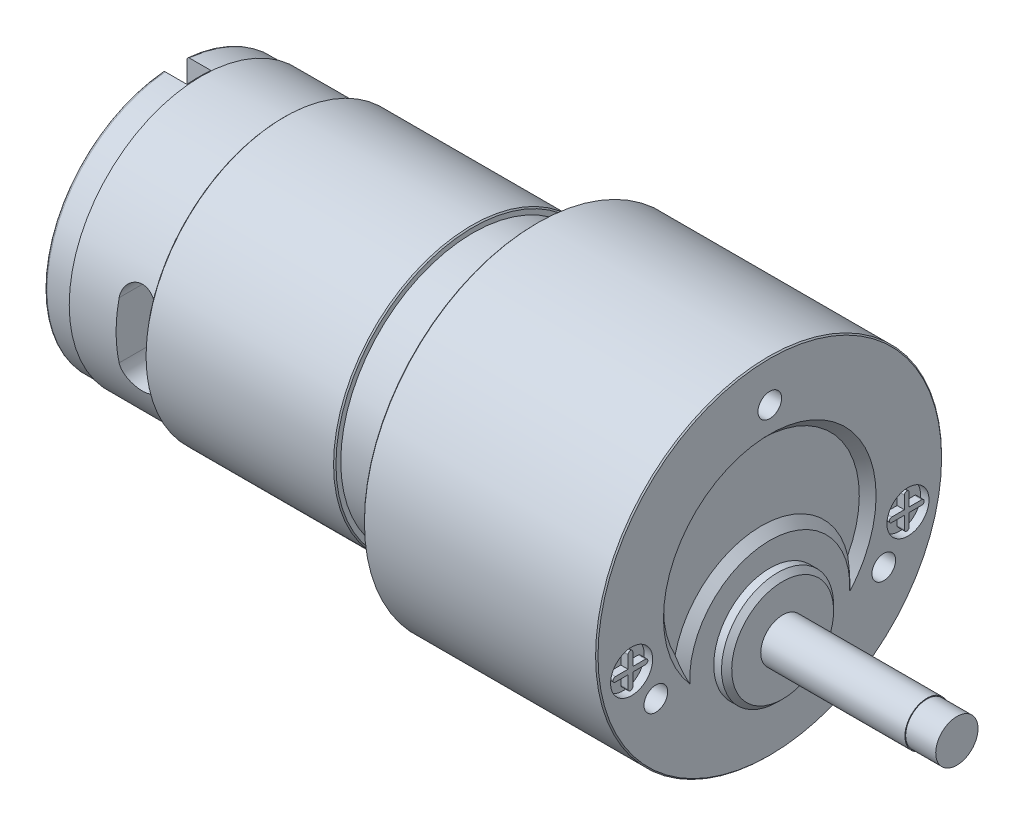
ISO-10303-21;
HEADER;
FILE_DESCRIPTION(('STEP AP214'),'2;1');
FILE_NAME('part.step','',(''),(''),'','','');
FILE_SCHEMA(('AUTOMOTIVE_DESIGN { 1 0 10303 214 1 1 1 1 }'));
ENDSEC;
DATA;
#1=APPLICATION_CONTEXT('core data for automotive mechanical design processes');
#2=APPLICATION_PROTOCOL_DEFINITION('international standard','automotive_design',2000,#1);
#3=PRODUCT_CONTEXT('',#1,'mechanical');
#4=PRODUCT('Part','Part','',(#3));
#5=PRODUCT_RELATED_PRODUCT_CATEGORY('part','',(#4));
#6=PRODUCT_DEFINITION_FORMATION('','',#4);
#7=PRODUCT_DEFINITION_CONTEXT('part definition',#1,'design');
#8=PRODUCT_DEFINITION('design','',#6,#7);
#9=PRODUCT_DEFINITION_SHAPE('','',#8);
#10=(LENGTH_UNIT() NAMED_UNIT(*) SI_UNIT(.MILLI.,.METRE.));
#11=(NAMED_UNIT(*) PLANE_ANGLE_UNIT() SI_UNIT($,.RADIAN.));
#12=(NAMED_UNIT(*) SI_UNIT($,.STERADIAN.) SOLID_ANGLE_UNIT());
#13=UNCERTAINTY_MEASURE_WITH_UNIT(LENGTH_MEASURE(1.E-05),#10,'distance_accuracy_value','');
#14=(GEOMETRIC_REPRESENTATION_CONTEXT(3) GLOBAL_UNCERTAINTY_ASSIGNED_CONTEXT((#13)) GLOBAL_UNIT_ASSIGNED_CONTEXT((#10,
#11,#12)) REPRESENTATION_CONTEXT('',''));
#15=CARTESIAN_POINT('',(0.,0.,0.));
#16=DIRECTION('',(0.,0.,1.));
#17=DIRECTION('',(1.,0.,0.));
#18=AXIS2_PLACEMENT_3D('',#15,#16,#17);
#19=CARTESIAN_POINT('',(1.905,0.,0.));
#20=DIRECTION('',(1.,0.,0.));
#21=DIRECTION('',(0.,0.,-1.));
#22=AXIS2_PLACEMENT_3D('',#19,#20,#21);
#23=TOROIDAL_SURFACE('',#22,13.5255,0.254);
#24=CARTESIAN_POINT('',(1.78362162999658,-13.6898392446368,-1.27));
#25=CARTESIAN_POINT('',(1.79610142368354,-13.6966566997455,-1.27));
#26=CARTESIAN_POINT('',(1.80916476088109,-13.7024271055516,-1.27));
#27=CARTESIAN_POINT('',(1.83608535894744,-13.7116979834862,-1.27));
#28=CARTESIAN_POINT('',(1.84994352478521,-13.7151958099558,-1.27));
#29=CARTESIAN_POINT('',(1.87804638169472,-13.7198119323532,-1.27));
#30=CARTESIAN_POINT('',(1.89229091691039,-13.7209311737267,-1.27));
#31=CARTESIAN_POINT('',(1.92076166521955,-13.7207592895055,-1.27));
#32=CARTESIAN_POINT('',(1.93498788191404,-13.7194687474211,-1.27));
#33=CARTESIAN_POINT('',(1.96300967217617,-13.7145184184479,-1.27));
#34=CARTESIAN_POINT('',(1.97680559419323,-13.7108606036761,-1.27));
#35=CARTESIAN_POINT('',(2.00358919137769,-13.7012835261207,-1.27));
#36=CARTESIAN_POINT('',(2.01657683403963,-13.6953641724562,-1.27));
#37=CARTESIAN_POINT('',(2.04139370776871,-13.6814259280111,-1.27));
#38=CARTESIAN_POINT('',(2.05322142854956,-13.6734043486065,-1.27));
#39=CARTESIAN_POINT('',(2.07536820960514,-13.6554957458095,-1.27));
#40=CARTESIAN_POINT('',(2.08568724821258,-13.6456086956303,-1.27));
#41=CARTESIAN_POINT('',(2.10456276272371,-13.6242137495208,-1.27));
#42=CARTESIAN_POINT('',(2.11311299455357,-13.6127003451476,-1.27));
#43=CARTESIAN_POINT('',(2.12816868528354,-13.5884064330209,-1.27));
#44=CARTESIAN_POINT('',(2.1346741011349,-13.5756258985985,-1.27));
#45=CARTESIAN_POINT('',(2.14548393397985,-13.5491029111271,-1.27));
#46=CARTESIAN_POINT('',(2.14977899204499,-13.5353566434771,-1.27));
#47=CARTESIAN_POINT('',(2.15600848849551,-13.5073391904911,-1.27));
#48=CARTESIAN_POINT('',(2.15794287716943,-13.4930679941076,-1.27));
#49=CARTESIAN_POINT('',(2.15940031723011,-13.464357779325,-1.27));
#50=CARTESIAN_POINT('',(2.15891575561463,-13.4499183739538,-1.27));
#51=CARTESIAN_POINT('',(2.15553126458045,-13.4213253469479,-1.27));
#52=CARTESIAN_POINT('',(2.15263131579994,-13.407171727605,-1.27));
#53=CARTESIAN_POINT('',(2.14449347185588,-13.3795424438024,-1.27));
#54=CARTESIAN_POINT('',(2.13925395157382,-13.3660672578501,-1.27));
#55=CARTESIAN_POINT('',(2.12658227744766,-13.3401904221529,-1.27));
#56=CARTESIAN_POINT('',(2.11915014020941,-13.3277887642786,-1.27));
#57=CARTESIAN_POINT('',(2.10231954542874,-13.3044408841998,-1.27));
#58=CARTESIAN_POINT('',(2.09292535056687,-13.2934915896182,-1.27));
#59=CARTESIAN_POINT('',(2.07242521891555,-13.2733336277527,-1.27));
#60=CARTESIAN_POINT('',(2.06131931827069,-13.2641249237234,-1.27));
#61=CARTESIAN_POINT('',(2.03775962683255,-13.2477504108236,-1.27));
#62=CARTESIAN_POINT('',(2.02531156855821,-13.2405763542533,-1.27));
#63=CARTESIAN_POINT('',(1.99938387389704,-13.2284302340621,-1.27));
#64=CARTESIAN_POINT('',(1.98590426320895,-13.2234581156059,-1.27));
#65=CARTESIAN_POINT('',(1.95835758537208,-13.2158780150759,-1.27));
#66=CARTESIAN_POINT('',(1.94429325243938,-13.2132600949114,-1.27));
#67=CARTESIAN_POINT('',(1.915924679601,-13.2104289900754,-1.27));
#68=CARTESIAN_POINT('',(1.90162044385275,-13.2102157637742,-1.27));
#69=CARTESIAN_POINT('',(1.87321481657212,-13.2121977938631,-1.27));
#70=CARTESIAN_POINT('',(1.85911301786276,-13.2143872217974,-1.27));
#71=CARTESIAN_POINT('',(1.83147691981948,-13.2211013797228,-1.27));
#72=CARTESIAN_POINT('',(1.81794261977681,-13.2256261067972,-1.27));
#73=CARTESIAN_POINT('',(1.79181703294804,-13.2368823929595,-1.27));
#74=CARTESIAN_POINT('',(1.77922623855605,-13.2436150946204,-1.27));
#75=CARTESIAN_POINT('',(1.75534889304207,-13.2590923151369,-1.27));
#76=CARTESIAN_POINT('',(1.7440623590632,-13.2678368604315,-1.27));
#77=CARTESIAN_POINT('',(1.7230742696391,-13.2871184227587,-1.27));
#78=CARTESIAN_POINT('',(1.71337790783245,-13.2976610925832,-1.27));
#79=CARTESIAN_POINT('',(1.69588336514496,-13.3202185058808,-1.27));
#80=CARTESIAN_POINT('',(1.68808523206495,-13.332233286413,-1.27));
#81=CARTESIAN_POINT('',(1.67457223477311,-13.3574506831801,-1.27));
#82=CARTESIAN_POINT('',(1.66886671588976,-13.3706583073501,-1.27));
#83=CARTESIAN_POINT('',(1.65974484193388,-13.3978417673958,-1.27));
#84=CARTESIAN_POINT('',(1.65632854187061,-13.4118176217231,-1.27));
#85=CARTESIAN_POINT('',(1.65187094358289,-13.4401956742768,-1.27));
#86=CARTESIAN_POINT('',(1.65083838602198,-13.4545992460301,-1.27));
#87=CARTESIAN_POINT('',(1.65120267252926,-13.4833751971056,-1.27));
#88=CARTESIAN_POINT('',(1.65259944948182,-13.4977475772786,-1.27));
#89=CARTESIAN_POINT('',(1.65778693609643,-13.5260712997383,-1.27));
#90=CARTESIAN_POINT('',(1.66158047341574,-13.5400221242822,-1.27));
#91=CARTESIAN_POINT('',(1.67146073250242,-13.5670910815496,-1.27));
#92=CARTESIAN_POINT('',(1.67754801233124,-13.5802090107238,-1.27));
#93=CARTESIAN_POINT('',(1.69183646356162,-13.6052175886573,-1.27));
#94=CARTESIAN_POINT('',(1.70003531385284,-13.6171095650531,-1.27));
#95=CARTESIAN_POINT('',(1.7183147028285,-13.6393303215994,-1.27));
#96=CARTESIAN_POINT('',(1.72839293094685,-13.6496609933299,-1.27));
#97=CARTESIAN_POINT('',(1.74608300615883,-13.6649607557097,-1.27));
#98=CARTESIAN_POINT('',(1.75321550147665,-13.6704937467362,-1.27));
#99=CARTESIAN_POINT('',(1.76802764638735,-13.6807712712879,-1.27));
#100=CARTESIAN_POINT('',(1.7757072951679,-13.6855158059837,-1.27));
#101=CARTESIAN_POINT('',(1.78362162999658,-13.6898392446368,-1.27));
#102=B_SPLINE_CURVE_WITH_KNOTS('',3,(#24,#25,#26,#27,#28,#29,#30,#31,#32,#33,#34,#35,#36,#37,
#38,#39,#40,#41,#42,#43,#44,#45,#46,#47,#48,#49,#50,#51,#52,#53,#54,#55,#56,#57,#58,#59,#60,#61,
#62,#63,#64,#65,#66,#67,#68,#69,#70,#71,#72,#73,#74,#75,#76,#77,#78,#79,#80,#81,#82,#83,#84,#85,
#86,#87,#88,#89,#90,#91,#92,#93,#94,#95,#96,#97,#98,#99,#100,#101),.UNSPECIFIED.,.T.,.F.,(4,2,2,
2,2,2,2,2,2,2,2,2,2,2,2,2,2,2,2,2,2,2,2,2,2,2,2,2,2,2,2,2,2,2,2,2,2,2,4),(0.,0.0426287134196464,
0.085306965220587,0.127968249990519,0.170619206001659,0.213234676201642,0.25585185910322,
0.298523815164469,0.341196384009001,0.384017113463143,0.426838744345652,0.469840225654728,
0.512842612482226,0.555980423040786,0.599118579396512,0.642286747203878,0.685454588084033,
0.728529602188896,0.771603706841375,0.81450062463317,0.857396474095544,0.900110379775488,
0.942823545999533,0.985433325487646,1.02804305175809,1.07067486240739,1.11330723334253,
1.15607618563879,1.19884621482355,1.24180498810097,1.28476479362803,1.32788187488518,
1.3709977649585,1.41416461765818,1.4573419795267,1.5004720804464,1.54354950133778,
1.57058347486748,1.59761740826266),.UNSPECIFIED.);
#103=CARTESIAN_POINT('',(1.651,-13.465743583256,-1.27));
#104=VERTEX_POINT('',#103);
#105=CARTESIAN_POINT('',(1.905,-13.7208498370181,-1.27));
#106=VERTEX_POINT('',#105);
#107=EDGE_CURVE('E46',#104,#106,#102,.T.);
#108=ORIENTED_EDGE('',*,*,#107,.F.);
#109=CARTESIAN_POINT('',(1.651,0.,0.));
#110=DIRECTION('',(1.,0.,0.));
#111=DIRECTION('',(0.,0.,-1.));
#112=AXIS2_PLACEMENT_3D('',#109,#110,#111);
#113=CIRCLE('',#112,13.5255);
#114=CARTESIAN_POINT('',(1.651,13.465743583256,-1.27));
#115=VERTEX_POINT('',#114);
#116=EDGE_CURVE('E835',#115,#104,#113,.F.);
#117=ORIENTED_EDGE('',*,*,#116,.F.);
#118=CARTESIAN_POINT('',(1.78656177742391,13.2400332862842,-1.27));
#119=CARTESIAN_POINT('',(1.7991255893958,13.2333811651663,-1.27));
#120=CARTESIAN_POINT('',(1.81225898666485,13.2277831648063,-1.27));
#121=CARTESIAN_POINT('',(1.83928980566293,13.2188665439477,-1.27));
#122=CARTESIAN_POINT('',(1.85318809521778,13.2155505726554,-1.27));
#123=CARTESIAN_POINT('',(1.88134012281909,13.2113023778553,-1.27));
#124=CARTESIAN_POINT('',(1.89559371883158,13.2103692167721,-1.27));
#125=CARTESIAN_POINT('',(1.92405117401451,13.2109121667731,-1.27));
#126=CARTESIAN_POINT('',(1.93825504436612,13.2123876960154,-1.27));
#127=CARTESIAN_POINT('',(1.96620113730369,13.2177012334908,-1.27));
#128=CARTESIAN_POINT('',(1.97994374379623,13.2215372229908,-1.27));
#129=CARTESIAN_POINT('',(2.00659185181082,13.2314586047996,-1.27));
#130=CARTESIAN_POINT('',(2.01949731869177,13.2375440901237,-1.27));
#131=CARTESIAN_POINT('',(2.04412686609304,13.2517996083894,-1.27));
#132=CARTESIAN_POINT('',(2.05584909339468,13.2599728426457,-1.27));
#133=CARTESIAN_POINT('',(2.07776167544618,13.2781642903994,-1.27));
#134=CARTESIAN_POINT('',(2.08795200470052,13.2881825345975,-1.27));
#135=CARTESIAN_POINT('',(2.10655398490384,13.3098202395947,-1.27));
#136=CARTESIAN_POINT('',(2.11495865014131,13.3214457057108,-1.27));
#137=CARTESIAN_POINT('',(2.12970693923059,13.3459376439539,-1.27));
#138=CARTESIAN_POINT('',(2.13605051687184,13.358804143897,-1.27));
#139=CARTESIAN_POINT('',(2.14652506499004,13.3854733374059,-1.27));
#140=CARTESIAN_POINT('',(2.15064624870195,13.3992798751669,-1.27));
#141=CARTESIAN_POINT('',(2.15651988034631,13.4273879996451,-1.27));
#142=CARTESIAN_POINT('',(2.15827228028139,13.4416895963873,-1.27));
#143=CARTESIAN_POINT('',(2.15936153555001,13.4704269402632,-1.27));
#144=CARTESIAN_POINT('',(2.15869124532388,13.4848629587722,-1.27));
#145=CARTESIAN_POINT('',(2.1549374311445,13.5134178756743,-1.27));
#146=CARTESIAN_POINT('',(2.15185389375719,13.5275367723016,-1.27));
#147=CARTESIAN_POINT('',(2.14335752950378,13.5550598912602,-1.27));
#148=CARTESIAN_POINT('',(2.1379440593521,13.5684639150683,-1.27));
#149=CARTESIAN_POINT('',(2.12493825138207,13.5941697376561,-1.27));
#150=CARTESIAN_POINT('',(2.117345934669,13.6064715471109,-1.27));
#151=CARTESIAN_POINT('',(2.10021641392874,13.6295903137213,-1.27));
#152=CARTESIAN_POINT('',(2.09068402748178,13.6404108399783,-1.27));
#153=CARTESIAN_POINT('',(2.06993128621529,13.6602898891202,-1.27));
#154=CARTESIAN_POINT('',(2.05871096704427,13.6693484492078,-1.27));
#155=CARTESIAN_POINT('',(2.03494951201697,13.6854070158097,-1.27));
#156=CARTESIAN_POINT('',(2.02241392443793,13.6924152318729,-1.27));
#157=CARTESIAN_POINT('',(1.99634069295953,13.7042181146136,-1.27));
#158=CARTESIAN_POINT('',(1.98280307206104,13.7090128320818,-1.27));
#159=CARTESIAN_POINT('',(1.95516686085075,13.716234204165,-1.27));
#160=CARTESIAN_POINT('',(1.94107066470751,13.7186700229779,-1.27));
#161=CARTESIAN_POINT('',(1.91266946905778,13.7211350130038,-1.27));
#162=CARTESIAN_POINT('',(1.89836447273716,13.7211642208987,-1.27));
#163=CARTESIAN_POINT('',(1.86998348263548,13.7188176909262,-1.27));
#164=CARTESIAN_POINT('',(1.85590707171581,13.7164469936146,-1.27));
#165=CARTESIAN_POINT('',(1.82835174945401,13.7093772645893,-1.27));
#166=CARTESIAN_POINT('',(1.8148728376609,13.7046782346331,-1.27));
#167=CARTESIAN_POINT('',(1.78888585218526,13.6930846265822,-1.27));
#168=CARTESIAN_POINT('',(1.77637833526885,13.6861888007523,-1.27));
#169=CARTESIAN_POINT('',(1.75269399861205,13.6704011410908,-1.27));
#170=CARTESIAN_POINT('',(1.74151719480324,13.6615092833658,-1.27));
#171=CARTESIAN_POINT('',(1.72077487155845,13.6419545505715,-1.27));
#172=CARTESIAN_POINT('',(1.71121426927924,13.6312864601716,-1.27));
#173=CARTESIAN_POINT('',(1.69401082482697,13.6085023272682,-1.27));
#174=CARTESIAN_POINT('',(1.68636802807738,13.596386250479,-1.27));
#175=CARTESIAN_POINT('',(1.6731833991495,13.5709959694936,-1.27));
#176=CARTESIAN_POINT('',(1.6676504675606,13.5577171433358,-1.27));
#177=CARTESIAN_POINT('',(1.65888335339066,13.5304211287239,-1.27));
#178=CARTESIAN_POINT('',(1.6556492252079,13.5164039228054,-1.27));
#179=CARTESIAN_POINT('',(1.65156099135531,13.4879746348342,-1.27));
#180=CARTESIAN_POINT('',(1.65071555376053,13.473561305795,-1.27));
#181=CARTESIAN_POINT('',(1.65145262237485,13.4447973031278,-1.27));
#182=CARTESIAN_POINT('',(1.65303506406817,13.4304466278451,-1.27));
#183=CARTESIAN_POINT('',(1.65858763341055,13.402194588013,-1.27));
#184=CARTESIAN_POINT('',(1.66256098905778,13.3882938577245,-1.27));
#185=CARTESIAN_POINT('',(1.67278955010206,13.3613544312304,-1.27));
#186=CARTESIAN_POINT('',(1.67904531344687,13.3483159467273,-1.27));
#187=CARTESIAN_POINT('',(1.69365560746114,13.3234910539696,-1.27));
#188=CARTESIAN_POINT('',(1.70200818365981,13.3117034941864,-1.27));
#189=CARTESIAN_POINT('',(1.72057516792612,13.2897159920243,-1.27));
#190=CARTESIAN_POINT('',(1.7307872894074,13.2795141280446,-1.27));
#191=CARTESIAN_POINT('',(1.74867934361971,13.264438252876,-1.27));
#192=CARTESIAN_POINT('',(1.75588735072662,13.2589943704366,-1.27));
#193=CARTESIAN_POINT('',(1.770840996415,13.2489031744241,-1.27));
#194=CARTESIAN_POINT('',(1.77858663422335,13.2442558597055,-1.27));
#195=CARTESIAN_POINT('',(1.78656177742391,13.2400332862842,-1.27));
#196=B_SPLINE_CURVE_WITH_KNOTS('',3,(#118,#119,#120,#121,#122,#123,#124,#125,#126,#127,#128,
#129,#130,#131,#132,#133,#134,#135,#136,#137,#138,#139,#140,#141,#142,#143,#144,#145,#146,#147,
#148,#149,#150,#151,#152,#153,#154,#155,#156,#157,#158,#159,#160,#161,#162,#163,#164,#165,#166,
#167,#168,#169,#170,#171,#172,#173,#174,#175,#176,#177,#178,#179,#180,#181,#182,#183,#184,#185,
#186,#187,#188,#189,#190,#191,#192,#193,#194,#195),.UNSPECIFIED.,.T.,.F.,(4,2,2,2,2,2,2,2,2,2,2,
2,2,2,2,2,2,2,2,2,2,2,2,2,2,2,2,2,2,2,2,2,2,2,2,2,2,2,4),(0.,0.0426157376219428,
0.0852808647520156,0.127929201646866,0.170567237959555,0.213168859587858,0.255772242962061,
0.298441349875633,0.341111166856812,0.383944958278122,0.426779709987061,0.469801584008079,
0.512824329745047,0.555974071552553,0.599124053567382,0.642285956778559,0.685447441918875,
0.728503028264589,0.771557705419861,0.814437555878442,0.857316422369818,0.900028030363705,
0.94273898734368,0.985360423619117,1.02798182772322,1.07062748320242,1.11327364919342,
1.15604731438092,1.19882199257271,1.24177517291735,1.28472936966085,1.3278392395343,
1.37094796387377,1.41411502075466,1.45729263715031,1.50043015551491,1.54351498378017,
1.57056625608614,1.59761748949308),.UNSPECIFIED.);
#197=CARTESIAN_POINT('',(1.905,13.7208498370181,-1.27));
#198=VERTEX_POINT('',#197);
#199=EDGE_CURVE('E910',#198,#115,#196,.T.);
#200=ORIENTED_EDGE('',*,*,#199,.F.);
#201=CARTESIAN_POINT('',(1.905,0.,0.));
#202=DIRECTION('',(1.,0.,0.));
#203=DIRECTION('',(0.,0.,-1.));
#204=AXIS2_PLACEMENT_3D('',#201,#202,#203);
#205=CIRCLE('',#204,13.7795);
#206=EDGE_CURVE('E61',#106,#198,#205,.T.);
#207=ORIENTED_EDGE('',*,*,#206,.F.);
#208=EDGE_LOOP('',(#108,#117,#200,#207));
#209=FACE_BOUND('',#208,.T.);
#210=ADVANCED_FACE('F38',(#209),#23,.T.);
#211=CARTESIAN_POINT('',(13.081,13.97,0.));
#212=DIRECTION('',(1.,0.,0.));
#213=DIRECTION('',(0.,0.,-1.));
#214=AXIS2_PLACEMENT_3D('',#211,#212,#213);
#215=PLANE('',#214);
#216=CARTESIAN_POINT('',(13.081,0.,0.));
#217=DIRECTION('',(1.,0.,0.));
#218=DIRECTION('',(0.,0.,-1.));
#219=AXIS2_PLACEMENT_3D('',#216,#217,#218);
#220=CIRCLE('',#219,14.478);
#221=CARTESIAN_POINT('',(13.081,-3.66841593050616,-14.0055420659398));
#222=VERTEX_POINT('',#221);
#223=CARTESIAN_POINT('',(13.081,-3.66841593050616,14.0055420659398));
#224=VERTEX_POINT('',#223);
#225=EDGE_CURVE('E883',#222,#224,#220,.F.);
#226=ORIENTED_EDGE('',*,*,#225,.T.);
#227=DIRECTION('',(0.,0.,1.));
#228=VECTOR('',#227,1.);
#229=CARTESIAN_POINT('',(13.081,-3.66841593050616,-18.288));
#230=LINE('',#229,#228);
#231=CARTESIAN_POINT('',(13.081,-3.66841593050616,13.4797486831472));
#232=VERTEX_POINT('',#231);
#233=EDGE_CURVE('E490',#224,#232,#230,.F.);
#234=ORIENTED_EDGE('',*,*,#233,.T.);
#235=CARTESIAN_POINT('',(13.081,0.,0.));
#236=DIRECTION('',(-1.,0.,0.));
#237=DIRECTION('',(0.,0.,1.));
#238=AXIS2_PLACEMENT_3D('',#235,#236,#237);
#239=CIRCLE('',#238,13.97);
#240=CARTESIAN_POINT('',(13.081,-3.66841593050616,-13.4797486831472));
#241=VERTEX_POINT('',#240);
#242=EDGE_CURVE('E750',#241,#232,#239,.T.);
#243=ORIENTED_EDGE('',*,*,#242,.F.);
#244=EDGE_CURVE('E489',#241,#222,#230,.F.);
#245=ORIENTED_EDGE('',*,*,#244,.T.);
#246=EDGE_LOOP('',(#226,#234,#243,#245));
#247=FACE_BOUND('',#246,.T.);
#248=ADVANCED_FACE('F795',(#247),#215,.F.);
#249=CARTESIAN_POINT('',(13.081,0.,0.));
#250=DIRECTION('',(1.,0.,0.));
#251=DIRECTION('',(0.,0.,-1.));
#252=AXIS2_PLACEMENT_3D('',#249,#250,#251);
#253=CONICAL_SURFACE('',#252,14.478,0.785398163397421);
#254=CARTESIAN_POINT('',(13.1984309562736,-2.7938,-14.3255466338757));
#255=CARTESIAN_POINT('',(13.2027474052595,-2.83658323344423,-14.3216032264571));
#256=CARTESIAN_POINT('',(13.205574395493,-2.87933909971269,-14.3159513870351));
#257=CARTESIAN_POINT('',(13.2083640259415,-2.96434124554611,-14.3014396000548));
#258=CARTESIAN_POINT('',(13.2083305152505,-3.00658813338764,-14.2925839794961));
#259=CARTESIAN_POINT('',(13.2055620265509,-3.08912186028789,-14.2721373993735));
#260=CARTESIAN_POINT('',(13.2028989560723,-3.12943094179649,-14.2606254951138));
#261=CARTESIAN_POINT('',(13.1951507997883,-3.20897215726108,-14.2349954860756));
#262=CARTESIAN_POINT('',(13.1900652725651,-3.24820409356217,-14.2208769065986));
#263=CARTESIAN_POINT('',(13.1720627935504,-3.36020269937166,-14.1764841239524));
#264=CARTESIAN_POINT('',(13.1562200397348,-3.43128354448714,-14.1431282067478));
#265=CARTESIAN_POINT('',(13.1173301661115,-3.56979219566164,-14.0687030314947));
#266=CARTESIAN_POINT('',(13.0941040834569,-3.63707424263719,-14.0274535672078));
#267=CARTESIAN_POINT('',(13.0681,-3.70105215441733,-13.9836093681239));
#268=B_SPLINE_CURVE_WITH_KNOTS('',3,(#254,#255,#256,#257,#258,#259,#260,#261,#262,#263,#264,
#265,#266,#267),.UNSPECIFIED.,.F.,.F.,(4,2,2,2,2,2,4),(0.,0.129455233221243,0.258736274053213,
0.384577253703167,0.510441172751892,0.749884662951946,0.995642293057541),.UNSPECIFIED.);
#269=CARTESIAN_POINT('',(13.208,-2.9845,-14.2968102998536));
#270=VERTEX_POINT('',#269);
#271=EDGE_CURVE('E466',#270,#222,#268,.T.);
#272=ORIENTED_EDGE('',*,*,#271,.F.);
#273=CARTESIAN_POINT('',(13.208,0.,0.));
#274=DIRECTION('',(1.,0.,0.));
#275=DIRECTION('',(0.,0.,-1.));
#276=AXIS2_PLACEMENT_3D('',#273,#274,#275);
#277=CIRCLE('',#276,14.605);
#278=CARTESIAN_POINT('',(13.208,-2.9845,14.2968102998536));
#279=VERTEX_POINT('',#278);
#280=EDGE_CURVE('E871',#279,#270,#277,.T.);
#281=ORIENTED_EDGE('',*,*,#280,.F.);
#282=CARTESIAN_POINT('',(13.0681,-3.70105215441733,13.9836093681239));
#283=CARTESIAN_POINT('',(13.095661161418,-3.63327644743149,14.0300736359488));
#284=CARTESIAN_POINT('',(13.1201046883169,-3.56173447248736,14.0736357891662));
#285=CARTESIAN_POINT('',(13.160403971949,-3.41428726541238,14.1515690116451));
#286=CARTESIAN_POINT('',(13.1764768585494,-3.33855549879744,14.1861593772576));
#287=CARTESIAN_POINT('',(13.1933022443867,-3.22358859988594,14.2297900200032));
#288=CARTESIAN_POINT('',(13.1976583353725,-3.18631726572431,14.2426467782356));
#289=CARTESIAN_POINT('',(13.2041820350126,-3.11085324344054,14.265996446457));
#290=CARTESIAN_POINT('',(13.206350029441,-3.07266071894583,14.2764897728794));
#291=CARTESIAN_POINT('',(13.2083830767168,-2.9945889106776,14.2951495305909));
#292=CARTESIAN_POINT('',(13.2081865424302,-2.95469162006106,14.303248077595));
#293=CARTESIAN_POINT('',(13.2052463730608,-2.87447054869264,14.3165878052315));
#294=CARTESIAN_POINT('',(13.2024998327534,-2.83414633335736,14.3218257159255));
#295=CARTESIAN_POINT('',(13.1984309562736,-2.7938,14.3255466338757));
#296=B_SPLINE_CURVE_WITH_KNOTS('',3,(#282,#283,#284,#285,#286,#287,#288,#289,#290,#291,#292,
#293,#294,#295),.UNSPECIFIED.,.F.,.F.,(4,2,2,2,2,2,4),(0.,0.260481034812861,0.51381855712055,
0.632690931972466,0.751542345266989,0.873495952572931,0.995588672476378),.UNSPECIFIED.);
#297=EDGE_CURVE('E447',#224,#279,#296,.T.);
#298=ORIENTED_EDGE('',*,*,#297,.F.);
#299=ORIENTED_EDGE('',*,*,#225,.F.);
#300=EDGE_LOOP('',(#272,#281,#298,#299));
#301=FACE_BOUND('',#300,.T.);
#302=ADVANCED_FACE('F460',(#301),#253,.T.);
#303=CARTESIAN_POINT('',(63.6397,-3.175,14.605));
#304=DIRECTION('',(-1.,0.,0.));
#305=DIRECTION('',(0.,0.,1.));
#306=AXIS2_PLACEMENT_3D('',#303,#304,#305);
#307=PLANE('',#306);
#308=CARTESIAN_POINT('',(63.6397,-3.175,14.605));
#309=DIRECTION('',(1.,0.,0.));
#310=DIRECTION('',(0.,0.,1.));
#311=AXIS2_PLACEMENT_3D('',#308,#309,#310);
#312=CIRCLE('',#311,2.2225);
#313=CARTESIAN_POINT('',(63.6397,-3.175,16.8275));
#314=VERTEX_POINT('',#313);
#315=EDGE_CURVE('E686',#314,#314,#312,.T.);
#316=ORIENTED_EDGE('',*,*,#315,.T.);
#317=EDGE_LOOP('',(#316));
#318=FACE_BOUND('',#317,.T.);
#319=DIRECTION('',(0.,0.,-1.));
#320=VECTOR('',#319,1.);
#321=CARTESIAN_POINT('',(63.6397,-2.921,0.));
#322=LINE('',#321,#320);
#323=CARTESIAN_POINT('',(63.6397,-2.921,16.1925));
#324=VERTEX_POINT('',#323);
#325=CARTESIAN_POINT('',(63.6397,-2.921,14.859));
#326=VERTEX_POINT('',#325);
#327=EDGE_CURVE('E621',#324,#326,#322,.T.);
#328=ORIENTED_EDGE('',*,*,#327,.T.);
#329=DIRECTION('',(0.,1.,0.));
#330=VECTOR('',#329,1.);
#331=CARTESIAN_POINT('',(63.6397,0.,14.859));
#332=LINE('',#331,#330);
#333=CARTESIAN_POINT('',(63.6397,-1.5875,14.859));
#334=VERTEX_POINT('',#333);
#335=EDGE_CURVE('E589',#326,#334,#332,.T.);
#336=ORIENTED_EDGE('',*,*,#335,.T.);
#337=CARTESIAN_POINT('',(63.6397,-1.5875,14.605));
#338=DIRECTION('',(1.,0.,0.));
#339=DIRECTION('',(0.,0.,-1.));
#340=AXIS2_PLACEMENT_3D('',#337,#338,#339);
#341=CIRCLE('',#340,0.254000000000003);
#342=CARTESIAN_POINT('',(63.6397,-1.5875,14.351));
#343=VERTEX_POINT('',#342);
#344=EDGE_CURVE('E594',#343,#334,#341,.T.);
#345=ORIENTED_EDGE('',*,*,#344,.F.);
#346=DIRECTION('',(0.,1.,0.));
#347=VECTOR('',#346,1.);
#348=CARTESIAN_POINT('',(63.6397,0.,14.351));
#349=LINE('',#348,#347);
#350=CARTESIAN_POINT('',(63.6397,-2.921,14.351));
#351=VERTEX_POINT('',#350);
#352=EDGE_CURVE('E645',#351,#343,#349,.T.);
#353=ORIENTED_EDGE('',*,*,#352,.F.);
#354=DIRECTION('',(0.,0.,-1.));
#355=VECTOR('',#354,1.);
#356=CARTESIAN_POINT('',(63.6397,-2.921,0.));
#357=LINE('',#356,#355);
#358=CARTESIAN_POINT('',(63.6397,-2.921,13.0175));
#359=VERTEX_POINT('',#358);
#360=EDGE_CURVE('E643',#351,#359,#357,.T.);
#361=ORIENTED_EDGE('',*,*,#360,.T.);
#362=CARTESIAN_POINT('',(63.6397,-3.175,13.0175));
#363=DIRECTION('',(1.,0.,0.));
#364=DIRECTION('',(0.,0.,-1.));
#365=AXIS2_PLACEMENT_3D('',#362,#363,#364);
#366=CIRCLE('',#365,0.254);
#367=CARTESIAN_POINT('',(63.6397,-3.429,13.0175));
#368=VERTEX_POINT('',#367);
#369=EDGE_CURVE('E640',#368,#359,#366,.T.);
#370=ORIENTED_EDGE('',*,*,#369,.F.);
#371=DIRECTION('',(0.,0.,-1.));
#372=VECTOR('',#371,1.);
#373=CARTESIAN_POINT('',(63.6397,-3.429,0.));
#374=LINE('',#373,#372);
#375=CARTESIAN_POINT('',(63.6397,-3.429,14.351));
#376=VERTEX_POINT('',#375);
#377=EDGE_CURVE('E637',#376,#368,#374,.T.);
#378=ORIENTED_EDGE('',*,*,#377,.F.);
#379=DIRECTION('',(0.,1.,0.));
#380=VECTOR('',#379,1.);
#381=CARTESIAN_POINT('',(63.6397,0.,14.351));
#382=LINE('',#381,#380);
#383=CARTESIAN_POINT('',(63.6397,-4.7625,14.351));
#384=VERTEX_POINT('',#383);
#385=EDGE_CURVE('E634',#384,#376,#382,.T.);
#386=ORIENTED_EDGE('',*,*,#385,.F.);
#387=CARTESIAN_POINT('',(63.6397,-4.7625,14.605));
#388=DIRECTION('',(1.,0.,0.));
#389=DIRECTION('',(0.,0.,-1.));
#390=AXIS2_PLACEMENT_3D('',#387,#388,#389);
#391=CIRCLE('',#390,0.254000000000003);
#392=CARTESIAN_POINT('',(63.6397,-4.7625,14.859));
#393=VERTEX_POINT('',#392);
#394=EDGE_CURVE('E631',#393,#384,#391,.T.);
#395=ORIENTED_EDGE('',*,*,#394,.F.);
#396=DIRECTION('',(0.,1.,0.));
#397=VECTOR('',#396,1.);
#398=CARTESIAN_POINT('',(63.6397,0.,14.859));
#399=LINE('',#398,#397);
#400=CARTESIAN_POINT('',(63.6397,-3.429,14.859));
#401=VERTEX_POINT('',#400);
#402=EDGE_CURVE('E629',#393,#401,#399,.T.);
#403=ORIENTED_EDGE('',*,*,#402,.T.);
#404=DIRECTION('',(0.,0.,-1.));
#405=VECTOR('',#404,1.);
#406=CARTESIAN_POINT('',(63.6397,-3.429,0.));
#407=LINE('',#406,#405);
#408=CARTESIAN_POINT('',(63.6397,-3.429,16.1925));
#409=VERTEX_POINT('',#408);
#410=EDGE_CURVE('E626',#409,#401,#407,.T.);
#411=ORIENTED_EDGE('',*,*,#410,.F.);
#412=CARTESIAN_POINT('',(63.6397,-3.175,16.1925));
#413=DIRECTION('',(1.,0.,0.));
#414=DIRECTION('',(0.,0.,-1.));
#415=AXIS2_PLACEMENT_3D('',#412,#413,#414);
#416=CIRCLE('',#415,0.254);
#417=EDGE_CURVE('E623',#324,#409,#416,.T.);
#418=ORIENTED_EDGE('',*,*,#417,.F.);
#419=EDGE_LOOP('',(#328,#336,#345,#353,#361,#370,#378,#386,#395,#403,#411,#418));
#420=FACE_BOUND('',#419,.T.);
#421=ADVANCED_FACE('F1131',(#318,#420),#307,.F.);
#422=CARTESIAN_POINT('',(64.5287,18.288,0.));
#423=DIRECTION('',(-1.,0.,0.));
#424=DIRECTION('',(0.,0.,1.));
#425=AXIS2_PLACEMENT_3D('',#422,#423,#424);
#426=PLANE('',#425);
#427=CARTESIAN_POINT('',(64.5287,0.,0.));
#428=DIRECTION('',(-1.,0.,0.));
#429=DIRECTION('',(0.,0.,1.));
#430=AXIS2_PLACEMENT_3D('',#427,#428,#429);
#431=CIRCLE('',#430,18.161);
#432=CARTESIAN_POINT('',(64.5287,0.,18.161));
#433=VERTEX_POINT('',#432);
#434=EDGE_CURVE('E895',#433,#433,#431,.F.);
#435=ORIENTED_EDGE('',*,*,#434,.T.);
#436=EDGE_LOOP('',(#435));
#437=FACE_BOUND('',#436,.T.);
#438=CARTESIAN_POINT('',(64.5287,-3.175,14.605));
#439=DIRECTION('',(1.,0.,0.));
#440=DIRECTION('',(0.,0.,1.));
#441=AXIS2_PLACEMENT_3D('',#438,#439,#440);
#442=CIRCLE('',#441,2.2225);
#443=CARTESIAN_POINT('',(64.5287,-3.175,16.8275));
#444=VERTEX_POINT('',#443);
#445=EDGE_CURVE('E685',#444,#444,#442,.T.);
#446=ORIENTED_EDGE('',*,*,#445,.F.);
#447=EDGE_LOOP('',(#446));
#448=FACE_BOUND('',#447,.T.);
#449=CARTESIAN_POINT('',(64.5287,-3.175,-14.605));
#450=DIRECTION('',(1.,0.,0.));
#451=DIRECTION('',(0.,0.,-1.));
#452=AXIS2_PLACEMENT_3D('',#449,#450,#451);
#453=CIRCLE('',#452,2.22249999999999);
#454=CARTESIAN_POINT('',(64.5287,-3.175,-16.8275));
#455=VERTEX_POINT('',#454);
#456=EDGE_CURVE('E689',#455,#455,#453,.T.);
#457=ORIENTED_EDGE('',*,*,#456,.F.);
#458=EDGE_LOOP('',(#457));
#459=FACE_BOUND('',#458,.T.);
#460=CARTESIAN_POINT('',(64.5287,-6.95430752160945,12.04595));
#461=DIRECTION('',(1.,0.,0.));
#462=DIRECTION('',(0.,0.,-1.));
#463=AXIS2_PLACEMENT_3D('',#460,#461,#462);
#464=CIRCLE('',#463,1.25);
#465=CARTESIAN_POINT('',(64.5287,-6.95430752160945,10.79595));
#466=VERTEX_POINT('',#465);
#467=EDGE_CURVE('E695',#466,#466,#464,.T.);
#468=ORIENTED_EDGE('',*,*,#467,.F.);
#469=EDGE_LOOP('',(#468));
#470=FACE_BOUND('',#469,.T.);
#471=CARTESIAN_POINT('',(64.5287,13.9092524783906,0.));
#472=DIRECTION('',(1.,0.,0.));
#473=DIRECTION('',(0.,0.,-1.));
#474=AXIS2_PLACEMENT_3D('',#471,#472,#473);
#475=CIRCLE('',#474,1.25);
#476=CARTESIAN_POINT('',(64.5287,13.9092524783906,-1.25));
#477=VERTEX_POINT('',#476);
#478=EDGE_CURVE('E703',#477,#477,#475,.T.);
#479=ORIENTED_EDGE('',*,*,#478,.F.);
#480=EDGE_LOOP('',(#479));
#481=FACE_BOUND('',#480,.T.);
#482=CARTESIAN_POINT('',(64.5287,-6.95430752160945,-12.04595));
#483=DIRECTION('',(1.,0.,0.));
#484=DIRECTION('',(0.,0.,-1.));
#485=AXIS2_PLACEMENT_3D('',#482,#483,#484);
#486=CIRCLE('',#485,1.25);
#487=CARTESIAN_POINT('',(64.5287,-6.95430752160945,-13.29595));
#488=VERTEX_POINT('',#487);
#489=EDGE_CURVE('E709',#488,#488,#486,.T.);
#490=ORIENTED_EDGE('',*,*,#489,.F.);
#491=EDGE_LOOP('',(#490));
#492=FACE_BOUND('',#491,.T.);
#493=CARTESIAN_POINT('',(64.5287,-6.95452,0.));
#494=DIRECTION('',(-1.,0.,0.));
#495=DIRECTION('',(0.,-1.,0.));
#496=AXIS2_PLACEMENT_3D('',#493,#494,#495);
#497=CIRCLE('',#496,5.92455);
#498=CARTESIAN_POINT('',(64.5287,-12.87907,0.));
#499=VERTEX_POINT('',#498);
#500=EDGE_CURVE('E723',#499,#499,#497,.T.);
#501=ORIENTED_EDGE('',*,*,#500,.T.);
#502=EDGE_LOOP('',(#501));
#503=FACE_BOUND('',#502,.T.);
#504=CARTESIAN_POINT('',(64.5287,-6.95452,0.));
#505=DIRECTION('',(1.,0.,0.));
#506=DIRECTION('',(0.,0.,-1.));
#507=AXIS2_PLACEMENT_3D('',#504,#505,#506);
#508=CIRCLE('',#507,8.46455);
#509=CARTESIAN_POINT('',(64.5287,-7.40562403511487,-8.452521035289));
#510=VERTEX_POINT('',#509);
#511=CARTESIAN_POINT('',(64.5287,-7.40562403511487,8.452521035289));
#512=VERTEX_POINT('',#511);
#513=EDGE_CURVE('E716',#510,#512,#508,.T.);
#514=ORIENTED_EDGE('',*,*,#513,.T.);
#515=CARTESIAN_POINT('',(64.5287,0.,0.));
#516=DIRECTION('',(1.,0.,0.));
#517=DIRECTION('',(0.,0.,-1.));
#518=AXIS2_PLACEMENT_3D('',#515,#516,#517);
#519=CIRCLE('',#518,11.237810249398);
#520=EDGE_CURVE('E719',#510,#512,#519,.T.);
#521=ORIENTED_EDGE('',*,*,#520,.F.);
#522=EDGE_LOOP('',(#514,#521));
#523=FACE_BOUND('',#522,.T.);
#524=ADVANCED_FACE('F1212',(#437,#448,#459,#470,#481,#492,#503,#523),#426,.F.);
#525=CARTESIAN_POINT('',(0.,0.,0.));
#526=DIRECTION('',(1.,0.,0.));
#527=DIRECTION('',(0.,0.,-1.));
#528=AXIS2_PLACEMENT_3D('',#525,#526,#527);
#529=PLANE('',#528);
#530=CARTESIAN_POINT('',(0.,0.,0.));
#531=DIRECTION('',(1.,0.,0.));
#532=DIRECTION('',(0.,0.,-1.));
#533=AXIS2_PLACEMENT_3D('',#530,#531,#532);
#534=CIRCLE('',#533,0.889);
#535=CARTESIAN_POINT('',(0.,0.,-0.889));
#536=VERTEX_POINT('',#535);
#537=EDGE_CURVE('E847',#536,#536,#534,.F.);
#538=ORIENTED_EDGE('',*,*,#537,.T.);
#539=EDGE_LOOP('',(#538));
#540=FACE_BOUND('',#539,.T.);
#541=ADVANCED_FACE('F1202',(#540),#529,.F.);
#542=CARTESIAN_POINT('',(0.,0.,0.));
#543=DIRECTION('',(-1.,0.,0.));
#544=DIRECTION('',(0.,0.,1.));
#545=AXIS2_PLACEMENT_3D('',#542,#543,#544);
#546=CYLINDRICAL_SURFACE('',#545,1.143);
#547=CARTESIAN_POINT('',(0.381,0.,0.));
#548=DIRECTION('',(1.,0.,0.));
#549=DIRECTION('',(0.,0.,-1.));
#550=AXIS2_PLACEMENT_3D('',#547,#548,#549);
#551=CIRCLE('',#550,1.143);
#552=CARTESIAN_POINT('',(0.381,0.,-1.143));
#553=VERTEX_POINT('',#552);
#554=EDGE_CURVE('E833',#553,#553,#551,.F.);
#555=ORIENTED_EDGE('',*,*,#554,.T.);
#556=EDGE_LOOP('',(#555));
#557=FACE_BOUND('',#556,.T.);
#558=CARTESIAN_POINT('',(0.254,0.,0.));
#559=DIRECTION('',(1.,0.,0.));
#560=DIRECTION('',(0.,0.,-1.));
#561=AXIS2_PLACEMENT_3D('',#558,#559,#560);
#562=CIRCLE('',#561,1.143);
#563=CARTESIAN_POINT('',(0.254,0.,-1.143));
#564=VERTEX_POINT('',#563);
#565=EDGE_CURVE('E830',#564,#564,#562,.T.);
#566=ORIENTED_EDGE('',*,*,#565,.T.);
#567=EDGE_LOOP('',(#566));
#568=FACE_BOUND('',#567,.T.);
#569=ADVANCED_FACE('F1191',(#557,#568),#546,.T.);
#570=CARTESIAN_POINT('',(0.635,1.143,0.));
#571=DIRECTION('',(1.,0.,0.));
#572=DIRECTION('',(0.,0.,-1.));
#573=AXIS2_PLACEMENT_3D('',#570,#571,#572);
#574=PLANE('',#573);
#575=CARTESIAN_POINT('',(0.635,0.,0.));
#576=DIRECTION('',(1.,0.,0.));
#577=DIRECTION('',(0.,0.,-1.));
#578=AXIS2_PLACEMENT_3D('',#575,#576,#577);
#579=CIRCLE('',#578,1.397);
#580=CARTESIAN_POINT('',(0.635,0.,-1.397));
#581=VERTEX_POINT('',#580);
#582=EDGE_CURVE('E844',#581,#581,#579,.T.);
#583=ORIENTED_EDGE('',*,*,#582,.T.);
#584=EDGE_LOOP('',(#583));
#585=FACE_BOUND('',#584,.T.);
#586=CARTESIAN_POINT('',(0.635,0.,0.));
#587=DIRECTION('',(1.,0.,0.));
#588=DIRECTION('',(0.,0.,-1.));
#589=AXIS2_PLACEMENT_3D('',#586,#587,#588);
#590=CIRCLE('',#589,4.7625);
#591=CARTESIAN_POINT('',(0.635,0.,-4.7625));
#592=VERTEX_POINT('',#591);
#593=EDGE_CURVE('E841',#592,#592,#590,.F.);
#594=ORIENTED_EDGE('',*,*,#593,.T.);
#595=EDGE_LOOP('',(#594));
#596=FACE_BOUND('',#595,.T.);
#597=ADVANCED_FACE('F1181',(#585,#596),#574,.F.);
#598=CARTESIAN_POINT('',(0.,0.,0.));
#599=DIRECTION('',(-1.,0.,0.));
#600=DIRECTION('',(0.,0.,1.));
#601=AXIS2_PLACEMENT_3D('',#598,#599,#600);
#602=CYLINDRICAL_SURFACE('',#601,5.0165);
#603=CARTESIAN_POINT('',(0.889,0.,0.));
#604=DIRECTION('',(1.,0.,0.));
#605=DIRECTION('',(0.,0.,-1.));
#606=AXIS2_PLACEMENT_3D('',#603,#604,#605);
#607=CIRCLE('',#606,5.0165);
#608=CARTESIAN_POINT('',(0.889,0.,-5.0165));
#609=VERTEX_POINT('',#608);
#610=EDGE_CURVE('E852',#609,#609,#607,.T.);
#611=ORIENTED_EDGE('',*,*,#610,.T.);
#612=EDGE_LOOP('',(#611));
#613=FACE_BOUND('',#612,.T.);
#614=CARTESIAN_POINT('',(1.397,0.,0.));
#615=DIRECTION('',(1.,0.,0.));
#616=DIRECTION('',(0.,0.,-1.));
#617=AXIS2_PLACEMENT_3D('',#614,#615,#616);
#618=CIRCLE('',#617,5.0165);
#619=CARTESIAN_POINT('',(1.397,0.,-5.0165));
#620=VERTEX_POINT('',#619);
#621=EDGE_CURVE('E850',#620,#620,#618,.F.);
#622=ORIENTED_EDGE('',*,*,#621,.T.);
#623=EDGE_LOOP('',(#622));
#624=FACE_BOUND('',#623,.T.);
#625=ADVANCED_FACE('F1048',(#613,#624),#602,.T.);
#626=CARTESIAN_POINT('',(1.651,5.0165,0.));
#627=DIRECTION('',(1.,0.,0.));
#628=DIRECTION('',(0.,0.,-1.));
#629=AXIS2_PLACEMENT_3D('',#626,#627,#628);
#630=PLANE('',#629);
#631=ORIENTED_EDGE('',*,*,#116,.T.);
#632=DIRECTION('',(0.,-1.,0.));
#633=VECTOR('',#632,1.);
#634=CARTESIAN_POINT('',(1.651,-11.2395,-1.27));
#635=LINE('',#634,#633);
#636=CARTESIAN_POINT('',(1.651,-11.2395,-1.27));
#637=VERTEX_POINT('',#636);
#638=EDGE_CURVE('E353',#637,#104,#635,.T.);
#639=ORIENTED_EDGE('',*,*,#638,.F.);
#640=DIRECTION('',(0.,0.,-1.));
#641=VECTOR('',#640,1.);
#642=CARTESIAN_POINT('',(1.651,-11.2395,-1.27));
#643=LINE('',#642,#641);
#644=CARTESIAN_POINT('',(1.651,-11.2395,1.27));
#645=VERTEX_POINT('',#644);
#646=EDGE_CURVE('E356',#645,#637,#643,.T.);
#647=ORIENTED_EDGE('',*,*,#646,.F.);
#648=DIRECTION('',(0.,1.,0.));
#649=VECTOR('',#648,1.);
#650=CARTESIAN_POINT('',(1.651,-11.2395,1.27));
#651=LINE('',#650,#649);
#652=CARTESIAN_POINT('',(1.651,-13.465743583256,1.27));
#653=VERTEX_POINT('',#652);
#654=EDGE_CURVE('E342',#653,#645,#651,.T.);
#655=ORIENTED_EDGE('',*,*,#654,.F.);
#656=CARTESIAN_POINT('',(1.651,13.465743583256,1.27));
#657=VERTEX_POINT('',#656);
#658=EDGE_CURVE('E824',#653,#657,#113,.F.);
#659=ORIENTED_EDGE('',*,*,#658,.T.);
#660=DIRECTION('',(0.,1.,0.));
#661=VECTOR('',#660,1.);
#662=CARTESIAN_POINT('',(1.651,11.2395,1.27));
#663=LINE('',#662,#661);
#664=CARTESIAN_POINT('',(1.651,11.2395,1.27));
#665=VERTEX_POINT('',#664);
#666=EDGE_CURVE('E362',#665,#657,#663,.T.);
#667=ORIENTED_EDGE('',*,*,#666,.F.);
#668=DIRECTION('',(0.,0.,1.));
#669=VECTOR('',#668,1.);
#670=CARTESIAN_POINT('',(1.651,11.2395,-1.27));
#671=LINE('',#670,#669);
#672=CARTESIAN_POINT('',(1.651,11.2395,-1.27));
#673=VERTEX_POINT('',#672);
#674=EDGE_CURVE('E367',#673,#665,#671,.T.);
#675=ORIENTED_EDGE('',*,*,#674,.F.);
#676=DIRECTION('',(0.,-1.,0.));
#677=VECTOR('',#676,1.);
#678=CARTESIAN_POINT('',(1.651,11.2395,-1.27));
#679=LINE('',#678,#677);
#680=EDGE_CURVE('E375',#115,#673,#679,.T.);
#681=ORIENTED_EDGE('',*,*,#680,.F.);
#682=EDGE_LOOP('',(#631,#639,#647,#655,#659,#667,#675,#681));
#683=FACE_BOUND('',#682,.T.);
#684=CARTESIAN_POINT('',(1.651,0.,0.));
#685=DIRECTION('',(1.,0.,0.));
#686=DIRECTION('',(0.,0.,-1.));
#687=AXIS2_PLACEMENT_3D('',#684,#685,#686);
#688=CIRCLE('',#687,5.2705);
#689=CARTESIAN_POINT('',(1.651,0.,-5.2705));
#690=VERTEX_POINT('',#689);
#691=EDGE_CURVE('E897',#690,#690,#688,.T.);
#692=ORIENTED_EDGE('',*,*,#691,.T.);
#693=EDGE_LOOP('',(#692));
#694=FACE_BOUND('',#693,.T.);
#695=ADVANCED_FACE('F907',(#683,#694),#630,.F.);
#696=CARTESIAN_POINT('',(0.,0.,0.));
#697=DIRECTION('',(-1.,0.,0.));
#698=DIRECTION('',(0.,0.,1.));
#699=AXIS2_PLACEMENT_3D('',#696,#697,#698);
#700=CYLINDRICAL_SURFACE('',#699,13.7795);
#701=CARTESIAN_POINT('',(4.191,0.,0.));
#702=DIRECTION('',(-1.,0.,0.));
#703=DIRECTION('',(0.,0.,1.));
#704=AXIS2_PLACEMENT_3D('',#701,#702,#703);
#705=CIRCLE('',#704,13.7795);
#706=CARTESIAN_POINT('',(4.191,-13.7208498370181,-1.27));
#707=VERTEX_POINT('',#706);
#708=CARTESIAN_POINT('',(4.191,-13.7208498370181,1.27));
#709=VERTEX_POINT('',#708);
#710=EDGE_CURVE('E11',#707,#709,#705,.T.);
#711=ORIENTED_EDGE('',*,*,#710,.F.);
#712=DIRECTION('',(-1.,0.,0.));
#713=VECTOR('',#712,1.);
#714=CARTESIAN_POINT('',(0.,-13.7208498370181,-1.27));
#715=LINE('',#714,#713);
#716=EDGE_CURVE('E360',#707,#106,#715,.T.);
#717=ORIENTED_EDGE('',*,*,#716,.T.);
#718=ORIENTED_EDGE('',*,*,#206,.T.);
#719=DIRECTION('',(-1.,0.,0.));
#720=VECTOR('',#719,1.);
#721=CARTESIAN_POINT('',(0.,13.7208498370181,-1.27));
#722=LINE('',#721,#720);
#723=CARTESIAN_POINT('',(4.191,13.7208498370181,-1.27));
#724=VERTEX_POINT('',#723);
#725=EDGE_CURVE('E381',#198,#724,#722,.F.);
#726=ORIENTED_EDGE('',*,*,#725,.T.);
#727=CARTESIAN_POINT('',(4.191,0.,0.));
#728=DIRECTION('',(1.,0.,0.));
#729=DIRECTION('',(0.,0.,-1.));
#730=AXIS2_PLACEMENT_3D('',#727,#728,#729);
#731=CIRCLE('',#730,13.7795);
#732=CARTESIAN_POINT('',(4.191,13.7208498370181,1.27));
#733=VERTEX_POINT('',#732);
#734=EDGE_CURVE('E825',#724,#733,#731,.T.);
#735=ORIENTED_EDGE('',*,*,#734,.T.);
#736=DIRECTION('',(-1.,0.,0.));
#737=VECTOR('',#736,1.);
#738=CARTESIAN_POINT('',(0.,13.7208498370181,1.27));
#739=LINE('',#738,#737);
#740=CARTESIAN_POINT('',(1.905,13.7208498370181,1.27));
#741=VERTEX_POINT('',#740);
#742=EDGE_CURVE('E385',#733,#741,#739,.T.);
#743=ORIENTED_EDGE('',*,*,#742,.T.);
#744=CARTESIAN_POINT('',(1.905,-13.7208498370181,1.27));
#745=VERTEX_POINT('',#744);
#746=EDGE_CURVE('E823',#741,#745,#205,.T.);
#747=ORIENTED_EDGE('',*,*,#746,.T.);
#748=DIRECTION('',(-1.,0.,0.));
#749=VECTOR('',#748,1.);
#750=CARTESIAN_POINT('',(0.,-13.7208498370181,1.27));
#751=LINE('',#750,#749);
#752=EDGE_CURVE('E53',#745,#709,#751,.F.);
#753=ORIENTED_EDGE('',*,*,#752,.T.);
#754=EDGE_LOOP('',(#711,#717,#718,#726,#735,#743,#747,#753));
#755=FACE_BOUND('',#754,.T.);
#756=CARTESIAN_POINT('',(4.445,0.,0.));
#757=DIRECTION('',(-1.,0.,0.));
#758=DIRECTION('',(0.,0.,1.));
#759=AXIS2_PLACEMENT_3D('',#756,#757,#758);
#760=CIRCLE('',#759,13.7795);
#761=CARTESIAN_POINT('',(4.445,0.,13.7795));
#762=VERTEX_POINT('',#761);
#763=EDGE_CURVE('E757',#762,#762,#760,.T.);
#764=ORIENTED_EDGE('',*,*,#763,.T.);
#765=EDGE_LOOP('',(#764));
#766=FACE_BOUND('',#765,.T.);
#767=ADVANCED_FACE('F827',(#755,#766),#700,.T.);
#768=CARTESIAN_POINT('',(4.445,13.7795,0.));
#769=DIRECTION('',(1.,0.,0.));
#770=DIRECTION('',(0.,0.,-1.));
#771=AXIS2_PLACEMENT_3D('',#768,#769,#770);
#772=PLANE('',#771);
#773=ORIENTED_EDGE('',*,*,#763,.F.);
#774=EDGE_LOOP('',(#773));
#775=FACE_BOUND('',#774,.T.);
#776=CARTESIAN_POINT('',(4.445,0.,0.));
#777=DIRECTION('',(-1.,0.,0.));
#778=DIRECTION('',(0.,0.,1.));
#779=AXIS2_PLACEMENT_3D('',#776,#777,#778);
#780=CIRCLE('',#779,13.97);
#781=CARTESIAN_POINT('',(4.445,0.,13.97));
#782=VERTEX_POINT('',#781);
#783=EDGE_CURVE('E754',#782,#782,#780,.T.);
#784=ORIENTED_EDGE('',*,*,#783,.T.);
#785=EDGE_LOOP('',(#784));
#786=FACE_BOUND('',#785,.T.);
#787=ADVANCED_FACE('F1037',(#775,#786),#772,.F.);
#788=CARTESIAN_POINT('',(0.,0.,0.));
#789=DIRECTION('',(-1.,0.,0.));
#790=DIRECTION('',(0.,0.,1.));
#791=AXIS2_PLACEMENT_3D('',#788,#789,#790);
#792=CYLINDRICAL_SURFACE('',#791,13.97);
#793=ORIENTED_EDGE('',*,*,#783,.F.);
#794=EDGE_LOOP('',(#793));
#795=FACE_BOUND('',#794,.T.);
#796=CARTESIAN_POINT('',(9.39800000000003,0.,0.));
#797=DIRECTION('',(-1.,0.,0.));
#798=DIRECTION('',(0.,0.,1.));
#799=AXIS2_PLACEMENT_3D('',#796,#797,#798);
#800=CIRCLE('',#799,13.97);
#801=CARTESIAN_POINT('',(9.39800000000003,2.9845,-13.6474781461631));
#802=VERTEX_POINT('',#801);
#803=CARTESIAN_POINT('',(9.39800000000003,-2.9845,-13.6474781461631));
#804=VERTEX_POINT('',#803);
#805=EDGE_CURVE('E943',#802,#804,#800,.T.);
#806=ORIENTED_EDGE('',*,*,#805,.T.);
#807=CARTESIAN_POINT('',(9.39800000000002,-2.9845,-13.6474781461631));
#808=CARTESIAN_POINT('',(9.3980007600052,-3.03979851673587,-13.6353871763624));
#809=CARTESIAN_POINT('',(9.40040902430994,-3.0949932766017,-13.6229623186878));
#810=CARTESIAN_POINT('',(9.40998062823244,-3.20482705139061,-13.5975421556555));
#811=CARTESIAN_POINT('',(9.41714316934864,-3.2594661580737,-13.5845469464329));
#812=CARTESIAN_POINT('',(9.44563950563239,-3.42186160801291,-13.5448928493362));
#813=CARTESIAN_POINT('',(9.47398247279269,-3.52829651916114,-13.517521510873));
#814=CARTESIAN_POINT('',(9.54840771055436,-3.73447342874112,-13.4620220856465));
#815=CARTESIAN_POINT('',(9.59448805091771,-3.83421615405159,-13.4338940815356));
#816=CARTESIAN_POINT('',(9.70315233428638,-4.02445489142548,-13.3781347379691));
#817=CARTESIAN_POINT('',(9.76573774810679,-4.11495007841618,-13.3505034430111));
#818=CARTESIAN_POINT('',(9.90641891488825,-4.28482428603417,-13.296961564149));
#819=CARTESIAN_POINT('',(9.98463043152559,-4.3641123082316,-13.271065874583));
#820=CARTESIAN_POINT('',(10.1543198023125,-4.50829352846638,-13.2227827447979));
#821=CARTESIAN_POINT('',(10.2457965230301,-4.57318795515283,-13.2003950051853));
#822=CARTESIAN_POINT('',(10.4366025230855,-4.68456121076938,-13.1612757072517));
#823=CARTESIAN_POINT('',(10.5356076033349,-4.73154091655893,-13.1443925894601));
#824=CARTESIAN_POINT('',(10.7409429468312,-4.80798623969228,-13.1166245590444));
#825=CARTESIAN_POINT('',(10.8472696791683,-4.83746023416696,-13.1057367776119));
#826=CARTESIAN_POINT('',(11.0576109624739,-4.87647921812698,-13.09126651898));
#827=CARTESIAN_POINT('',(11.1614043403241,-4.88707696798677,-13.0872984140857));
#828=CARTESIAN_POINT('',(11.3693670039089,-4.89118026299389,-13.0857657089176));
#829=CARTESIAN_POINT('',(11.4735362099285,-4.88468924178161,-13.0881998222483));
#830=CARTESIAN_POINT('',(11.6756717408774,-4.85538971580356,-13.0990960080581));
#831=CARTESIAN_POINT('',(11.7737292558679,-4.83312834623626,-13.1073559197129));
#832=CARTESIAN_POINT('',(11.9645951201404,-4.77372012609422,-13.1291084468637));
#833=CARTESIAN_POINT('',(12.057403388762,-4.7365730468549,-13.1426011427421));
#834=CARTESIAN_POINT('',(12.2374323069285,-4.6476778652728,-13.1743028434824));
#835=CARTESIAN_POINT('',(12.3244871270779,-4.59562923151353,-13.192608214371));
#836=CARTESIAN_POINT('',(12.488782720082,-4.47885943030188,-13.232706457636));
#837=CARTESIAN_POINT('',(12.5660174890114,-4.41413057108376,-13.2545014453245));
#838=CARTESIAN_POINT('',(12.7130027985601,-4.26984539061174,-13.3017064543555));
#839=CARTESIAN_POINT('',(12.782094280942,-4.18966278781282,-13.3272504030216));
#840=CARTESIAN_POINT('',(12.9058702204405,-4.0193360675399,-13.3796014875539));
#841=CARTESIAN_POINT('',(12.960574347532,-3.92920579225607,-13.4064068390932));
#842=CARTESIAN_POINT('',(13.0210390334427,-3.80808818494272,-13.4409886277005));
#843=CARTESIAN_POINT('',(13.033975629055,-3.78053815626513,-13.4487646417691));
#844=CARTESIAN_POINT('',(13.0584970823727,-3.72488888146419,-13.4642835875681));
#845=CARTESIAN_POINT('',(13.0700840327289,-3.69679056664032,-13.4720265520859));
#846=CARTESIAN_POINT('',(13.081,-3.66841593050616,-13.4797486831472));
#847=B_SPLINE_CURVE_WITH_KNOTS('',3,(#807,#808,#809,#810,#811,#812,#813,#814,#815,#816,#817,
#818,#819,#820,#821,#822,#823,#824,#825,#826,#827,#828,#829,#830,#831,#832,#833,#834,#835,#836,
#837,#838,#839,#840,#841,#842,#843,#844,#845,#846),.UNSPECIFIED.,.F.,.F.,(4,2,2,2,2,2,2,2,2,2,2,
2,2,2,2,2,2,2,2,4),(0.,0.169704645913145,0.339380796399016,0.678125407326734,1.01683316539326,
1.35557111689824,1.69691839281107,2.03823651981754,2.36915461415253,2.69991422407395,
3.01156930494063,3.32316176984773,3.62444210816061,3.92572707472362,4.23357733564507,
4.54161491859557,4.86685929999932,5.19165667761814,5.28587565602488,5.37994654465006),.UNSPECIFIED.);
#848=EDGE_CURVE('E491',#804,#241,#847,.T.);
#849=ORIENTED_EDGE('',*,*,#848,.T.);
#850=ORIENTED_EDGE('',*,*,#242,.T.);
#851=CARTESIAN_POINT('',(13.081,-3.66841593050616,13.4797486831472));
#852=CARTESIAN_POINT('',(13.0613381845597,-3.71952573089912,13.465840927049));
#853=CARTESIAN_POINT('',(13.0394919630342,-3.76974525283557,13.4518601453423));
#854=CARTESIAN_POINT('',(12.9915602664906,-3.86812179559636,13.4239019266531));
#855=CARTESIAN_POINT('',(12.9654746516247,-3.916278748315,13.4099244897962));
#856=CARTESIAN_POINT('',(12.8810430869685,-4.05724810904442,13.3682166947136));
#857=CARTESIAN_POINT('',(12.8165310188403,-4.14653670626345,13.3407169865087));
#858=CARTESIAN_POINT('',(12.6726922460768,-4.3130703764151,13.287813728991));
#859=CARTESIAN_POINT('',(12.5933523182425,-4.39030458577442,13.2624120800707));
#860=CARTESIAN_POINT('',(12.4218643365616,-4.53026705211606,13.2152577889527));
#861=CARTESIAN_POINT('',(12.3297251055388,-4.59300522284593,13.1935026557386));
#862=CARTESIAN_POINT('',(12.1376867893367,-4.70033750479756,13.1556412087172));
#863=CARTESIAN_POINT('',(12.0380612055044,-4.74537206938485,13.139399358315));
#864=CARTESIAN_POINT('',(11.8318378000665,-4.81788158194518,13.1129868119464));
#865=CARTESIAN_POINT('',(11.7252416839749,-4.84536080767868,13.1028146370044));
#866=CARTESIAN_POINT('',(11.5147641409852,-4.88052304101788,13.0897565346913));
#867=CARTESIAN_POINT('',(11.4110817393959,-4.88925814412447,13.0864835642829));
#868=CARTESIAN_POINT('',(11.2036892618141,-4.88973176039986,13.0863068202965));
#869=CARTESIAN_POINT('',(11.099979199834,-4.8814746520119,13.0894014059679));
#870=CARTESIAN_POINT('',(10.8987723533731,-4.8488228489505,13.1015304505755));
#871=CARTESIAN_POINT('',(10.8011825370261,-4.82492754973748,13.1103810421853));
#872=CARTESIAN_POINT('',(10.6115026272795,-4.76237311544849,13.1332327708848));
#873=CARTESIAN_POINT('',(10.5194131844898,-4.72371223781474,13.1472345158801));
#874=CARTESIAN_POINT('',(10.3408007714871,-4.63178110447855,13.1799063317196));
#875=CARTESIAN_POINT('',(10.2544711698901,-4.57817396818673,13.1986830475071));
#876=CARTESIAN_POINT('',(10.0919052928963,-4.45843120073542,13.2396105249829));
#877=CARTESIAN_POINT('',(10.0156709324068,-4.39229319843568,13.2617619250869));
#878=CARTESIAN_POINT('',(9.87097175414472,-4.24526946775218,13.3095784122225));
#879=CARTESIAN_POINT('',(9.80317357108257,-4.16376868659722,13.3353703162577));
#880=CARTESIAN_POINT('',(9.68209146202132,-3.99089214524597,13.3881232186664));
#881=CARTESIAN_POINT('',(9.62881662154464,-3.89951025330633,13.4150849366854));
#882=CARTESIAN_POINT('',(9.53615747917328,-3.70517339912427,13.4700857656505));
#883=CARTESIAN_POINT('',(9.49745516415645,-3.60189259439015,13.4981222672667));
#884=CARTESIAN_POINT('',(9.43842080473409,-3.38999044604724,13.5528882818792));
#885=CARTESIAN_POINT('',(9.41805649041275,-3.28137883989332,13.5796200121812));
#886=CARTESIAN_POINT('',(9.40415014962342,-3.14062706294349,13.6124353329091));
#887=CARTESIAN_POINT('',(9.40184443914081,-3.10945367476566,13.6195899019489));
#888=CARTESIAN_POINT('',(9.39877133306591,-3.04703203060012,13.633690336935));
#889=CARTESIAN_POINT('',(9.3980016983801,-3.01578395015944,13.6406364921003));
#890=CARTESIAN_POINT('',(9.39800000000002,-2.9845,13.6474781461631));
#891=B_SPLINE_CURVE_WITH_KNOTS('',3,(#851,#852,#853,#854,#855,#856,#857,#858,#859,#860,#861,
#862,#863,#864,#865,#866,#867,#868,#869,#870,#871,#872,#873,#874,#875,#876,#877,#878,#879,#880,
#881,#882,#883,#884,#885,#886,#887,#888,#889,#890),.UNSPECIFIED.,.F.,.F.,(4,2,2,2,2,2,2,2,2,2,2,
2,2,2,2,2,2,2,2,4),(0.,0.169395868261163,0.338797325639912,0.677673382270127,1.01685309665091,
1.3558001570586,1.68568054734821,2.01548052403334,2.32622445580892,2.63688832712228,
2.93808595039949,3.23931913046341,3.54798365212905,3.8567066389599,4.18257524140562,
4.50864723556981,4.84849599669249,5.18774554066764,5.28392115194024,5.37995646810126),.UNSPECIFIED.);
#892=CARTESIAN_POINT('',(9.39800000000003,-2.9845,13.6474781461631));
#893=VERTEX_POINT('',#892);
#894=EDGE_CURVE('E484',#232,#893,#891,.T.);
#895=ORIENTED_EDGE('',*,*,#894,.T.);
#896=CARTESIAN_POINT('',(9.39800000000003,2.9845,13.6474781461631));
#897=VERTEX_POINT('',#896);
#898=EDGE_CURVE('E471',#893,#897,#800,.T.);
#899=ORIENTED_EDGE('',*,*,#898,.T.);
#900=CARTESIAN_POINT('',(9.39800000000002,2.9845,13.6474781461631));
#901=CARTESIAN_POINT('',(9.3980007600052,3.03979851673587,13.6353871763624));
#902=CARTESIAN_POINT('',(9.40040902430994,3.0949932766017,13.6229623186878));
#903=CARTESIAN_POINT('',(9.40998062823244,3.20482705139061,13.5975421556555));
#904=CARTESIAN_POINT('',(9.41714316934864,3.2594661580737,13.5845469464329));
#905=CARTESIAN_POINT('',(9.44563950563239,3.42186160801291,13.5448928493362));
#906=CARTESIAN_POINT('',(9.47398247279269,3.52829651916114,13.517521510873));
#907=CARTESIAN_POINT('',(9.54840771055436,3.73447342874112,13.4620220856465));
#908=CARTESIAN_POINT('',(9.59448805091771,3.83421615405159,13.4338940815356));
#909=CARTESIAN_POINT('',(9.70315233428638,4.02445489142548,13.3781347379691));
#910=CARTESIAN_POINT('',(9.76573774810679,4.11495007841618,13.3505034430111));
#911=CARTESIAN_POINT('',(9.90641891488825,4.28482428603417,13.296961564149));
#912=CARTESIAN_POINT('',(9.98463043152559,4.3641123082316,13.271065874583));
#913=CARTESIAN_POINT('',(10.1543198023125,4.50829352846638,13.2227827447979));
#914=CARTESIAN_POINT('',(10.2457965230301,4.57318795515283,13.2003950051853));
#915=CARTESIAN_POINT('',(10.4366025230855,4.68456121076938,13.1612757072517));
#916=CARTESIAN_POINT('',(10.5356076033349,4.73154091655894,13.1443925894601));
#917=CARTESIAN_POINT('',(10.7409429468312,4.80798623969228,13.1166245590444));
#918=CARTESIAN_POINT('',(10.8472696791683,4.83746023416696,13.1057367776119));
#919=CARTESIAN_POINT('',(11.0576109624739,4.87647921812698,13.09126651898));
#920=CARTESIAN_POINT('',(11.1614043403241,4.88707696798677,13.0872984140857));
#921=CARTESIAN_POINT('',(11.3693670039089,4.89118026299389,13.0857657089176));
#922=CARTESIAN_POINT('',(11.4735362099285,4.88468924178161,13.0881998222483));
#923=CARTESIAN_POINT('',(11.6756717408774,4.85538971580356,13.0990960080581));
#924=CARTESIAN_POINT('',(11.7737292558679,4.83312834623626,13.1073559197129));
#925=CARTESIAN_POINT('',(11.9645951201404,4.77372012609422,13.1291084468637));
#926=CARTESIAN_POINT('',(12.057403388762,4.7365730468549,13.1426011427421));
#927=CARTESIAN_POINT('',(12.2374323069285,4.6476778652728,13.1743028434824));
#928=CARTESIAN_POINT('',(12.3244871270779,4.59562923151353,13.192608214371));
#929=CARTESIAN_POINT('',(12.488782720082,4.47885943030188,13.232706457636));
#930=CARTESIAN_POINT('',(12.5660174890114,4.41413057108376,13.2545014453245));
#931=CARTESIAN_POINT('',(12.7130027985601,4.26984539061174,13.3017064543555));
#932=CARTESIAN_POINT('',(12.782094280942,4.18966278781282,13.3272504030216));
#933=CARTESIAN_POINT('',(12.9058702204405,4.0193360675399,13.3796014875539));
#934=CARTESIAN_POINT('',(12.960574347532,3.92920579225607,13.4064068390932));
#935=CARTESIAN_POINT('',(13.0210390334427,3.80808818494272,13.4409886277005));
#936=CARTESIAN_POINT('',(13.033975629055,3.78053815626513,13.4487646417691));
#937=CARTESIAN_POINT('',(13.0584970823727,3.72488888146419,13.4642835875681));
#938=CARTESIAN_POINT('',(13.0700840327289,3.69679056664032,13.4720265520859));
#939=CARTESIAN_POINT('',(13.081,3.66841593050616,13.4797486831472));
#940=B_SPLINE_CURVE_WITH_KNOTS('',3,(#900,#901,#902,#903,#904,#905,#906,#907,#908,#909,#910,
#911,#912,#913,#914,#915,#916,#917,#918,#919,#920,#921,#922,#923,#924,#925,#926,#927,#928,#929,
#930,#931,#932,#933,#934,#935,#936,#937,#938,#939),.UNSPECIFIED.,.F.,.F.,(4,2,2,2,2,2,2,2,2,2,2,
2,2,2,2,2,2,2,2,4),(0.,0.169704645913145,0.339380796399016,0.678125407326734,1.01683316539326,
1.35557111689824,1.69691839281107,2.03823651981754,2.36915461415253,2.69991422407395,
3.01156930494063,3.32316176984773,3.62444210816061,3.92572707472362,4.23357733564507,
4.54161491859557,4.86685929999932,5.19165667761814,5.28587565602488,5.37994654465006),.UNSPECIFIED.);
#941=CARTESIAN_POINT('',(13.081,3.66841593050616,13.4797486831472));
#942=VERTEX_POINT('',#941);
#943=EDGE_CURVE('E411',#897,#942,#940,.T.);
#944=ORIENTED_EDGE('',*,*,#943,.T.);
#945=CARTESIAN_POINT('',(13.081,3.66841593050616,-13.4797486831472));
#946=VERTEX_POINT('',#945);
#947=EDGE_CURVE('E751',#942,#946,#239,.T.);
#948=ORIENTED_EDGE('',*,*,#947,.T.);
#949=CARTESIAN_POINT('',(13.081,3.66841593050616,-13.4797486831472));
#950=CARTESIAN_POINT('',(13.0613381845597,3.71952573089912,-13.465840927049));
#951=CARTESIAN_POINT('',(13.0394919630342,3.76974525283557,-13.4518601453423));
#952=CARTESIAN_POINT('',(12.9915602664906,3.86812179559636,-13.4239019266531));
#953=CARTESIAN_POINT('',(12.9654746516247,3.916278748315,-13.4099244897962));
#954=CARTESIAN_POINT('',(12.8810430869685,4.05724810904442,-13.3682166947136));
#955=CARTESIAN_POINT('',(12.8165310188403,4.14653670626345,-13.3407169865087));
#956=CARTESIAN_POINT('',(12.6726922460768,4.3130703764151,-13.287813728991));
#957=CARTESIAN_POINT('',(12.5933523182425,4.39030458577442,-13.2624120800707));
#958=CARTESIAN_POINT('',(12.4218643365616,4.53026705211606,-13.2152577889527));
#959=CARTESIAN_POINT('',(12.3297251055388,4.59300522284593,-13.1935026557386));
#960=CARTESIAN_POINT('',(12.1376867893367,4.70033750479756,-13.1556412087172));
#961=CARTESIAN_POINT('',(12.0380612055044,4.74537206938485,-13.139399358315));
#962=CARTESIAN_POINT('',(11.8318378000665,4.81788158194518,-13.1129868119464));
#963=CARTESIAN_POINT('',(11.7252416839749,4.84536080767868,-13.1028146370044));
#964=CARTESIAN_POINT('',(11.5147641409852,4.88052304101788,-13.0897565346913));
#965=CARTESIAN_POINT('',(11.4110817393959,4.88925814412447,-13.0864835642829));
#966=CARTESIAN_POINT('',(11.2036892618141,4.88973176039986,-13.0863068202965));
#967=CARTESIAN_POINT('',(11.099979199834,4.8814746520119,-13.0894014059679));
#968=CARTESIAN_POINT('',(10.8987723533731,4.8488228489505,-13.1015304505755));
#969=CARTESIAN_POINT('',(10.8011825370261,4.82492754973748,-13.1103810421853));
#970=CARTESIAN_POINT('',(10.6115026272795,4.76237311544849,-13.1332327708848));
#971=CARTESIAN_POINT('',(10.5194131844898,4.72371223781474,-13.1472345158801));
#972=CARTESIAN_POINT('',(10.3408007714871,4.63178110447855,-13.1799063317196));
#973=CARTESIAN_POINT('',(10.2544711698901,4.57817396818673,-13.1986830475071));
#974=CARTESIAN_POINT('',(10.0919052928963,4.45843120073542,-13.2396105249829));
#975=CARTESIAN_POINT('',(10.0156709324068,4.39229319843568,-13.2617619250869));
#976=CARTESIAN_POINT('',(9.87097175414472,4.24526946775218,-13.3095784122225));
#977=CARTESIAN_POINT('',(9.80317357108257,4.16376868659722,-13.3353703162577));
#978=CARTESIAN_POINT('',(9.68209146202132,3.99089214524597,-13.3881232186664));
#979=CARTESIAN_POINT('',(9.62881662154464,3.89951025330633,-13.4150849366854));
#980=CARTESIAN_POINT('',(9.53615747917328,3.70517339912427,-13.4700857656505));
#981=CARTESIAN_POINT('',(9.49745516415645,3.60189259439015,-13.4981222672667));
#982=CARTESIAN_POINT('',(9.43842080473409,3.38999044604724,-13.5528882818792));
#983=CARTESIAN_POINT('',(9.41805649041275,3.28137883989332,-13.5796200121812));
#984=CARTESIAN_POINT('',(9.40415014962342,3.14062706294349,-13.6124353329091));
#985=CARTESIAN_POINT('',(9.40184443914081,3.10945367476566,-13.6195899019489));
#986=CARTESIAN_POINT('',(9.39877133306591,3.04703203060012,-13.633690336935));
#987=CARTESIAN_POINT('',(9.3980016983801,3.01578395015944,-13.6406364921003));
#988=CARTESIAN_POINT('',(9.39800000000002,2.9845,-13.6474781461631));
#989=B_SPLINE_CURVE_WITH_KNOTS('',3,(#949,#950,#951,#952,#953,#954,#955,#956,#957,#958,#959,
#960,#961,#962,#963,#964,#965,#966,#967,#968,#969,#970,#971,#972,#973,#974,#975,#976,#977,#978,
#979,#980,#981,#982,#983,#984,#985,#986,#987,#988),.UNSPECIFIED.,.F.,.F.,(4,2,2,2,2,2,2,2,2,2,2,
2,2,2,2,2,2,2,2,4),(0.,0.169395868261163,0.338797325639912,0.677673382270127,1.01685309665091,
1.3558001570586,1.68568054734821,2.01548052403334,2.32622445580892,2.63688832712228,
2.93808595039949,3.23931913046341,3.54798365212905,3.8567066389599,4.18257524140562,
4.50864723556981,4.84849599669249,5.18774554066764,5.28392115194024,5.37995646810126),.UNSPECIFIED.);
#990=EDGE_CURVE('E402',#946,#802,#989,.T.);
#991=ORIENTED_EDGE('',*,*,#990,.T.);
#992=EDGE_LOOP('',(#806,#849,#850,#895,#899,#944,#948,#991));
#993=FACE_BOUND('',#992,.T.);
#994=ADVANCED_FACE('F416',(#795,#993),#792,.T.);
#995=CARTESIAN_POINT('',(13.081,3.66841593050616,14.0055420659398));
#996=VERTEX_POINT('',#995);
#997=CARTESIAN_POINT('',(13.081,3.66841593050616,-14.0055420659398));
#998=VERTEX_POINT('',#997);
#999=EDGE_CURVE('E882',#996,#998,#220,.F.);
#1000=ORIENTED_EDGE('',*,*,#999,.T.);
#1001=DIRECTION('',(0.,0.,1.));
#1002=VECTOR('',#1001,1.);
#1003=CARTESIAN_POINT('',(13.081,3.66841593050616,-18.288));
#1004=LINE('',#1003,#1002);
#1005=EDGE_CURVE('E392',#998,#946,#1004,.T.);
#1006=ORIENTED_EDGE('',*,*,#1005,.T.);
#1007=ORIENTED_EDGE('',*,*,#947,.F.);
#1008=EDGE_CURVE('E403',#942,#996,#1004,.T.);
#1009=ORIENTED_EDGE('',*,*,#1008,.T.);
#1010=EDGE_LOOP('',(#1000,#1006,#1007,#1009));
#1011=FACE_BOUND('',#1010,.T.);
#1012=ADVANCED_FACE('F803',(#1011),#215,.F.);
#1013=CARTESIAN_POINT('',(0.,0.,0.));
#1014=DIRECTION('',(-1.,0.,0.));
#1015=DIRECTION('',(0.,0.,1.));
#1016=AXIS2_PLACEMENT_3D('',#1013,#1014,#1015);
#1017=CYLINDRICAL_SURFACE('',#1016,14.605);
#1018=CARTESIAN_POINT('',(33.02,0.,0.));
#1019=DIRECTION('',(-1.,0.,0.));
#1020=DIRECTION('',(0.,0.,1.));
#1021=AXIS2_PLACEMENT_3D('',#1018,#1019,#1020);
#1022=CIRCLE('',#1021,14.605);
#1023=CARTESIAN_POINT('',(33.02,0.,14.605));
#1024=VERTEX_POINT('',#1023);
#1025=EDGE_CURVE('E874',#1024,#1024,#1022,.T.);
#1026=ORIENTED_EDGE('',*,*,#1025,.T.);
#1027=EDGE_LOOP('',(#1026));
#1028=FACE_BOUND('',#1027,.T.);
#1029=CARTESIAN_POINT('',(13.208,2.9845,-14.2968102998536));
#1030=VERTEX_POINT('',#1029);
#1031=CARTESIAN_POINT('',(13.208,2.9845,14.2968102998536));
#1032=VERTEX_POINT('',#1031);
#1033=EDGE_CURVE('E869',#1030,#1032,#277,.T.);
#1034=ORIENTED_EDGE('',*,*,#1033,.T.);
#1035=EDGE_CURVE('E875',#1032,#279,#277,.T.);
#1036=ORIENTED_EDGE('',*,*,#1035,.T.);
#1037=ORIENTED_EDGE('',*,*,#280,.T.);
#1038=EDGE_CURVE('E765',#270,#1030,#277,.T.);
#1039=ORIENTED_EDGE('',*,*,#1038,.T.);
#1040=EDGE_LOOP('',(#1034,#1036,#1037,#1039));
#1041=FACE_BOUND('',#1040,.T.);
#1042=ADVANCED_FACE('F867',(#1028,#1041),#1017,.T.);
#1043=CARTESIAN_POINT('',(33.147,14.605,0.));
#1044=DIRECTION('',(-1.,0.,0.));
#1045=DIRECTION('',(0.,0.,1.));
#1046=AXIS2_PLACEMENT_3D('',#1043,#1044,#1045);
#1047=PLANE('',#1046);
#1048=CARTESIAN_POINT('',(33.147,0.,0.));
#1049=DIRECTION('',(-1.,0.,0.));
#1050=DIRECTION('',(0.,0.,1.));
#1051=AXIS2_PLACEMENT_3D('',#1048,#1049,#1050);
#1052=CIRCLE('',#1051,14.478);
#1053=CARTESIAN_POINT('',(33.147,0.,14.478));
#1054=VERTEX_POINT('',#1053);
#1055=EDGE_CURVE('E877',#1054,#1054,#1052,.F.);
#1056=ORIENTED_EDGE('',*,*,#1055,.T.);
#1057=EDGE_LOOP('',(#1056));
#1058=FACE_BOUND('',#1057,.T.);
#1059=CARTESIAN_POINT('',(33.147,0.,0.));
#1060=DIRECTION('',(-1.,0.,0.));
#1061=DIRECTION('',(0.,0.,1.));
#1062=AXIS2_PLACEMENT_3D('',#1059,#1060,#1061);
#1063=CIRCLE('',#1062,13.97);
#1064=CARTESIAN_POINT('',(33.147,0.,13.97));
#1065=VERTEX_POINT('',#1064);
#1066=EDGE_CURVE('E747',#1065,#1065,#1063,.T.);
#1067=ORIENTED_EDGE('',*,*,#1066,.T.);
#1068=EDGE_LOOP('',(#1067));
#1069=FACE_BOUND('',#1068,.T.);
#1070=ADVANCED_FACE('F1101',(#1058,#1069),#1047,.F.);
#1071=CARTESIAN_POINT('',(0.,0.,0.));
#1072=DIRECTION('',(-1.,0.,0.));
#1073=DIRECTION('',(0.,0.,1.));
#1074=AXIS2_PLACEMENT_3D('',#1071,#1072,#1073);
#1075=CYLINDRICAL_SURFACE('',#1074,13.97);
#1076=ORIENTED_EDGE('',*,*,#1066,.F.);
#1077=EDGE_LOOP('',(#1076));
#1078=FACE_BOUND('',#1077,.T.);
#1079=CARTESIAN_POINT('',(39.8399,0.,0.));
#1080=DIRECTION('',(-1.,0.,0.));
#1081=DIRECTION('',(0.,0.,1.));
#1082=AXIS2_PLACEMENT_3D('',#1079,#1080,#1081);
#1083=CIRCLE('',#1082,13.97);
#1084=CARTESIAN_POINT('',(39.8399,0.,13.97));
#1085=VERTEX_POINT('',#1084);
#1086=EDGE_CURVE('E744',#1085,#1085,#1083,.T.);
#1087=ORIENTED_EDGE('',*,*,#1086,.T.);
#1088=EDGE_LOOP('',(#1087));
#1089=FACE_BOUND('',#1088,.T.);
#1090=ADVANCED_FACE('F1255',(#1078,#1089),#1075,.T.);
#1091=CARTESIAN_POINT('',(39.8399,13.97,0.));
#1092=DIRECTION('',(1.,0.,0.));
#1093=DIRECTION('',(0.,0.,-1.));
#1094=AXIS2_PLACEMENT_3D('',#1091,#1092,#1093);
#1095=PLANE('',#1094);
#1096=CARTESIAN_POINT('',(39.8399,0.,0.));
#1097=DIRECTION('',(1.,0.,0.));
#1098=DIRECTION('',(0.,0.,-1.));
#1099=AXIS2_PLACEMENT_3D('',#1096,#1097,#1098);
#1100=CIRCLE('',#1099,18.161);
#1101=CARTESIAN_POINT('',(39.8399,0.,-18.161));
#1102=VERTEX_POINT('',#1101);
#1103=EDGE_CURVE('E886',#1102,#1102,#1100,.F.);
#1104=ORIENTED_EDGE('',*,*,#1103,.T.);
#1105=EDGE_LOOP('',(#1104));
#1106=FACE_BOUND('',#1105,.T.);
#1107=ORIENTED_EDGE('',*,*,#1086,.F.);
#1108=EDGE_LOOP('',(#1107));
#1109=FACE_BOUND('',#1108,.T.);
#1110=ADVANCED_FACE('F1244',(#1106,#1109),#1095,.F.);
#1111=CARTESIAN_POINT('',(0.,0.,0.));
#1112=DIRECTION('',(-1.,0.,0.));
#1113=DIRECTION('',(0.,0.,1.));
#1114=AXIS2_PLACEMENT_3D('',#1111,#1112,#1113);
#1115=CYLINDRICAL_SURFACE('',#1114,18.288);
#1116=CARTESIAN_POINT('',(39.9669,0.,0.));
#1117=DIRECTION('',(1.,0.,0.));
#1118=DIRECTION('',(0.,0.,-1.));
#1119=AXIS2_PLACEMENT_3D('',#1116,#1117,#1118);
#1120=CIRCLE('',#1119,18.288);
#1121=CARTESIAN_POINT('',(39.9669,0.,-18.288));
#1122=VERTEX_POINT('',#1121);
#1123=EDGE_CURVE('E892',#1122,#1122,#1120,.T.);
#1124=ORIENTED_EDGE('',*,*,#1123,.T.);
#1125=EDGE_LOOP('',(#1124));
#1126=FACE_BOUND('',#1125,.T.);
#1127=CARTESIAN_POINT('',(64.4017,0.,0.));
#1128=DIRECTION('',(-1.,0.,0.));
#1129=DIRECTION('',(0.,0.,1.));
#1130=AXIS2_PLACEMENT_3D('',#1127,#1128,#1129);
#1131=CIRCLE('',#1130,18.288);
#1132=CARTESIAN_POINT('',(64.4017,0.,18.288));
#1133=VERTEX_POINT('',#1132);
#1134=EDGE_CURVE('E889',#1133,#1133,#1131,.T.);
#1135=ORIENTED_EDGE('',*,*,#1134,.T.);
#1136=EDGE_LOOP('',(#1135));
#1137=FACE_BOUND('',#1136,.T.);
#1138=ADVANCED_FACE('F1237',(#1126,#1137),#1115,.T.);
#1139=CARTESIAN_POINT('',(84.3026,0.,0.));
#1140=DIRECTION('',(1.,0.,0.));
#1141=DIRECTION('',(0.,1.,0.));
#1142=AXIS2_PLACEMENT_3D('',#1139,#1140,#1141);
#1143=PLANE('',#1142);
#1144=CARTESIAN_POINT('',(84.3026,-6.95452,0.));
#1145=DIRECTION('',(-1.,0.,0.));
#1146=DIRECTION('',(0.,-1.,0.));
#1147=AXIS2_PLACEMENT_3D('',#1144,#1145,#1146);
#1148=CIRCLE('',#1147,2.2352);
#1149=CARTESIAN_POINT('',(84.3026,-9.18972,0.));
#1150=VERTEX_POINT('',#1149);
#1151=EDGE_CURVE('E741',#1150,#1150,#1148,.T.);
#1152=ORIENTED_EDGE('',*,*,#1151,.F.);
#1153=EDGE_LOOP('',(#1152));
#1154=FACE_BOUND('',#1153,.T.);
#1155=ADVANCED_FACE('F1243',(#1154),#1143,.T.);
#1156=CARTESIAN_POINT('',(64.5287,-6.95452,0.));
#1157=DIRECTION('',(-1.,0.,0.));
#1158=DIRECTION('',(0.,-1.,0.));
#1159=AXIS2_PLACEMENT_3D('',#1156,#1157,#1158);
#1160=CYLINDRICAL_SURFACE('',#1159,2.2352);
#1161=ORIENTED_EDGE('',*,*,#1151,.T.);
#1162=EDGE_LOOP('',(#1161));
#1163=FACE_BOUND('',#1162,.T.);
#1164=CARTESIAN_POINT('',(81.1276,-6.95452,0.));
#1165=DIRECTION('',(-1.,0.,0.));
#1166=DIRECTION('',(0.,-1.,0.));
#1167=AXIS2_PLACEMENT_3D('',#1164,#1165,#1166);
#1168=CIRCLE('',#1167,2.2352);
#1169=CARTESIAN_POINT('',(81.1276,-9.18972,0.));
#1170=VERTEX_POINT('',#1169);
#1171=EDGE_CURVE('E738',#1170,#1170,#1168,.T.);
#1172=ORIENTED_EDGE('',*,*,#1171,.F.);
#1173=EDGE_LOOP('',(#1172));
#1174=FACE_BOUND('',#1173,.T.);
#1175=ADVANCED_FACE('F1712',(#1163,#1174),#1160,.T.);
#1176=CARTESIAN_POINT('',(81.1276,0.,0.));
#1177=DIRECTION('',(1.,0.,0.));
#1178=DIRECTION('',(0.,1.,0.));
#1179=AXIS2_PLACEMENT_3D('',#1176,#1177,#1178);
#1180=PLANE('',#1179);
#1181=ORIENTED_EDGE('',*,*,#1171,.T.);
#1182=EDGE_LOOP('',(#1181));
#1183=FACE_BOUND('',#1182,.T.);
#1184=CARTESIAN_POINT('',(81.1276,-6.95452,0.));
#1185=DIRECTION('',(-1.,0.,0.));
#1186=DIRECTION('',(0.,-1.,0.));
#1187=AXIS2_PLACEMENT_3D('',#1184,#1185,#1186);
#1188=CIRCLE('',#1187,2.31775);
#1189=CARTESIAN_POINT('',(81.1276,-9.27227,0.));
#1190=VERTEX_POINT('',#1189);
#1191=EDGE_CURVE('E735',#1190,#1190,#1188,.T.);
#1192=ORIENTED_EDGE('',*,*,#1191,.F.);
#1193=EDGE_LOOP('',(#1192));
#1194=FACE_BOUND('',#1193,.T.);
#1195=ADVANCED_FACE('F1701',(#1183,#1194),#1180,.T.);
#1196=CARTESIAN_POINT('',(64.5287,-6.95452,0.));
#1197=DIRECTION('',(-1.,0.,0.));
#1198=DIRECTION('',(0.,-1.,0.));
#1199=AXIS2_PLACEMENT_3D('',#1196,#1197,#1198);
#1200=CYLINDRICAL_SURFACE('',#1199,2.31775);
#1201=ORIENTED_EDGE('',*,*,#1191,.T.);
#1202=EDGE_LOOP('',(#1201));
#1203=FACE_BOUND('',#1202,.T.);
#1204=CARTESIAN_POINT('',(65.8876,-6.95452,0.));
#1205=DIRECTION('',(-1.,0.,0.));
#1206=DIRECTION('',(0.,-1.,0.));
#1207=AXIS2_PLACEMENT_3D('',#1204,#1205,#1206);
#1208=CIRCLE('',#1207,2.31775);
#1209=CARTESIAN_POINT('',(65.8876,-9.27227,0.));
#1210=VERTEX_POINT('',#1209);
#1211=EDGE_CURVE('E732',#1210,#1210,#1208,.T.);
#1212=ORIENTED_EDGE('',*,*,#1211,.F.);
#1213=EDGE_LOOP('',(#1212));
#1214=FACE_BOUND('',#1213,.T.);
#1215=ADVANCED_FACE('F1690',(#1203,#1214),#1200,.T.);
#1216=CARTESIAN_POINT('',(65.8876,0.,0.));
#1217=DIRECTION('',(1.,0.,0.));
#1218=DIRECTION('',(0.,1.,0.));
#1219=AXIS2_PLACEMENT_3D('',#1216,#1217,#1218);
#1220=PLANE('',#1219);
#1221=ORIENTED_EDGE('',*,*,#1211,.T.);
#1222=EDGE_LOOP('',(#1221));
#1223=FACE_BOUND('',#1222,.T.);
#1224=CARTESIAN_POINT('',(65.8876,-6.95452,0.));
#1225=DIRECTION('',(-1.,0.,0.));
#1226=DIRECTION('',(0.,-1.,0.));
#1227=AXIS2_PLACEMENT_3D('',#1224,#1225,#1226);
#1228=CIRCLE('',#1227,5.38573463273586);
#1229=CARTESIAN_POINT('',(65.8876,-12.3402546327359,0.));
#1230=VERTEX_POINT('',#1229);
#1231=EDGE_CURVE('E729',#1230,#1230,#1228,.T.);
#1232=ORIENTED_EDGE('',*,*,#1231,.F.);
#1233=EDGE_LOOP('',(#1232));
#1234=FACE_BOUND('',#1233,.T.);
#1235=ADVANCED_FACE('F1679',(#1223,#1234),#1220,.T.);
#1236=CARTESIAN_POINT('',(65.3487846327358,-6.95452,0.));
#1237=DIRECTION('',(-1.,0.,0.));
#1238=DIRECTION('',(0.,-1.,0.));
#1239=AXIS2_PLACEMENT_3D('',#1236,#1237,#1238);
#1240=CONICAL_SURFACE('',#1239,5.92455,0.78539816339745);
#1241=ORIENTED_EDGE('',*,*,#1231,.T.);
#1242=EDGE_LOOP('',(#1241));
#1243=FACE_BOUND('',#1242,.T.);
#1244=CARTESIAN_POINT('',(65.3487846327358,-6.95452,0.));
#1245=DIRECTION('',(-1.,0.,0.));
#1246=DIRECTION('',(0.,-1.,0.));
#1247=AXIS2_PLACEMENT_3D('',#1244,#1245,#1246);
#1248=CIRCLE('',#1247,5.92455);
#1249=CARTESIAN_POINT('',(65.3487846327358,-12.87907,0.));
#1250=VERTEX_POINT('',#1249);
#1251=EDGE_CURVE('E726',#1250,#1250,#1248,.T.);
#1252=ORIENTED_EDGE('',*,*,#1251,.F.);
#1253=EDGE_LOOP('',(#1252));
#1254=FACE_BOUND('',#1253,.T.);
#1255=ADVANCED_FACE('F1668',(#1243,#1254),#1240,.T.);
#1256=CARTESIAN_POINT('',(64.5287,-6.95452,0.));
#1257=DIRECTION('',(-1.,0.,0.));
#1258=DIRECTION('',(0.,-1.,0.));
#1259=AXIS2_PLACEMENT_3D('',#1256,#1257,#1258);
#1260=CYLINDRICAL_SURFACE('',#1259,5.92455);
#1261=ORIENTED_EDGE('',*,*,#1251,.T.);
#1262=EDGE_LOOP('',(#1261));
#1263=FACE_BOUND('',#1262,.T.);
#1264=ORIENTED_EDGE('',*,*,#500,.F.);
#1265=EDGE_LOOP('',(#1264));
#1266=FACE_BOUND('',#1265,.T.);
#1267=ADVANCED_FACE('F790',(#1263,#1266),#1260,.T.);
#1268=CARTESIAN_POINT('',(63.6397,0.,0.));
#1269=DIRECTION('',(1.,0.,0.));
#1270=DIRECTION('',(0.,0.,-1.));
#1271=AXIS2_PLACEMENT_3D('',#1268,#1269,#1270);
#1272=PLANE('',#1271);
#1273=CARTESIAN_POINT('',(63.6397,0.,0.));
#1274=DIRECTION('',(1.,0.,0.));
#1275=DIRECTION('',(0.,0.,-1.));
#1276=AXIS2_PLACEMENT_3D('',#1273,#1274,#1275);
#1277=CIRCLE('',#1276,10.3488102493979);
#1278=CARTESIAN_POINT('',(63.6397,-4.88706081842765,-9.12219875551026));
#1279=VERTEX_POINT('',#1278);
#1280=CARTESIAN_POINT('',(63.6397,-4.88706081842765,9.12219875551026));
#1281=VERTEX_POINT('',#1280);
#1282=EDGE_CURVE('E760',#1279,#1281,#1277,.T.);
#1283=ORIENTED_EDGE('',*,*,#1282,.T.);
#1284=CARTESIAN_POINT('',(63.6397,-6.95452,0.));
#1285=DIRECTION('',(1.,0.,0.));
#1286=DIRECTION('',(0.,0.,-1.));
#1287=AXIS2_PLACEMENT_3D('',#1284,#1285,#1286);
#1288=CIRCLE('',#1287,9.35355000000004);
#1289=EDGE_CURVE('E762',#1281,#1279,#1288,.F.);
#1290=ORIENTED_EDGE('',*,*,#1289,.T.);
#1291=EDGE_LOOP('',(#1283,#1290));
#1292=FACE_BOUND('',#1291,.T.);
#1293=ADVANCED_FACE('F781',(#1292),#1272,.T.);
#1294=CARTESIAN_POINT('',(63.6397,0.,0.));
#1295=DIRECTION('',(1.,0.,0.));
#1296=DIRECTION('',(0.,0.,-1.));
#1297=AXIS2_PLACEMENT_3D('',#1294,#1295,#1296);
#1298=CONICAL_SURFACE('',#1297,10.3488102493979,0.785398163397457);
#1299=CARTESIAN_POINT('',(64.5287,-7.40562403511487,8.452521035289));
#1300=CARTESIAN_POINT('',(64.4570868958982,-7.20274199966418,8.53506560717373));
#1301=CARTESIAN_POINT('',(64.3846313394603,-6.99747327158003,8.61097412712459));
#1302=CARTESIAN_POINT('',(64.2385825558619,-6.58371276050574,8.74921644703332));
#1303=CARTESIAN_POINT('',(64.1649943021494,-6.37523506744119,8.81159765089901));
#1304=CARTESIAN_POINT('',(64.016721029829,-5.95517251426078,8.92306549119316));
#1305=CARTESIAN_POINT('',(63.9420361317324,-5.74358799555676,8.9721535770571));
#1306=CARTESIAN_POINT('',(63.7915638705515,-5.31729564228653,9.05716599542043));
#1307=CARTESIAN_POINT('',(63.7157735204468,-5.10257934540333,9.09304263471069));
#1308=CARTESIAN_POINT('',(63.6397,-4.88706081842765,9.12219875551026));
#1309=B_SPLINE_CURVE_WITH_KNOTS('',3,(#1299,#1300,#1301,#1302,#1303,#1304,#1305,#1306,#1307,
#1308),.UNSPECIFIED.,.F.,.F.,(4,2,2,2,4),(0.,0.691194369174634,1.37992596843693,
2.06858244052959,2.75970113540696),.UNSPECIFIED.);
#1310=EDGE_CURVE('E715',#1281,#512,#1309,.F.);
#1311=ORIENTED_EDGE('',*,*,#1310,.F.);
#1312=ORIENTED_EDGE('',*,*,#1282,.F.);
#1313=CARTESIAN_POINT('',(63.6397,-4.88706081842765,-9.12219875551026));
#1314=CARTESIAN_POINT('',(63.7157735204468,-5.10257934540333,-9.09304263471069));
#1315=CARTESIAN_POINT('',(63.7915638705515,-5.31729564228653,-9.05716599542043));
#1316=CARTESIAN_POINT('',(63.9420361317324,-5.74358799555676,-8.9721535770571));
#1317=CARTESIAN_POINT('',(64.016721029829,-5.95517251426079,-8.92306549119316));
#1318=CARTESIAN_POINT('',(64.1649943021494,-6.37523506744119,-8.81159765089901));
#1319=CARTESIAN_POINT('',(64.2385825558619,-6.58371276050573,-8.74921644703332));
#1320=CARTESIAN_POINT('',(64.3846313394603,-6.99747327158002,-8.61097412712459));
#1321=CARTESIAN_POINT('',(64.4570868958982,-7.20274199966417,-8.53506560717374));
#1322=CARTESIAN_POINT('',(64.5287,-7.40562403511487,-8.452521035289));
#1323=B_SPLINE_CURVE_WITH_KNOTS('',3,(#1313,#1314,#1315,#1316,#1317,#1318,#1319,#1320,#1321,
#1322),.UNSPECIFIED.,.F.,.F.,(4,2,2,2,4),(0.,0.691118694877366,1.37977516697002,
2.06850676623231,2.75970113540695),.UNSPECIFIED.);
#1324=EDGE_CURVE('E720',#510,#1279,#1323,.F.);
#1325=ORIENTED_EDGE('',*,*,#1324,.F.);
#1326=ORIENTED_EDGE('',*,*,#520,.T.);
#1327=EDGE_LOOP('',(#1311,#1312,#1325,#1326));
#1328=FACE_BOUND('',#1327,.T.);
#1329=ADVANCED_FACE('F778',(#1328),#1298,.F.);
#1330=CARTESIAN_POINT('',(64.5287,-6.95452,0.));
#1331=DIRECTION('',(-1.,0.,0.));
#1332=DIRECTION('',(0.,0.,1.));
#1333=AXIS2_PLACEMENT_3D('',#1330,#1331,#1332);
#1334=CONICAL_SURFACE('',#1333,8.46455,0.785398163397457);
#1335=ORIENTED_EDGE('',*,*,#1324,.T.);
#1336=ORIENTED_EDGE('',*,*,#1289,.F.);
#1337=ORIENTED_EDGE('',*,*,#1310,.T.);
#1338=ORIENTED_EDGE('',*,*,#513,.F.);
#1339=EDGE_LOOP('',(#1335,#1336,#1337,#1338));
#1340=FACE_BOUND('',#1339,.T.);
#1341=ADVANCED_FACE('F775',(#1340),#1334,.T.);
#1342=CARTESIAN_POINT('',(60.4647,-6.95430752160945,-12.04595));
#1343=DIRECTION('',(1.,0.,0.));
#1344=DIRECTION('',(0.,0.,-1.));
#1345=AXIS2_PLACEMENT_3D('',#1342,#1343,#1344);
#1346=CONICAL_SURFACE('',#1345,1.25,1.02974425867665);
#1347=CARTESIAN_POINT('',(59.7136242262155,-6.95430752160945,-12.04595));
#1348=VERTEX_POINT('',#1347);
#1349=VERTEX_LOOP('',#1348);
#1350=FACE_BOUND('',#1349,.T.);
#1351=CARTESIAN_POINT('',(60.4647,-6.95430752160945,-12.04595));
#1352=DIRECTION('',(1.,0.,0.));
#1353=DIRECTION('',(0.,0.,-1.));
#1354=AXIS2_PLACEMENT_3D('',#1351,#1352,#1353);
#1355=CIRCLE('',#1354,1.25);
#1356=CARTESIAN_POINT('',(60.4647,-6.95430752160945,-13.29595));
#1357=VERTEX_POINT('',#1356);
#1358=EDGE_CURVE('E712',#1357,#1357,#1355,.T.);
#1359=ORIENTED_EDGE('',*,*,#1358,.T.);
#1360=EDGE_LOOP('',(#1359));
#1361=FACE_BOUND('',#1360,.T.);
#1362=ADVANCED_FACE('F788',(#1350,#1361),#1346,.F.);
#1363=CARTESIAN_POINT('',(64.5287,-6.95430752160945,-12.04595));
#1364=DIRECTION('',(1.,0.,0.));
#1365=DIRECTION('',(0.,0.,-1.));
#1366=AXIS2_PLACEMENT_3D('',#1363,#1364,#1365);
#1367=CYLINDRICAL_SURFACE('',#1366,1.25);
#1368=ORIENTED_EDGE('',*,*,#1358,.F.);
#1369=EDGE_LOOP('',(#1368));
#1370=FACE_BOUND('',#1369,.T.);
#1371=ORIENTED_EDGE('',*,*,#489,.T.);
#1372=EDGE_LOOP('',(#1371));
#1373=FACE_BOUND('',#1372,.T.);
#1374=ADVANCED_FACE('F1621',(#1370,#1373),#1367,.F.);
#1375=CARTESIAN_POINT('',(60.4647,13.9092524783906,0.));
#1376=DIRECTION('',(1.,0.,0.));
#1377=DIRECTION('',(0.,0.,-1.));
#1378=AXIS2_PLACEMENT_3D('',#1375,#1376,#1377);
#1379=CONICAL_SURFACE('',#1378,1.25,1.02974425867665);
#1380=CARTESIAN_POINT('',(59.7136242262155,13.9092524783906,0.));
#1381=VERTEX_POINT('',#1380);
#1382=VERTEX_LOOP('',#1381);
#1383=FACE_BOUND('',#1382,.T.);
#1384=CARTESIAN_POINT('',(60.4647,13.9092524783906,0.));
#1385=DIRECTION('',(1.,0.,0.));
#1386=DIRECTION('',(0.,0.,-1.));
#1387=AXIS2_PLACEMENT_3D('',#1384,#1385,#1386);
#1388=CIRCLE('',#1387,1.25);
#1389=CARTESIAN_POINT('',(60.4647,13.9092524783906,-1.25));
#1390=VERTEX_POINT('',#1389);
#1391=EDGE_CURVE('E706',#1390,#1390,#1388,.T.);
#1392=ORIENTED_EDGE('',*,*,#1391,.T.);
#1393=EDGE_LOOP('',(#1392));
#1394=FACE_BOUND('',#1393,.T.);
#1395=ADVANCED_FACE('F1609',(#1383,#1394),#1379,.F.);
#1396=CARTESIAN_POINT('',(64.5287,13.9092524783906,0.));
#1397=DIRECTION('',(1.,0.,0.));
#1398=DIRECTION('',(0.,0.,-1.));
#1399=AXIS2_PLACEMENT_3D('',#1396,#1397,#1398);
#1400=CYLINDRICAL_SURFACE('',#1399,1.25);
#1401=ORIENTED_EDGE('',*,*,#1391,.F.);
#1402=EDGE_LOOP('',(#1401));
#1403=FACE_BOUND('',#1402,.T.);
#1404=ORIENTED_EDGE('',*,*,#478,.T.);
#1405=EDGE_LOOP('',(#1404));
#1406=FACE_BOUND('',#1405,.T.);
#1407=ADVANCED_FACE('F1598',(#1403,#1406),#1400,.F.);
#1408=CARTESIAN_POINT('',(60.4647,-6.95430752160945,12.04595));
#1409=DIRECTION('',(1.,0.,0.));
#1410=DIRECTION('',(0.,0.,-1.));
#1411=AXIS2_PLACEMENT_3D('',#1408,#1409,#1410);
#1412=CONICAL_SURFACE('',#1411,1.25,1.02974425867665);
#1413=CARTESIAN_POINT('',(59.7136242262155,-6.95430752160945,12.04595));
#1414=VERTEX_POINT('',#1413);
#1415=VERTEX_LOOP('',#1414);
#1416=FACE_BOUND('',#1415,.T.);
#1417=CARTESIAN_POINT('',(60.4647,-6.95430752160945,12.04595));
#1418=DIRECTION('',(1.,0.,0.));
#1419=DIRECTION('',(0.,0.,-1.));
#1420=AXIS2_PLACEMENT_3D('',#1417,#1418,#1419);
#1421=CIRCLE('',#1420,1.25);
#1422=CARTESIAN_POINT('',(60.4647,-6.95430752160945,10.79595));
#1423=VERTEX_POINT('',#1422);
#1424=EDGE_CURVE('E700',#1423,#1423,#1421,.T.);
#1425=ORIENTED_EDGE('',*,*,#1424,.T.);
#1426=EDGE_LOOP('',(#1425));
#1427=FACE_BOUND('',#1426,.T.);
#1428=ADVANCED_FACE('F1585',(#1416,#1427),#1412,.F.);
#1429=CARTESIAN_POINT('',(64.5287,-6.95430752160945,12.04595));
#1430=DIRECTION('',(1.,0.,0.));
#1431=DIRECTION('',(0.,0.,-1.));
#1432=AXIS2_PLACEMENT_3D('',#1429,#1430,#1431);
#1433=CYLINDRICAL_SURFACE('',#1432,1.25);
#1434=ORIENTED_EDGE('',*,*,#1424,.F.);
#1435=EDGE_LOOP('',(#1434));
#1436=FACE_BOUND('',#1435,.T.);
#1437=ORIENTED_EDGE('',*,*,#467,.T.);
#1438=EDGE_LOOP('',(#1437));
#1439=FACE_BOUND('',#1438,.T.);
#1440=ADVANCED_FACE('F1574',(#1436,#1439),#1433,.F.);
#1441=CARTESIAN_POINT('',(63.6397,-3.175,-14.605));
#1442=DIRECTION('',(1.,0.,0.));
#1443=DIRECTION('',(0.,0.,-1.));
#1444=AXIS2_PLACEMENT_3D('',#1441,#1442,#1443);
#1445=CYLINDRICAL_SURFACE('',#1444,2.22249999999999);
#1446=CARTESIAN_POINT('',(63.6397,-3.175,-14.605));
#1447=DIRECTION('',(1.,0.,0.));
#1448=DIRECTION('',(0.,0.,-1.));
#1449=AXIS2_PLACEMENT_3D('',#1446,#1447,#1448);
#1450=CIRCLE('',#1449,2.22249999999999);
#1451=CARTESIAN_POINT('',(63.6397,-3.175,-16.8275));
#1452=VERTEX_POINT('',#1451);
#1453=EDGE_CURVE('E692',#1452,#1452,#1450,.T.);
#1454=ORIENTED_EDGE('',*,*,#1453,.F.);
#1455=EDGE_LOOP('',(#1454));
#1456=FACE_BOUND('',#1455,.T.);
#1457=ORIENTED_EDGE('',*,*,#456,.T.);
#1458=EDGE_LOOP('',(#1457));
#1459=FACE_BOUND('',#1458,.T.);
#1460=ADVANCED_FACE('F1549',(#1456,#1459),#1445,.F.);
#1461=CARTESIAN_POINT('',(63.6397,-3.175,-14.605));
#1462=DIRECTION('',(1.,0.,0.));
#1463=DIRECTION('',(0.,0.,-1.));
#1464=AXIS2_PLACEMENT_3D('',#1461,#1462,#1463);
#1465=PLANE('',#1464);
#1466=CARTESIAN_POINT('',(63.6397,-1.5875,-14.605));
#1467=DIRECTION('',(1.,0.,0.));
#1468=DIRECTION('',(0.,0.,-1.));
#1469=AXIS2_PLACEMENT_3D('',#1466,#1467,#1468);
#1470=CIRCLE('',#1469,0.254000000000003);
#1471=CARTESIAN_POINT('',(63.6397,-1.5875,-14.351));
#1472=VERTEX_POINT('',#1471);
#1473=CARTESIAN_POINT('',(63.6397,-1.5875,-14.859));
#1474=VERTEX_POINT('',#1473);
#1475=EDGE_CURVE('E497',#1472,#1474,#1470,.F.);
#1476=ORIENTED_EDGE('',*,*,#1475,.T.);
#1477=DIRECTION('',(0.,1.,0.));
#1478=VECTOR('',#1477,1.);
#1479=CARTESIAN_POINT('',(63.6397,0.,-14.859));
#1480=LINE('',#1479,#1478);
#1481=CARTESIAN_POINT('',(63.6397,-2.921,-14.859));
#1482=VERTEX_POINT('',#1481);
#1483=EDGE_CURVE('E502',#1482,#1474,#1480,.T.);
#1484=ORIENTED_EDGE('',*,*,#1483,.F.);
#1485=DIRECTION('',(0.,0.,1.));
#1486=VECTOR('',#1485,1.);
#1487=CARTESIAN_POINT('',(63.6397,-2.921,0.));
#1488=LINE('',#1487,#1486);
#1489=CARTESIAN_POINT('',(63.6397,-2.921,-16.1925));
#1490=VERTEX_POINT('',#1489);
#1491=EDGE_CURVE('E561',#1490,#1482,#1488,.T.);
#1492=ORIENTED_EDGE('',*,*,#1491,.F.);
#1493=CARTESIAN_POINT('',(63.6397,-3.175,-16.1925));
#1494=DIRECTION('',(1.,0.,0.));
#1495=DIRECTION('',(0.,0.,-1.));
#1496=AXIS2_PLACEMENT_3D('',#1493,#1494,#1495);
#1497=CIRCLE('',#1496,0.254);
#1498=CARTESIAN_POINT('',(63.6397,-3.429,-16.1925));
#1499=VERTEX_POINT('',#1498);
#1500=EDGE_CURVE('E558',#1490,#1499,#1497,.F.);
#1501=ORIENTED_EDGE('',*,*,#1500,.T.);
#1502=DIRECTION('',(0.,0.,1.));
#1503=VECTOR('',#1502,1.);
#1504=CARTESIAN_POINT('',(63.6397,-3.429,0.));
#1505=LINE('',#1504,#1503);
#1506=CARTESIAN_POINT('',(63.6397,-3.429,-14.859));
#1507=VERTEX_POINT('',#1506);
#1508=EDGE_CURVE('E555',#1499,#1507,#1505,.T.);
#1509=ORIENTED_EDGE('',*,*,#1508,.T.);
#1510=DIRECTION('',(0.,1.,0.));
#1511=VECTOR('',#1510,1.);
#1512=CARTESIAN_POINT('',(63.6397,0.,-14.859));
#1513=LINE('',#1512,#1511);
#1514=CARTESIAN_POINT('',(63.6397,-4.7625,-14.859));
#1515=VERTEX_POINT('',#1514);
#1516=EDGE_CURVE('E552',#1515,#1507,#1513,.T.);
#1517=ORIENTED_EDGE('',*,*,#1516,.F.);
#1518=CARTESIAN_POINT('',(63.6397,-4.7625,-14.605));
#1519=DIRECTION('',(1.,0.,0.));
#1520=DIRECTION('',(0.,0.,-1.));
#1521=AXIS2_PLACEMENT_3D('',#1518,#1519,#1520);
#1522=CIRCLE('',#1521,0.254000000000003);
#1523=CARTESIAN_POINT('',(63.6397,-4.7625,-14.351));
#1524=VERTEX_POINT('',#1523);
#1525=EDGE_CURVE('E549',#1515,#1524,#1522,.F.);
#1526=ORIENTED_EDGE('',*,*,#1525,.T.);
#1527=DIRECTION('',(0.,1.,0.));
#1528=VECTOR('',#1527,1.);
#1529=CARTESIAN_POINT('',(63.6397,0.,-14.351));
#1530=LINE('',#1529,#1528);
#1531=CARTESIAN_POINT('',(63.6397,-3.429,-14.351));
#1532=VERTEX_POINT('',#1531);
#1533=EDGE_CURVE('E546',#1524,#1532,#1530,.T.);
#1534=ORIENTED_EDGE('',*,*,#1533,.T.);
#1535=DIRECTION('',(0.,0.,1.));
#1536=VECTOR('',#1535,1.);
#1537=CARTESIAN_POINT('',(63.6397,-3.429,0.));
#1538=LINE('',#1537,#1536);
#1539=CARTESIAN_POINT('',(63.6397,-3.429,-13.0175));
#1540=VERTEX_POINT('',#1539);
#1541=EDGE_CURVE('E543',#1532,#1540,#1538,.T.);
#1542=ORIENTED_EDGE('',*,*,#1541,.T.);
#1543=CARTESIAN_POINT('',(63.6397,-3.175,-13.0175));
#1544=DIRECTION('',(1.,0.,0.));
#1545=DIRECTION('',(0.,0.,-1.));
#1546=AXIS2_PLACEMENT_3D('',#1543,#1544,#1545);
#1547=CIRCLE('',#1546,0.254);
#1548=CARTESIAN_POINT('',(63.6397,-2.921,-13.0175));
#1549=VERTEX_POINT('',#1548);
#1550=EDGE_CURVE('E540',#1540,#1549,#1547,.F.);
#1551=ORIENTED_EDGE('',*,*,#1550,.T.);
#1552=DIRECTION('',(0.,0.,1.));
#1553=VECTOR('',#1552,1.);
#1554=CARTESIAN_POINT('',(63.6397,-2.921,0.));
#1555=LINE('',#1554,#1553);
#1556=CARTESIAN_POINT('',(63.6397,-2.921,-14.351));
#1557=VERTEX_POINT('',#1556);
#1558=EDGE_CURVE('E537',#1557,#1549,#1555,.T.);
#1559=ORIENTED_EDGE('',*,*,#1558,.F.);
#1560=DIRECTION('',(0.,1.,0.));
#1561=VECTOR('',#1560,1.);
#1562=CARTESIAN_POINT('',(63.6397,0.,-14.351));
#1563=LINE('',#1562,#1561);
#1564=EDGE_CURVE('E534',#1557,#1472,#1563,.T.);
#1565=ORIENTED_EDGE('',*,*,#1564,.T.);
#1566=EDGE_LOOP('',(#1476,#1484,#1492,#1501,#1509,#1517,#1526,#1534,#1542,#1551,#1559,#1565));
#1567=FACE_BOUND('',#1566,.T.);
#1568=ORIENTED_EDGE('',*,*,#1453,.T.);
#1569=EDGE_LOOP('',(#1568));
#1570=FACE_BOUND('',#1569,.T.);
#1571=ADVANCED_FACE('F1544',(#1567,#1570),#1465,.T.);
#1572=CARTESIAN_POINT('',(63.6397,-3.175,14.605));
#1573=DIRECTION('',(1.,0.,0.));
#1574=DIRECTION('',(0.,0.,-1.));
#1575=AXIS2_PLACEMENT_3D('',#1572,#1573,#1574);
#1576=CYLINDRICAL_SURFACE('',#1575,2.2225);
#1577=ORIENTED_EDGE('',*,*,#315,.F.);
#1578=EDGE_LOOP('',(#1577));
#1579=FACE_BOUND('',#1578,.T.);
#1580=ORIENTED_EDGE('',*,*,#445,.T.);
#1581=EDGE_LOOP('',(#1580));
#1582=FACE_BOUND('',#1581,.T.);
#1583=ADVANCED_FACE('F1536',(#1579,#1582),#1576,.F.);
#1584=CARTESIAN_POINT('',(64.4017,0.,14.859));
#1585=DIRECTION('',(0.,0.,1.));
#1586=DIRECTION('',(1.,0.,0.));
#1587=AXIS2_PLACEMENT_3D('',#1584,#1585,#1586);
#1588=PLANE('',#1587);
#1589=ORIENTED_EDGE('',*,*,#335,.F.);
#1590=DIRECTION('',(-1.,0.,0.));
#1591=VECTOR('',#1590,1.);
#1592=CARTESIAN_POINT('',(64.4017,-2.921,14.859));
#1593=LINE('',#1592,#1591);
#1594=CARTESIAN_POINT('',(64.4017,-2.921,14.859));
#1595=VERTEX_POINT('',#1594);
#1596=EDGE_CURVE('E682',#1595,#326,#1593,.T.);
#1597=ORIENTED_EDGE('',*,*,#1596,.F.);
#1598=DIRECTION('',(0.,1.,0.));
#1599=VECTOR('',#1598,1.);
#1600=CARTESIAN_POINT('',(64.4017,0.,14.859));
#1601=LINE('',#1600,#1599);
#1602=CARTESIAN_POINT('',(64.4017,-1.5875,14.859));
#1603=VERTEX_POINT('',#1602);
#1604=EDGE_CURVE('E590',#1595,#1603,#1601,.T.);
#1605=ORIENTED_EDGE('',*,*,#1604,.T.);
#1606=DIRECTION('',(-1.,0.,0.));
#1607=VECTOR('',#1606,1.);
#1608=CARTESIAN_POINT('',(64.4017,-1.5875,14.859));
#1609=LINE('',#1608,#1607);
#1610=EDGE_CURVE('E619',#1603,#334,#1609,.T.);
#1611=ORIENTED_EDGE('',*,*,#1610,.T.);
#1612=EDGE_LOOP('',(#1589,#1597,#1605,#1611));
#1613=FACE_BOUND('',#1612,.T.);
#1614=ADVANCED_FACE('F1526',(#1613),#1588,.T.);
#1615=CARTESIAN_POINT('',(64.4017,-2.921,0.));
#1616=DIRECTION('',(0.,1.,0.));
#1617=DIRECTION('',(0.,0.,1.));
#1618=AXIS2_PLACEMENT_3D('',#1615,#1616,#1617);
#1619=PLANE('',#1618);
#1620=ORIENTED_EDGE('',*,*,#327,.F.);
#1621=DIRECTION('',(-1.,0.,0.));
#1622=VECTOR('',#1621,1.);
#1623=CARTESIAN_POINT('',(64.4017,-2.921,16.1925));
#1624=LINE('',#1623,#1622);
#1625=CARTESIAN_POINT('',(64.4017,-2.921,16.1925));
#1626=VERTEX_POINT('',#1625);
#1627=EDGE_CURVE('E679',#1626,#324,#1624,.T.);
#1628=ORIENTED_EDGE('',*,*,#1627,.F.);
#1629=DIRECTION('',(0.,0.,-1.));
#1630=VECTOR('',#1629,1.);
#1631=CARTESIAN_POINT('',(64.4017,-2.921,0.));
#1632=LINE('',#1631,#1630);
#1633=EDGE_CURVE('E593',#1626,#1595,#1632,.T.);
#1634=ORIENTED_EDGE('',*,*,#1633,.T.);
#1635=ORIENTED_EDGE('',*,*,#1596,.T.);
#1636=EDGE_LOOP('',(#1620,#1628,#1634,#1635));
#1637=FACE_BOUND('',#1636,.T.);
#1638=ADVANCED_FACE('F1516',(#1637),#1619,.T.);
#1639=CARTESIAN_POINT('',(64.4017,-3.175,16.1925));
#1640=DIRECTION('',(-1.,0.,0.));
#1641=DIRECTION('',(0.,0.,1.));
#1642=AXIS2_PLACEMENT_3D('',#1639,#1640,#1641);
#1643=CYLINDRICAL_SURFACE('',#1642,0.254);
#1644=ORIENTED_EDGE('',*,*,#417,.T.);
#1645=DIRECTION('',(-1.,0.,0.));
#1646=VECTOR('',#1645,1.);
#1647=CARTESIAN_POINT('',(64.4017,-3.429,16.1925));
#1648=LINE('',#1647,#1646);
#1649=CARTESIAN_POINT('',(64.4017,-3.429,16.1925));
#1650=VERTEX_POINT('',#1649);
#1651=EDGE_CURVE('E676',#1650,#409,#1648,.T.);
#1652=ORIENTED_EDGE('',*,*,#1651,.F.);
#1653=CARTESIAN_POINT('',(64.4017,-3.175,16.1925));
#1654=DIRECTION('',(1.,0.,0.));
#1655=DIRECTION('',(0.,0.,-1.));
#1656=AXIS2_PLACEMENT_3D('',#1653,#1654,#1655);
#1657=CIRCLE('',#1656,0.254);
#1658=EDGE_CURVE('E597',#1626,#1650,#1657,.T.);
#1659=ORIENTED_EDGE('',*,*,#1658,.F.);
#1660=ORIENTED_EDGE('',*,*,#1627,.T.);
#1661=EDGE_LOOP('',(#1644,#1652,#1659,#1660));
#1662=FACE_BOUND('',#1661,.T.);
#1663=ADVANCED_FACE('F1506',(#1662),#1643,.T.);
#1664=CARTESIAN_POINT('',(64.4017,-3.429,0.));
#1665=DIRECTION('',(0.,1.,0.));
#1666=DIRECTION('',(0.,0.,1.));
#1667=AXIS2_PLACEMENT_3D('',#1664,#1665,#1666);
#1668=PLANE('',#1667);
#1669=ORIENTED_EDGE('',*,*,#410,.T.);
#1670=DIRECTION('',(-1.,0.,0.));
#1671=VECTOR('',#1670,1.);
#1672=CARTESIAN_POINT('',(64.4017,-3.429,14.859));
#1673=LINE('',#1672,#1671);
#1674=CARTESIAN_POINT('',(64.4017,-3.429,14.859));
#1675=VERTEX_POINT('',#1674);
#1676=EDGE_CURVE('E673',#1675,#401,#1673,.T.);
#1677=ORIENTED_EDGE('',*,*,#1676,.F.);
#1678=DIRECTION('',(0.,0.,-1.));
#1679=VECTOR('',#1678,1.);
#1680=CARTESIAN_POINT('',(64.4017,-3.429,0.));
#1681=LINE('',#1680,#1679);
#1682=EDGE_CURVE('E599',#1650,#1675,#1681,.T.);
#1683=ORIENTED_EDGE('',*,*,#1682,.F.);
#1684=ORIENTED_EDGE('',*,*,#1651,.T.);
#1685=EDGE_LOOP('',(#1669,#1677,#1683,#1684));
#1686=FACE_BOUND('',#1685,.T.);
#1687=ADVANCED_FACE('F1496',(#1686),#1668,.F.);
#1688=CARTESIAN_POINT('',(64.4017,0.,14.859));
#1689=DIRECTION('',(0.,0.,1.));
#1690=DIRECTION('',(1.,0.,0.));
#1691=AXIS2_PLACEMENT_3D('',#1688,#1689,#1690);
#1692=PLANE('',#1691);
#1693=ORIENTED_EDGE('',*,*,#402,.F.);
#1694=DIRECTION('',(-1.,0.,0.));
#1695=VECTOR('',#1694,1.);
#1696=CARTESIAN_POINT('',(64.4017,-4.7625,14.859));
#1697=LINE('',#1696,#1695);
#1698=CARTESIAN_POINT('',(64.4017,-4.7625,14.859));
#1699=VERTEX_POINT('',#1698);
#1700=EDGE_CURVE('E670',#1699,#393,#1697,.T.);
#1701=ORIENTED_EDGE('',*,*,#1700,.F.);
#1702=DIRECTION('',(0.,1.,0.));
#1703=VECTOR('',#1702,1.);
#1704=CARTESIAN_POINT('',(64.4017,0.,14.859));
#1705=LINE('',#1704,#1703);
#1706=EDGE_CURVE('E601',#1699,#1675,#1705,.T.);
#1707=ORIENTED_EDGE('',*,*,#1706,.T.);
#1708=ORIENTED_EDGE('',*,*,#1676,.T.);
#1709=EDGE_LOOP('',(#1693,#1701,#1707,#1708));
#1710=FACE_BOUND('',#1709,.T.);
#1711=ADVANCED_FACE('F1486',(#1710),#1692,.T.);
#1712=CARTESIAN_POINT('',(64.4017,-4.7625,14.605));
#1713=DIRECTION('',(-1.,0.,0.));
#1714=DIRECTION('',(0.,0.,1.));
#1715=AXIS2_PLACEMENT_3D('',#1712,#1713,#1714);
#1716=CYLINDRICAL_SURFACE('',#1715,0.254000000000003);
#1717=ORIENTED_EDGE('',*,*,#394,.T.);
#1718=DIRECTION('',(-1.,0.,0.));
#1719=VECTOR('',#1718,1.);
#1720=CARTESIAN_POINT('',(64.4017,-4.7625,14.351));
#1721=LINE('',#1720,#1719);
#1722=CARTESIAN_POINT('',(64.4017,-4.7625,14.351));
#1723=VERTEX_POINT('',#1722);
#1724=EDGE_CURVE('E667',#1723,#384,#1721,.T.);
#1725=ORIENTED_EDGE('',*,*,#1724,.F.);
#1726=CARTESIAN_POINT('',(64.4017,-4.7625,14.605));
#1727=DIRECTION('',(1.,0.,0.));
#1728=DIRECTION('',(0.,0.,-1.));
#1729=AXIS2_PLACEMENT_3D('',#1726,#1727,#1728);
#1730=CIRCLE('',#1729,0.254000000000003);
#1731=EDGE_CURVE('E604',#1699,#1723,#1730,.T.);
#1732=ORIENTED_EDGE('',*,*,#1731,.F.);
#1733=ORIENTED_EDGE('',*,*,#1700,.T.);
#1734=EDGE_LOOP('',(#1717,#1725,#1732,#1733));
#1735=FACE_BOUND('',#1734,.T.);
#1736=ADVANCED_FACE('F1476',(#1735),#1716,.T.);
#1737=CARTESIAN_POINT('',(64.4017,0.,14.351));
#1738=DIRECTION('',(0.,0.,1.));
#1739=DIRECTION('',(1.,0.,0.));
#1740=AXIS2_PLACEMENT_3D('',#1737,#1738,#1739);
#1741=PLANE('',#1740);
#1742=ORIENTED_EDGE('',*,*,#385,.T.);
#1743=DIRECTION('',(-1.,0.,0.));
#1744=VECTOR('',#1743,1.);
#1745=CARTESIAN_POINT('',(64.4017,-3.429,14.351));
#1746=LINE('',#1745,#1744);
#1747=CARTESIAN_POINT('',(64.4017,-3.429,14.351));
#1748=VERTEX_POINT('',#1747);
#1749=EDGE_CURVE('E664',#1748,#376,#1746,.T.);
#1750=ORIENTED_EDGE('',*,*,#1749,.F.);
#1751=DIRECTION('',(0.,1.,0.));
#1752=VECTOR('',#1751,1.);
#1753=CARTESIAN_POINT('',(64.4017,0.,14.351));
#1754=LINE('',#1753,#1752);
#1755=EDGE_CURVE('E606',#1723,#1748,#1754,.T.);
#1756=ORIENTED_EDGE('',*,*,#1755,.F.);
#1757=ORIENTED_EDGE('',*,*,#1724,.T.);
#1758=EDGE_LOOP('',(#1742,#1750,#1756,#1757));
#1759=FACE_BOUND('',#1758,.T.);
#1760=ADVANCED_FACE('F1466',(#1759),#1741,.F.);
#1761=CARTESIAN_POINT('',(64.4017,-3.429,0.));
#1762=DIRECTION('',(0.,1.,0.));
#1763=DIRECTION('',(0.,0.,1.));
#1764=AXIS2_PLACEMENT_3D('',#1761,#1762,#1763);
#1765=PLANE('',#1764);
#1766=ORIENTED_EDGE('',*,*,#377,.T.);
#1767=DIRECTION('',(-1.,0.,0.));
#1768=VECTOR('',#1767,1.);
#1769=CARTESIAN_POINT('',(64.4017,-3.429,13.0175));
#1770=LINE('',#1769,#1768);
#1771=CARTESIAN_POINT('',(64.4017,-3.429,13.0175));
#1772=VERTEX_POINT('',#1771);
#1773=EDGE_CURVE('E661',#1772,#368,#1770,.T.);
#1774=ORIENTED_EDGE('',*,*,#1773,.F.);
#1775=DIRECTION('',(0.,0.,-1.));
#1776=VECTOR('',#1775,1.);
#1777=CARTESIAN_POINT('',(64.4017,-3.429,0.));
#1778=LINE('',#1777,#1776);
#1779=EDGE_CURVE('E608',#1748,#1772,#1778,.T.);
#1780=ORIENTED_EDGE('',*,*,#1779,.F.);
#1781=ORIENTED_EDGE('',*,*,#1749,.T.);
#1782=EDGE_LOOP('',(#1766,#1774,#1780,#1781));
#1783=FACE_BOUND('',#1782,.T.);
#1784=ADVANCED_FACE('F1456',(#1783),#1765,.F.);
#1785=CARTESIAN_POINT('',(64.4017,-3.175,13.0175));
#1786=DIRECTION('',(-1.,0.,0.));
#1787=DIRECTION('',(0.,0.,1.));
#1788=AXIS2_PLACEMENT_3D('',#1785,#1786,#1787);
#1789=CYLINDRICAL_SURFACE('',#1788,0.254);
#1790=ORIENTED_EDGE('',*,*,#369,.T.);
#1791=DIRECTION('',(-1.,0.,0.));
#1792=VECTOR('',#1791,1.);
#1793=CARTESIAN_POINT('',(64.4017,-2.921,13.0175));
#1794=LINE('',#1793,#1792);
#1795=CARTESIAN_POINT('',(64.4017,-2.921,13.0175));
#1796=VERTEX_POINT('',#1795);
#1797=EDGE_CURVE('E658',#1796,#359,#1794,.T.);
#1798=ORIENTED_EDGE('',*,*,#1797,.F.);
#1799=CARTESIAN_POINT('',(64.4017,-3.175,13.0175));
#1800=DIRECTION('',(1.,0.,0.));
#1801=DIRECTION('',(0.,0.,-1.));
#1802=AXIS2_PLACEMENT_3D('',#1799,#1800,#1801);
#1803=CIRCLE('',#1802,0.254);
#1804=EDGE_CURVE('E610',#1772,#1796,#1803,.T.);
#1805=ORIENTED_EDGE('',*,*,#1804,.F.);
#1806=ORIENTED_EDGE('',*,*,#1773,.T.);
#1807=EDGE_LOOP('',(#1790,#1798,#1805,#1806));
#1808=FACE_BOUND('',#1807,.T.);
#1809=ADVANCED_FACE('F1446',(#1808),#1789,.T.);
#1810=CARTESIAN_POINT('',(64.4017,-2.921,0.));
#1811=DIRECTION('',(0.,1.,0.));
#1812=DIRECTION('',(0.,0.,1.));
#1813=AXIS2_PLACEMENT_3D('',#1810,#1811,#1812);
#1814=PLANE('',#1813);
#1815=ORIENTED_EDGE('',*,*,#360,.F.);
#1816=DIRECTION('',(-1.,0.,0.));
#1817=VECTOR('',#1816,1.);
#1818=CARTESIAN_POINT('',(64.4017,-2.921,14.351));
#1819=LINE('',#1818,#1817);
#1820=CARTESIAN_POINT('',(64.4017,-2.921,14.351));
#1821=VERTEX_POINT('',#1820);
#1822=EDGE_CURVE('E655',#1821,#351,#1819,.T.);
#1823=ORIENTED_EDGE('',*,*,#1822,.F.);
#1824=DIRECTION('',(0.,0.,-1.));
#1825=VECTOR('',#1824,1.);
#1826=CARTESIAN_POINT('',(64.4017,-2.921,0.));
#1827=LINE('',#1826,#1825);
#1828=EDGE_CURVE('E612',#1821,#1796,#1827,.T.);
#1829=ORIENTED_EDGE('',*,*,#1828,.T.);
#1830=ORIENTED_EDGE('',*,*,#1797,.T.);
#1831=EDGE_LOOP('',(#1815,#1823,#1829,#1830));
#1832=FACE_BOUND('',#1831,.T.);
#1833=ADVANCED_FACE('F1436',(#1832),#1814,.T.);
#1834=CARTESIAN_POINT('',(64.4017,0.,14.351));
#1835=DIRECTION('',(0.,0.,1.));
#1836=DIRECTION('',(1.,0.,0.));
#1837=AXIS2_PLACEMENT_3D('',#1834,#1835,#1836);
#1838=PLANE('',#1837);
#1839=ORIENTED_EDGE('',*,*,#352,.T.);
#1840=DIRECTION('',(-1.,0.,0.));
#1841=VECTOR('',#1840,1.);
#1842=CARTESIAN_POINT('',(64.4017,-1.5875,14.351));
#1843=LINE('',#1842,#1841);
#1844=CARTESIAN_POINT('',(64.4017,-1.5875,14.351));
#1845=VERTEX_POINT('',#1844);
#1846=EDGE_CURVE('E652',#1845,#343,#1843,.T.);
#1847=ORIENTED_EDGE('',*,*,#1846,.F.);
#1848=DIRECTION('',(0.,1.,0.));
#1849=VECTOR('',#1848,1.);
#1850=CARTESIAN_POINT('',(64.4017,0.,14.351));
#1851=LINE('',#1850,#1849);
#1852=EDGE_CURVE('E615',#1821,#1845,#1851,.T.);
#1853=ORIENTED_EDGE('',*,*,#1852,.F.);
#1854=ORIENTED_EDGE('',*,*,#1822,.T.);
#1855=EDGE_LOOP('',(#1839,#1847,#1853,#1854));
#1856=FACE_BOUND('',#1855,.T.);
#1857=ADVANCED_FACE('F1425',(#1856),#1838,.F.);
#1858=CARTESIAN_POINT('',(64.4017,-1.5875,14.605));
#1859=DIRECTION('',(-1.,0.,0.));
#1860=DIRECTION('',(0.,0.,1.));
#1861=AXIS2_PLACEMENT_3D('',#1858,#1859,#1860);
#1862=CYLINDRICAL_SURFACE('',#1861,0.254000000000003);
#1863=ORIENTED_EDGE('',*,*,#344,.T.);
#1864=ORIENTED_EDGE('',*,*,#1610,.F.);
#1865=CARTESIAN_POINT('',(64.4017,-1.5875,14.605));
#1866=DIRECTION('',(1.,0.,0.));
#1867=DIRECTION('',(0.,0.,-1.));
#1868=AXIS2_PLACEMENT_3D('',#1865,#1866,#1867);
#1869=CIRCLE('',#1868,0.254000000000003);
#1870=EDGE_CURVE('E617',#1845,#1603,#1869,.T.);
#1871=ORIENTED_EDGE('',*,*,#1870,.F.);
#1872=ORIENTED_EDGE('',*,*,#1846,.T.);
#1873=EDGE_LOOP('',(#1863,#1864,#1871,#1872));
#1874=FACE_BOUND('',#1873,.T.);
#1875=ADVANCED_FACE('F1414',(#1874),#1862,.T.);
#1876=CARTESIAN_POINT('',(64.4017,0.,0.));
#1877=DIRECTION('',(1.,0.,0.));
#1878=DIRECTION('',(0.,0.,-1.));
#1879=AXIS2_PLACEMENT_3D('',#1876,#1877,#1878);
#1880=PLANE('',#1879);
#1881=ORIENTED_EDGE('',*,*,#1604,.F.);
#1882=ORIENTED_EDGE('',*,*,#1633,.F.);
#1883=ORIENTED_EDGE('',*,*,#1658,.T.);
#1884=ORIENTED_EDGE('',*,*,#1682,.T.);
#1885=ORIENTED_EDGE('',*,*,#1706,.F.);
#1886=ORIENTED_EDGE('',*,*,#1731,.T.);
#1887=ORIENTED_EDGE('',*,*,#1755,.T.);
#1888=ORIENTED_EDGE('',*,*,#1779,.T.);
#1889=ORIENTED_EDGE('',*,*,#1804,.T.);
#1890=ORIENTED_EDGE('',*,*,#1828,.F.);
#1891=ORIENTED_EDGE('',*,*,#1852,.T.);
#1892=ORIENTED_EDGE('',*,*,#1870,.T.);
#1893=EDGE_LOOP('',(#1881,#1882,#1883,#1884,#1885,#1886,#1887,#1888,#1889,#1890,#1891,#1892));
#1894=FACE_BOUND('',#1893,.T.);
#1895=ADVANCED_FACE('F1404',(#1894),#1880,.T.);
#1896=CARTESIAN_POINT('',(64.4017,-1.5875,-14.605));
#1897=DIRECTION('',(-1.,0.,0.));
#1898=DIRECTION('',(0.,0.,1.));
#1899=AXIS2_PLACEMENT_3D('',#1896,#1897,#1898);
#1900=CYLINDRICAL_SURFACE('',#1899,0.254000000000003);
#1901=ORIENTED_EDGE('',*,*,#1475,.F.);
#1902=DIRECTION('',(-1.,0.,0.));
#1903=VECTOR('',#1902,1.);
#1904=CARTESIAN_POINT('',(64.4017,-1.5875,-14.351));
#1905=LINE('',#1904,#1903);
#1906=CARTESIAN_POINT('',(64.4017,-1.5875,-14.351));
#1907=VERTEX_POINT('',#1906);
#1908=EDGE_CURVE('E587',#1907,#1472,#1905,.T.);
#1909=ORIENTED_EDGE('',*,*,#1908,.F.);
#1910=CARTESIAN_POINT('',(64.4017,-1.5875,-14.605));
#1911=DIRECTION('',(1.,0.,0.));
#1912=DIRECTION('',(0.,0.,-1.));
#1913=AXIS2_PLACEMENT_3D('',#1910,#1911,#1912);
#1914=CIRCLE('',#1913,0.254000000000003);
#1915=CARTESIAN_POINT('',(64.4017,-1.5875,-14.859));
#1916=VERTEX_POINT('',#1915);
#1917=EDGE_CURVE('E498',#1907,#1916,#1914,.F.);
#1918=ORIENTED_EDGE('',*,*,#1917,.T.);
#1919=DIRECTION('',(-1.,0.,0.));
#1920=VECTOR('',#1919,1.);
#1921=CARTESIAN_POINT('',(64.4017,-1.5875,-14.859));
#1922=LINE('',#1921,#1920);
#1923=EDGE_CURVE('E531',#1916,#1474,#1922,.T.);
#1924=ORIENTED_EDGE('',*,*,#1923,.T.);
#1925=EDGE_LOOP('',(#1901,#1909,#1918,#1924));
#1926=FACE_BOUND('',#1925,.T.);
#1927=ADVANCED_FACE('F1394',(#1926),#1900,.T.);
#1928=CARTESIAN_POINT('',(64.4017,0.,-14.351));
#1929=DIRECTION('',(0.,0.,1.));
#1930=DIRECTION('',(1.,0.,0.));
#1931=AXIS2_PLACEMENT_3D('',#1928,#1929,#1930);
#1932=PLANE('',#1931);
#1933=ORIENTED_EDGE('',*,*,#1564,.F.);
#1934=DIRECTION('',(-1.,0.,0.));
#1935=VECTOR('',#1934,1.);
#1936=CARTESIAN_POINT('',(64.4017,-2.921,-14.351));
#1937=LINE('',#1936,#1935);
#1938=CARTESIAN_POINT('',(64.4017,-2.921,-14.351));
#1939=VERTEX_POINT('',#1938);
#1940=EDGE_CURVE('E585',#1939,#1557,#1937,.T.);
#1941=ORIENTED_EDGE('',*,*,#1940,.F.);
#1942=DIRECTION('',(0.,1.,0.));
#1943=VECTOR('',#1942,1.);
#1944=CARTESIAN_POINT('',(64.4017,0.,-14.351));
#1945=LINE('',#1944,#1943);
#1946=EDGE_CURVE('E501',#1939,#1907,#1945,.T.);
#1947=ORIENTED_EDGE('',*,*,#1946,.T.);
#1948=ORIENTED_EDGE('',*,*,#1908,.T.);
#1949=EDGE_LOOP('',(#1933,#1941,#1947,#1948));
#1950=FACE_BOUND('',#1949,.T.);
#1951=ADVANCED_FACE('F1384',(#1950),#1932,.T.);
#1952=CARTESIAN_POINT('',(64.4017,-2.921,0.));
#1953=DIRECTION('',(0.,-1.,0.));
#1954=DIRECTION('',(0.,0.,-1.));
#1955=AXIS2_PLACEMENT_3D('',#1952,#1953,#1954);
#1956=PLANE('',#1955);
#1957=ORIENTED_EDGE('',*,*,#1558,.T.);
#1958=DIRECTION('',(-1.,0.,0.));
#1959=VECTOR('',#1958,1.);
#1960=CARTESIAN_POINT('',(64.4017,-2.921,-13.0175));
#1961=LINE('',#1960,#1959);
#1962=CARTESIAN_POINT('',(64.4017,-2.921,-13.0175));
#1963=VERTEX_POINT('',#1962);
#1964=EDGE_CURVE('E583',#1963,#1549,#1961,.T.);
#1965=ORIENTED_EDGE('',*,*,#1964,.F.);
#1966=DIRECTION('',(0.,0.,1.));
#1967=VECTOR('',#1966,1.);
#1968=CARTESIAN_POINT('',(64.4017,-2.921,0.));
#1969=LINE('',#1968,#1967);
#1970=EDGE_CURVE('E505',#1939,#1963,#1969,.T.);
#1971=ORIENTED_EDGE('',*,*,#1970,.F.);
#1972=ORIENTED_EDGE('',*,*,#1940,.T.);
#1973=EDGE_LOOP('',(#1957,#1965,#1971,#1972));
#1974=FACE_BOUND('',#1973,.T.);
#1975=ADVANCED_FACE('F1374',(#1974),#1956,.F.);
#1976=CARTESIAN_POINT('',(64.4017,-3.175,-13.0175));
#1977=DIRECTION('',(-1.,0.,0.));
#1978=DIRECTION('',(0.,0.,1.));
#1979=AXIS2_PLACEMENT_3D('',#1976,#1977,#1978);
#1980=CYLINDRICAL_SURFACE('',#1979,0.254);
#1981=ORIENTED_EDGE('',*,*,#1550,.F.);
#1982=DIRECTION('',(-1.,0.,0.));
#1983=VECTOR('',#1982,1.);
#1984=CARTESIAN_POINT('',(64.4017,-3.429,-13.0175));
#1985=LINE('',#1984,#1983);
#1986=CARTESIAN_POINT('',(64.4017,-3.429,-13.0175));
#1987=VERTEX_POINT('',#1986);
#1988=EDGE_CURVE('E581',#1987,#1540,#1985,.T.);
#1989=ORIENTED_EDGE('',*,*,#1988,.F.);
#1990=CARTESIAN_POINT('',(64.4017,-3.175,-13.0175));
#1991=DIRECTION('',(1.,0.,0.));
#1992=DIRECTION('',(0.,0.,-1.));
#1993=AXIS2_PLACEMENT_3D('',#1990,#1991,#1992);
#1994=CIRCLE('',#1993,0.254);
#1995=EDGE_CURVE('E507',#1987,#1963,#1994,.F.);
#1996=ORIENTED_EDGE('',*,*,#1995,.T.);
#1997=ORIENTED_EDGE('',*,*,#1964,.T.);
#1998=EDGE_LOOP('',(#1981,#1989,#1996,#1997));
#1999=FACE_BOUND('',#1998,.T.);
#2000=ADVANCED_FACE('F1364',(#1999),#1980,.T.);
#2001=CARTESIAN_POINT('',(64.4017,-3.429,0.));
#2002=DIRECTION('',(0.,-1.,0.));
#2003=DIRECTION('',(0.,0.,-1.));
#2004=AXIS2_PLACEMENT_3D('',#2001,#2002,#2003);
#2005=PLANE('',#2004);
#2006=ORIENTED_EDGE('',*,*,#1541,.F.);
#2007=DIRECTION('',(-1.,0.,0.));
#2008=VECTOR('',#2007,1.);
#2009=CARTESIAN_POINT('',(64.4017,-3.429,-14.351));
#2010=LINE('',#2009,#2008);
#2011=CARTESIAN_POINT('',(64.4017,-3.429,-14.351));
#2012=VERTEX_POINT('',#2011);
#2013=EDGE_CURVE('E579',#2012,#1532,#2010,.T.);
#2014=ORIENTED_EDGE('',*,*,#2013,.F.);
#2015=DIRECTION('',(0.,0.,1.));
#2016=VECTOR('',#2015,1.);
#2017=CARTESIAN_POINT('',(64.4017,-3.429,0.));
#2018=LINE('',#2017,#2016);
#2019=EDGE_CURVE('E510',#2012,#1987,#2018,.T.);
#2020=ORIENTED_EDGE('',*,*,#2019,.T.);
#2021=ORIENTED_EDGE('',*,*,#1988,.T.);
#2022=EDGE_LOOP('',(#2006,#2014,#2020,#2021));
#2023=FACE_BOUND('',#2022,.T.);
#2024=ADVANCED_FACE('F1354',(#2023),#2005,.T.);
#2025=CARTESIAN_POINT('',(64.4017,0.,-14.351));
#2026=DIRECTION('',(0.,0.,1.));
#2027=DIRECTION('',(1.,0.,0.));
#2028=AXIS2_PLACEMENT_3D('',#2025,#2026,#2027);
#2029=PLANE('',#2028);
#2030=ORIENTED_EDGE('',*,*,#1533,.F.);
#2031=DIRECTION('',(-1.,0.,0.));
#2032=VECTOR('',#2031,1.);
#2033=CARTESIAN_POINT('',(64.4017,-4.7625,-14.351));
#2034=LINE('',#2033,#2032);
#2035=CARTESIAN_POINT('',(64.4017,-4.7625,-14.351));
#2036=VERTEX_POINT('',#2035);
#2037=EDGE_CURVE('E577',#2036,#1524,#2034,.T.);
#2038=ORIENTED_EDGE('',*,*,#2037,.F.);
#2039=DIRECTION('',(0.,1.,0.));
#2040=VECTOR('',#2039,1.);
#2041=CARTESIAN_POINT('',(64.4017,0.,-14.351));
#2042=LINE('',#2041,#2040);
#2043=EDGE_CURVE('E513',#2036,#2012,#2042,.T.);
#2044=ORIENTED_EDGE('',*,*,#2043,.T.);
#2045=ORIENTED_EDGE('',*,*,#2013,.T.);
#2046=EDGE_LOOP('',(#2030,#2038,#2044,#2045));
#2047=FACE_BOUND('',#2046,.T.);
#2048=ADVANCED_FACE('F1344',(#2047),#2029,.T.);
#2049=CARTESIAN_POINT('',(64.4017,-4.7625,-14.605));
#2050=DIRECTION('',(-1.,0.,0.));
#2051=DIRECTION('',(0.,0.,1.));
#2052=AXIS2_PLACEMENT_3D('',#2049,#2050,#2051);
#2053=CYLINDRICAL_SURFACE('',#2052,0.254000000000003);
#2054=ORIENTED_EDGE('',*,*,#1525,.F.);
#2055=DIRECTION('',(-1.,0.,0.));
#2056=VECTOR('',#2055,1.);
#2057=CARTESIAN_POINT('',(64.4017,-4.7625,-14.859));
#2058=LINE('',#2057,#2056);
#2059=CARTESIAN_POINT('',(64.4017,-4.7625,-14.859));
#2060=VERTEX_POINT('',#2059);
#2061=EDGE_CURVE('E575',#2060,#1515,#2058,.T.);
#2062=ORIENTED_EDGE('',*,*,#2061,.F.);
#2063=CARTESIAN_POINT('',(64.4017,-4.7625,-14.605));
#2064=DIRECTION('',(1.,0.,0.));
#2065=DIRECTION('',(0.,0.,-1.));
#2066=AXIS2_PLACEMENT_3D('',#2063,#2064,#2065);
#2067=CIRCLE('',#2066,0.254000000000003);
#2068=EDGE_CURVE('E516',#2060,#2036,#2067,.F.);
#2069=ORIENTED_EDGE('',*,*,#2068,.T.);
#2070=ORIENTED_EDGE('',*,*,#2037,.T.);
#2071=EDGE_LOOP('',(#2054,#2062,#2069,#2070));
#2072=FACE_BOUND('',#2071,.T.);
#2073=ADVANCED_FACE('F1334',(#2072),#2053,.T.);
#2074=CARTESIAN_POINT('',(64.4017,0.,-14.859));
#2075=DIRECTION('',(0.,0.,1.));
#2076=DIRECTION('',(1.,0.,0.));
#2077=AXIS2_PLACEMENT_3D('',#2074,#2075,#2076);
#2078=PLANE('',#2077);
#2079=ORIENTED_EDGE('',*,*,#1516,.T.);
#2080=DIRECTION('',(-1.,0.,0.));
#2081=VECTOR('',#2080,1.);
#2082=CARTESIAN_POINT('',(64.4017,-3.429,-14.859));
#2083=LINE('',#2082,#2081);
#2084=CARTESIAN_POINT('',(64.4017,-3.429,-14.859));
#2085=VERTEX_POINT('',#2084);
#2086=EDGE_CURVE('E573',#2085,#1507,#2083,.T.);
#2087=ORIENTED_EDGE('',*,*,#2086,.F.);
#2088=DIRECTION('',(0.,1.,0.));
#2089=VECTOR('',#2088,1.);
#2090=CARTESIAN_POINT('',(64.4017,0.,-14.859));
#2091=LINE('',#2090,#2089);
#2092=EDGE_CURVE('E519',#2060,#2085,#2091,.T.);
#2093=ORIENTED_EDGE('',*,*,#2092,.F.);
#2094=ORIENTED_EDGE('',*,*,#2061,.T.);
#2095=EDGE_LOOP('',(#2079,#2087,#2093,#2094));
#2096=FACE_BOUND('',#2095,.T.);
#2097=ADVANCED_FACE('F1324',(#2096),#2078,.F.);
#2098=CARTESIAN_POINT('',(64.4017,-3.429,0.));
#2099=DIRECTION('',(0.,-1.,0.));
#2100=DIRECTION('',(0.,0.,-1.));
#2101=AXIS2_PLACEMENT_3D('',#2098,#2099,#2100);
#2102=PLANE('',#2101);
#2103=ORIENTED_EDGE('',*,*,#1508,.F.);
#2104=DIRECTION('',(-1.,0.,0.));
#2105=VECTOR('',#2104,1.);
#2106=CARTESIAN_POINT('',(64.4017,-3.429,-16.1925));
#2107=LINE('',#2106,#2105);
#2108=CARTESIAN_POINT('',(64.4017,-3.429,-16.1925));
#2109=VERTEX_POINT('',#2108);
#2110=EDGE_CURVE('E571',#2109,#1499,#2107,.T.);
#2111=ORIENTED_EDGE('',*,*,#2110,.F.);
#2112=DIRECTION('',(0.,0.,1.));
#2113=VECTOR('',#2112,1.);
#2114=CARTESIAN_POINT('',(64.4017,-3.429,0.));
#2115=LINE('',#2114,#2113);
#2116=EDGE_CURVE('E521',#2109,#2085,#2115,.T.);
#2117=ORIENTED_EDGE('',*,*,#2116,.T.);
#2118=ORIENTED_EDGE('',*,*,#2086,.T.);
#2119=EDGE_LOOP('',(#2103,#2111,#2117,#2118));
#2120=FACE_BOUND('',#2119,.T.);
#2121=ADVANCED_FACE('F1314',(#2120),#2102,.T.);
#2122=CARTESIAN_POINT('',(64.4017,-3.175,-16.1925));
#2123=DIRECTION('',(-1.,0.,0.));
#2124=DIRECTION('',(0.,0.,1.));
#2125=AXIS2_PLACEMENT_3D('',#2122,#2123,#2124);
#2126=CYLINDRICAL_SURFACE('',#2125,0.254);
#2127=ORIENTED_EDGE('',*,*,#1500,.F.);
#2128=DIRECTION('',(-1.,0.,0.));
#2129=VECTOR('',#2128,1.);
#2130=CARTESIAN_POINT('',(64.4017,-2.921,-16.1925));
#2131=LINE('',#2130,#2129);
#2132=CARTESIAN_POINT('',(64.4017,-2.921,-16.1925));
#2133=VERTEX_POINT('',#2132);
#2134=EDGE_CURVE('E569',#2133,#1490,#2131,.T.);
#2135=ORIENTED_EDGE('',*,*,#2134,.F.);
#2136=CARTESIAN_POINT('',(64.4017,-3.175,-16.1925));
#2137=DIRECTION('',(1.,0.,0.));
#2138=DIRECTION('',(0.,0.,-1.));
#2139=AXIS2_PLACEMENT_3D('',#2136,#2137,#2138);
#2140=CIRCLE('',#2139,0.254);
#2141=EDGE_CURVE('E524',#2133,#2109,#2140,.F.);
#2142=ORIENTED_EDGE('',*,*,#2141,.T.);
#2143=ORIENTED_EDGE('',*,*,#2110,.T.);
#2144=EDGE_LOOP('',(#2127,#2135,#2142,#2143));
#2145=FACE_BOUND('',#2144,.T.);
#2146=ADVANCED_FACE('F1304',(#2145),#2126,.T.);
#2147=CARTESIAN_POINT('',(64.4017,-2.921,0.));
#2148=DIRECTION('',(0.,-1.,0.));
#2149=DIRECTION('',(0.,0.,-1.));
#2150=AXIS2_PLACEMENT_3D('',#2147,#2148,#2149);
#2151=PLANE('',#2150);
#2152=ORIENTED_EDGE('',*,*,#1491,.T.);
#2153=DIRECTION('',(-1.,0.,0.));
#2154=VECTOR('',#2153,1.);
#2155=CARTESIAN_POINT('',(64.4017,-2.921,-14.859));
#2156=LINE('',#2155,#2154);
#2157=CARTESIAN_POINT('',(64.4017,-2.921,-14.859));
#2158=VERTEX_POINT('',#2157);
#2159=EDGE_CURVE('E567',#2158,#1482,#2156,.T.);
#2160=ORIENTED_EDGE('',*,*,#2159,.F.);
#2161=DIRECTION('',(0.,0.,1.));
#2162=VECTOR('',#2161,1.);
#2163=CARTESIAN_POINT('',(64.4017,-2.921,0.));
#2164=LINE('',#2163,#2162);
#2165=EDGE_CURVE('E527',#2133,#2158,#2164,.T.);
#2166=ORIENTED_EDGE('',*,*,#2165,.F.);
#2167=ORIENTED_EDGE('',*,*,#2134,.T.);
#2168=EDGE_LOOP('',(#2152,#2160,#2166,#2167));
#2169=FACE_BOUND('',#2168,.T.);
#2170=ADVANCED_FACE('F1294',(#2169),#2151,.F.);
#2171=CARTESIAN_POINT('',(64.4017,0.,-14.859));
#2172=DIRECTION('',(0.,0.,1.));
#2173=DIRECTION('',(1.,0.,0.));
#2174=AXIS2_PLACEMENT_3D('',#2171,#2172,#2173);
#2175=PLANE('',#2174);
#2176=ORIENTED_EDGE('',*,*,#1483,.T.);
#2177=ORIENTED_EDGE('',*,*,#1923,.F.);
#2178=DIRECTION('',(0.,1.,0.));
#2179=VECTOR('',#2178,1.);
#2180=CARTESIAN_POINT('',(64.4017,0.,-14.859));
#2181=LINE('',#2180,#2179);
#2182=EDGE_CURVE('E529',#2158,#1916,#2181,.T.);
#2183=ORIENTED_EDGE('',*,*,#2182,.F.);
#2184=ORIENTED_EDGE('',*,*,#2159,.T.);
#2185=EDGE_LOOP('',(#2176,#2177,#2183,#2184));
#2186=FACE_BOUND('',#2185,.T.);
#2187=ADVANCED_FACE('F1284',(#2186),#2175,.F.);
#2188=CARTESIAN_POINT('',(64.4017,0.,0.));
#2189=DIRECTION('',(1.,0.,0.));
#2190=DIRECTION('',(0.,0.,-1.));
#2191=AXIS2_PLACEMENT_3D('',#2188,#2189,#2190);
#2192=PLANE('',#2191);
#2193=ORIENTED_EDGE('',*,*,#1917,.F.);
#2194=ORIENTED_EDGE('',*,*,#1946,.F.);
#2195=ORIENTED_EDGE('',*,*,#1970,.T.);
#2196=ORIENTED_EDGE('',*,*,#1995,.F.);
#2197=ORIENTED_EDGE('',*,*,#2019,.F.);
#2198=ORIENTED_EDGE('',*,*,#2043,.F.);
#2199=ORIENTED_EDGE('',*,*,#2068,.F.);
#2200=ORIENTED_EDGE('',*,*,#2092,.T.);
#2201=ORIENTED_EDGE('',*,*,#2116,.F.);
#2202=ORIENTED_EDGE('',*,*,#2141,.F.);
#2203=ORIENTED_EDGE('',*,*,#2165,.T.);
#2204=ORIENTED_EDGE('',*,*,#2182,.T.);
#2205=EDGE_LOOP('',(#2193,#2194,#2195,#2196,#2197,#2198,#2199,#2200,#2201,#2202,#2203,#2204));
#2206=FACE_BOUND('',#2205,.T.);
#2207=ADVANCED_FACE('F477',(#2206),#2192,.T.);
#2208=CARTESIAN_POINT('',(33.02,0.,0.));
#2209=DIRECTION('',(-1.,0.,0.));
#2210=DIRECTION('',(0.,0.,1.));
#2211=AXIS2_PLACEMENT_3D('',#2208,#2209,#2210);
#2212=CONICAL_SURFACE('',#2211,14.605,0.785398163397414);
#2213=ORIENTED_EDGE('',*,*,#1055,.F.);
#2214=EDGE_LOOP('',(#2213));
#2215=FACE_BOUND('',#2214,.T.);
#2216=ORIENTED_EDGE('',*,*,#1025,.F.);
#2217=EDGE_LOOP('',(#2216));
#2218=FACE_BOUND('',#2217,.T.);
#2219=ADVANCED_FACE('F458',(#2215,#2218),#2212,.T.);
#2220=CARTESIAN_POINT('',(13.1984309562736,2.7938,14.3255466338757));
#2221=CARTESIAN_POINT('',(13.2027474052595,2.83658323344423,14.3216032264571));
#2222=CARTESIAN_POINT('',(13.205574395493,2.87933909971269,14.3159513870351));
#2223=CARTESIAN_POINT('',(13.2083640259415,2.96434124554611,14.3014396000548));
#2224=CARTESIAN_POINT('',(13.2083305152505,3.00658813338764,14.2925839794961));
#2225=CARTESIAN_POINT('',(13.2055620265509,3.08912186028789,14.2721373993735));
#2226=CARTESIAN_POINT('',(13.2028989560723,3.12943094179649,14.2606254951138));
#2227=CARTESIAN_POINT('',(13.1951507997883,3.20897215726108,14.2349954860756));
#2228=CARTESIAN_POINT('',(13.1900652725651,3.24820409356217,14.2208769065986));
#2229=CARTESIAN_POINT('',(13.1720627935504,3.36020269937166,14.1764841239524));
#2230=CARTESIAN_POINT('',(13.1562200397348,3.43128354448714,14.1431282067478));
#2231=CARTESIAN_POINT('',(13.1173301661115,3.56979219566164,14.0687030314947));
#2232=CARTESIAN_POINT('',(13.0941040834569,3.63707424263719,14.0274535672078));
#2233=CARTESIAN_POINT('',(13.0681,3.70105215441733,13.9836093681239));
#2234=B_SPLINE_CURVE_WITH_KNOTS('',3,(#2220,#2221,#2222,#2223,#2224,#2225,#2226,#2227,#2228,
#2229,#2230,#2231,#2232,#2233),.UNSPECIFIED.,.F.,.F.,(4,2,2,2,2,2,4),(0.,0.129455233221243,
0.258736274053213,0.384577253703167,0.510441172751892,0.749884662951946,0.995642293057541),.UNSPECIFIED.);
#2235=EDGE_CURVE('E442',#1032,#996,#2234,.T.);
#2236=ORIENTED_EDGE('',*,*,#2235,.F.);
#2237=ORIENTED_EDGE('',*,*,#1033,.F.);
#2238=CARTESIAN_POINT('',(13.0681,3.70105215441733,-13.9836093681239));
#2239=CARTESIAN_POINT('',(13.095661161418,3.63327644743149,-14.0300736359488));
#2240=CARTESIAN_POINT('',(13.1201046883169,3.56173447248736,-14.0736357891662));
#2241=CARTESIAN_POINT('',(13.160403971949,3.41428726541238,-14.1515690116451));
#2242=CARTESIAN_POINT('',(13.1764768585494,3.33855549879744,-14.1861593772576));
#2243=CARTESIAN_POINT('',(13.1933022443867,3.22358859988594,-14.2297900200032));
#2244=CARTESIAN_POINT('',(13.1976583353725,3.18631726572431,-14.2426467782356));
#2245=CARTESIAN_POINT('',(13.2041820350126,3.11085324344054,-14.265996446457));
#2246=CARTESIAN_POINT('',(13.206350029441,3.07266071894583,-14.2764897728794));
#2247=CARTESIAN_POINT('',(13.2083830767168,2.9945889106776,-14.2951495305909));
#2248=CARTESIAN_POINT('',(13.2081865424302,2.95469162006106,-14.303248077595));
#2249=CARTESIAN_POINT('',(13.2052463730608,2.87447054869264,-14.3165878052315));
#2250=CARTESIAN_POINT('',(13.2024998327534,2.83414633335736,-14.3218257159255));
#2251=CARTESIAN_POINT('',(13.1984309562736,2.7938,-14.3255466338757));
#2252=B_SPLINE_CURVE_WITH_KNOTS('',3,(#2238,#2239,#2240,#2241,#2242,#2243,#2244,#2245,#2246,
#2247,#2248,#2249,#2250,#2251),.UNSPECIFIED.,.F.,.F.,(4,2,2,2,2,2,4),(0.,0.260481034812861,
0.51381855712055,0.632690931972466,0.751542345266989,0.873495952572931,0.995588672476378),.UNSPECIFIED.);
#2253=EDGE_CURVE('E434',#998,#1030,#2252,.T.);
#2254=ORIENTED_EDGE('',*,*,#2253,.F.);
#2255=ORIENTED_EDGE('',*,*,#999,.F.);
#2256=EDGE_LOOP('',(#2236,#2237,#2254,#2255));
#2257=FACE_BOUND('',#2256,.T.);
#2258=ADVANCED_FACE('F452',(#2257),#253,.T.);
#2259=CARTESIAN_POINT('',(39.8399,0.,0.));
#2260=DIRECTION('',(1.,0.,0.));
#2261=DIRECTION('',(0.,0.,-1.));
#2262=AXIS2_PLACEMENT_3D('',#2259,#2260,#2261);
#2263=CONICAL_SURFACE('',#2262,18.161,0.785398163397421);
#2264=CARTESIAN_POINT('',(39.9669,0.,-18.288));
#2265=CARTESIAN_POINT('',(39.9655770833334,0.,-18.2866770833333));
#2266=CARTESIAN_POINT('',(39.9642541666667,0.,-18.2853541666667));
#2267=CARTESIAN_POINT('',(39.9616083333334,0.,-18.2827083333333));
#2268=CARTESIAN_POINT('',(39.9602854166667,0.,-18.2813854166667));
#2269=CARTESIAN_POINT('',(39.9576395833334,0.,-18.2787395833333));
#2270=CARTESIAN_POINT('',(39.9563166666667,0.,-18.2774166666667));
#2271=CARTESIAN_POINT('',(39.9536708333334,0.,-18.2747708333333));
#2272=CARTESIAN_POINT('',(39.9523479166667,0.,-18.2734479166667));
#2273=CARTESIAN_POINT('',(39.9497020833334,0.,-18.2708020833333));
#2274=CARTESIAN_POINT('',(39.9483791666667,0.,-18.2694791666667));
#2275=CARTESIAN_POINT('',(39.9457333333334,0.,-18.2668333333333));
#2276=CARTESIAN_POINT('',(39.9444104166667,0.,-18.2655104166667));
#2277=CARTESIAN_POINT('',(39.9417645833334,0.,-18.2628645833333));
#2278=CARTESIAN_POINT('',(39.9404416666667,0.,-18.2615416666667));
#2279=CARTESIAN_POINT('',(39.9377958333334,0.,-18.2588958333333));
#2280=CARTESIAN_POINT('',(39.9364729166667,0.,-18.2575729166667));
#2281=CARTESIAN_POINT('',(39.9338270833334,0.,-18.2549270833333));
#2282=CARTESIAN_POINT('',(39.9325041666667,0.,-18.2536041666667));
#2283=CARTESIAN_POINT('',(39.9298583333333,0.,-18.2509583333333));
#2284=CARTESIAN_POINT('',(39.9285354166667,0.,-18.2496354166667));
#2285=CARTESIAN_POINT('',(39.9258895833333,0.,-18.2469895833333));
#2286=CARTESIAN_POINT('',(39.9245666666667,0.,-18.2456666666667));
#2287=CARTESIAN_POINT('',(39.9219208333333,0.,-18.2430208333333));
#2288=CARTESIAN_POINT('',(39.9205979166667,0.,-18.2416979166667));
#2289=CARTESIAN_POINT('',(39.9179520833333,0.,-18.2390520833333));
#2290=CARTESIAN_POINT('',(39.9166291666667,0.,-18.2377291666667));
#2291=CARTESIAN_POINT('',(39.9139833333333,0.,-18.2350833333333));
#2292=CARTESIAN_POINT('',(39.9126604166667,0.,-18.2337604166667));
#2293=CARTESIAN_POINT('',(39.9100145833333,0.,-18.2311145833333));
#2294=CARTESIAN_POINT('',(39.9086916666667,0.,-18.2297916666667));
#2295=CARTESIAN_POINT('',(39.9060458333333,0.,-18.2271458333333));
#2296=CARTESIAN_POINT('',(39.9047229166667,0.,-18.2258229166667));
#2297=CARTESIAN_POINT('',(39.9020770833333,0.,-18.2231770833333));
#2298=CARTESIAN_POINT('',(39.9007541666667,0.,-18.2218541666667));
#2299=CARTESIAN_POINT('',(39.8981083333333,0.,-18.2192083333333));
#2300=CARTESIAN_POINT('',(39.8967854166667,0.,-18.2178854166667));
#2301=CARTESIAN_POINT('',(39.8941395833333,0.,-18.2152395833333));
#2302=CARTESIAN_POINT('',(39.8928166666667,0.,-18.2139166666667));
#2303=CARTESIAN_POINT('',(39.8901708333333,0.,-18.2112708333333));
#2304=CARTESIAN_POINT('',(39.8888479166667,0.,-18.2099479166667));
#2305=CARTESIAN_POINT('',(39.8862020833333,0.,-18.2073020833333));
#2306=CARTESIAN_POINT('',(39.8848791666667,0.,-18.2059791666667));
#2307=CARTESIAN_POINT('',(39.8822333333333,0.,-18.2033333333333));
#2308=CARTESIAN_POINT('',(39.8809104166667,0.,-18.2020104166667));
#2309=CARTESIAN_POINT('',(39.8782645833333,0.,-18.1993645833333));
#2310=CARTESIAN_POINT('',(39.8769416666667,0.,-18.1980416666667));
#2311=CARTESIAN_POINT('',(39.8742958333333,0.,-18.1953958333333));
#2312=CARTESIAN_POINT('',(39.8729729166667,0.,-18.1940729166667));
#2313=CARTESIAN_POINT('',(39.8703270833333,0.,-18.1914270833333));
#2314=CARTESIAN_POINT('',(39.8690041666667,0.,-18.1901041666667));
#2315=CARTESIAN_POINT('',(39.8663583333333,0.,-18.1874583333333));
#2316=CARTESIAN_POINT('',(39.8650354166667,0.,-18.1861354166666));
#2317=CARTESIAN_POINT('',(39.8623895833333,0.,-18.1834895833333));
#2318=CARTESIAN_POINT('',(39.8610666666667,0.,-18.1821666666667));
#2319=CARTESIAN_POINT('',(39.8584208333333,0.,-18.1795208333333));
#2320=CARTESIAN_POINT('',(39.8570979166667,0.,-18.1781979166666));
#2321=CARTESIAN_POINT('',(39.8544520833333,0.,-18.1755520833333));
#2322=CARTESIAN_POINT('',(39.8531291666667,0.,-18.1742291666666));
#2323=CARTESIAN_POINT('',(39.8504833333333,0.,-18.1715833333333));
#2324=CARTESIAN_POINT('',(39.8491604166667,0.,-18.1702604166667));
#2325=CARTESIAN_POINT('',(39.8465145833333,0.,-18.1676145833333));
#2326=CARTESIAN_POINT('',(39.8451916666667,0.,-18.1662916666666));
#2327=CARTESIAN_POINT('',(39.8425458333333,0.,-18.1636458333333));
#2328=CARTESIAN_POINT('',(39.8412229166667,0.,-18.1623229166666));
#2329=CARTESIAN_POINT('',(39.8399,0.,-18.161));
#2330=B_SPLINE_CURVE_WITH_KNOTS('',3,(#2264,#2265,#2266,#2267,#2268,#2269,#2270,#2271,#2272,
#2273,#2274,#2275,#2276,#2277,#2278,#2279,#2280,#2281,#2282,#2283,#2284,#2285,#2286,#2287,#2288,
#2289,#2290,#2291,#2292,#2293,#2294,#2295,#2296,#2297,#2298,#2299,#2300,#2301,#2302,#2303,#2304,
#2305,#2306,#2307,#2308,#2309,#2310,#2311,#2312,#2313,#2314,#2315,#2316,#2317,#2318,#2319,#2320,
#2321,#2322,#2323,#2324,#2325,#2326,#2327,#2328,#2329),.UNSPECIFIED.,.F.,.F.,(4,2,2,2,2,2,2,2,2,
2,2,2,2,2,2,2,2,2,2,2,2,2,2,2,2,2,2,2,2,2,2,2,4),(0.,0.0056126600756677,0.0112253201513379,
0.0168379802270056,0.0224506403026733,0.0280633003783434,0.033675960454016,0.0392886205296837,
0.0449012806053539,0.0505139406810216,0.0561266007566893,0.0617392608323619,0.067351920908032,
0.0729645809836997,0.0785772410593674,0.0841899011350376,0.0898025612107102,0.0954152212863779,
0.101027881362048,0.106640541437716,0.112253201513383,0.117865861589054,0.123478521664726,
0.129091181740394,0.134703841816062,0.140316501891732,0.145929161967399,0.151541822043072,
0.157154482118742,0.16276714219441,0.168379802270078,0.173992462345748,0.179605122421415),.UNSPECIFIED.);
#2331=EDGE_CURVE('BSEAM457',#1122,#1102,#2330,.T.);
#2332=ORIENTED_EDGE('',*,*,#1123,.F.);
#2333=ORIENTED_EDGE('',*,*,#1103,.F.);
#2334=ORIENTED_EDGE('',*,*,#2331,.T.);
#2335=ORIENTED_EDGE('',*,*,#2331,.F.);
#2336=EDGE_LOOP('',(#2332,#2334,#2333,#2335));
#2337=FACE_BOUND('',#2336,.T.);
#2338=ADVANCED_FACE('F457',(#2337),#2263,.T.);
#2339=CARTESIAN_POINT('',(64.4017,0.,0.));
#2340=DIRECTION('',(-1.,0.,0.));
#2341=DIRECTION('',(0.,0.,1.));
#2342=AXIS2_PLACEMENT_3D('',#2339,#2340,#2341);
#2343=CONICAL_SURFACE('',#2342,18.288,0.785398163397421);
#2344=ORIENTED_EDGE('',*,*,#434,.F.);
#2345=EDGE_LOOP('',(#2344));
#2346=FACE_BOUND('',#2345,.T.);
#2347=ORIENTED_EDGE('',*,*,#1134,.F.);
#2348=EDGE_LOOP('',(#2347));
#2349=FACE_BOUND('',#2348,.T.);
#2350=ADVANCED_FACE('F809',(#2346,#2349),#2343,.T.);
#2351=CARTESIAN_POINT('',(1.78362162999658,-13.6898392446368,1.27));
#2352=CARTESIAN_POINT('',(1.77107937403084,-13.6829862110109,1.27));
#2353=CARTESIAN_POINT('',(1.75910833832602,-13.6750655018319,1.27));
#2354=CARTESIAN_POINT('',(1.73665806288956,-13.6573176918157,1.27));
#2355=CARTESIAN_POINT('',(1.72618070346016,-13.6474882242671,1.27));
#2356=CARTESIAN_POINT('',(1.70702940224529,-13.6262168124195,1.27));
#2357=CARTESIAN_POINT('',(1.69835427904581,-13.6147759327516,1.27));
#2358=CARTESIAN_POINT('',(1.68304352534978,-13.5906071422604,1.27));
#2359=CARTESIAN_POINT('',(1.67640739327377,-13.5778795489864,1.27));
#2360=CARTESIAN_POINT('',(1.6653364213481,-13.551452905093,1.27));
#2361=CARTESIAN_POINT('',(1.66090863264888,-13.5377509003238,1.27));
#2362=CARTESIAN_POINT('',(1.6544078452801,-13.5097986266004,1.27));
#2363=CARTESIAN_POINT('',(1.65233498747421,-13.4955483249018,1.27));
#2364=CARTESIAN_POINT('',(1.65059839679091,-13.4668559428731,1.27));
#2365=CARTESIAN_POINT('',(1.65094236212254,-13.4524133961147,1.27));
#2366=CARTESIAN_POINT('',(1.65404797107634,-13.4237905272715,1.27));
#2367=CARTESIAN_POINT('',(1.6568096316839,-13.4096102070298,1.27));
#2368=CARTESIAN_POINT('',(1.66467728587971,-13.3819033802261,1.27));
#2369=CARTESIAN_POINT('',(1.66978510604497,-13.3683773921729,1.27));
#2370=CARTESIAN_POINT('',(1.68220362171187,-13.342377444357,1.27));
#2371=CARTESIAN_POINT('',(1.68951429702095,-13.3299034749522,1.27));
#2372=CARTESIAN_POINT('',(1.70611658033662,-13.3063906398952,1.27));
#2373=CARTESIAN_POINT('',(1.71540404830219,-13.295348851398,1.27));
#2374=CARTESIAN_POINT('',(1.73570780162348,-13.2749891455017,1.27));
#2375=CARTESIAN_POINT('',(1.74672405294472,-13.2656711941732,1.27));
#2376=CARTESIAN_POINT('',(1.77012488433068,-13.2490647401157,1.27));
#2377=CARTESIAN_POINT('',(1.78250369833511,-13.2417681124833,1.27));
#2378=CARTESIAN_POINT('',(1.80831458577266,-13.2293669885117,1.27));
#2379=CARTESIAN_POINT('',(1.82174663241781,-13.2242624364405,1.27));
#2380=CARTESIAN_POINT('',(1.84922106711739,-13.2164121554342,1.27));
#2381=CARTESIAN_POINT('',(1.86326060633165,-13.2136564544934,1.27));
#2382=CARTESIAN_POINT('',(1.89160314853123,-13.2105477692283,1.27));
#2383=CARTESIAN_POINT('',(1.90590614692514,-13.2101947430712,1.27));
#2384=CARTESIAN_POINT('',(1.93433172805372,-13.2118995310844,1.27));
#2385=CARTESIAN_POINT('',(1.94845467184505,-13.2139513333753,1.27));
#2386=CARTESIAN_POINT('',(1.97615577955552,-13.2203959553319,1.27));
#2387=CARTESIAN_POINT('',(1.98973394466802,-13.2247887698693,1.27));
#2388=CARTESIAN_POINT('',(2.01596746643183,-13.2357901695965,1.27));
#2389=CARTESIAN_POINT('',(2.02862242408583,-13.2423997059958,1.27));
#2390=CARTESIAN_POINT('',(2.05264771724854,-13.2576432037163,1.27));
#2391=CARTESIAN_POINT('',(2.06401803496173,-13.2662771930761,1.27));
#2392=CARTESIAN_POINT('',(2.08519048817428,-13.2853523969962,1.27));
#2393=CARTESIAN_POINT('',(2.0949875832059,-13.2957992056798,1.27));
#2394=CARTESIAN_POINT('',(2.11269815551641,-13.318183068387,1.27));
#2395=CARTESIAN_POINT('',(2.12061158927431,-13.3301201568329,1.27));
#2396=CARTESIAN_POINT('',(2.13436704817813,-13.3552021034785,1.27));
#2397=CARTESIAN_POINT('',(2.14019979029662,-13.3683520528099,1.27));
#2398=CARTESIAN_POINT('',(2.14958407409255,-13.3954421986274,1.27));
#2399=CARTESIAN_POINT('',(2.15313556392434,-13.4093824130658,1.27));
#2400=CARTESIAN_POINT('',(2.1578683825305,-13.4377125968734,1.27));
#2401=CARTESIAN_POINT('',(2.15904091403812,-13.4521040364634,1.27));
#2402=CARTESIAN_POINT('',(2.15895690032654,-13.4808799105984,1.27));
#2403=CARTESIAN_POINT('',(2.15770032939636,-13.4952643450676,1.27));
#2404=CARTESIAN_POINT('',(2.1527891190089,-13.5236383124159,1.27));
#2405=CARTESIAN_POINT('',(2.14913120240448,-13.5376272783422,1.27));
#2406=CARTESIAN_POINT('',(2.13951530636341,-13.5647911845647,1.27));
#2407=CARTESIAN_POINT('',(2.1335573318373,-13.5779661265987,1.27));
#2408=CARTESIAN_POINT('',(2.11951796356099,-13.603105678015,1.27));
#2409=CARTESIAN_POINT('',(2.11143975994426,-13.615072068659,1.27));
#2410=CARTESIAN_POINT('',(2.0933821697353,-13.6374724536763,1.27));
#2411=CARTESIAN_POINT('',(2.08340281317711,-13.6479064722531,1.27));
#2412=CARTESIAN_POINT('',(2.0618643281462,-13.6669048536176,1.27));
#2413=CARTESIAN_POINT('',(2.05031105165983,-13.6754758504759,1.27));
#2414=CARTESIAN_POINT('',(2.02592502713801,-13.6905465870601,1.27));
#2415=CARTESIAN_POINT('',(2.0130923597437,-13.6970464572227,1.27));
#2416=CARTESIAN_POINT('',(1.98657063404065,-13.7077623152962,1.27));
#2417=CARTESIAN_POINT('',(1.97288547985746,-13.7119879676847,1.27));
#2418=CARTESIAN_POINT('',(1.94499519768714,-13.7180750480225,1.27));
#2419=CARTESIAN_POINT('',(1.93078994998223,-13.7199359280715,1.27));
#2420=CARTESIAN_POINT('',(1.90230552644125,-13.7212362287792,1.27));
#2421=CARTESIAN_POINT('',(1.88802661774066,-13.7206815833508,1.27));
#2422=CARTESIAN_POINT('',(1.85977739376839,-13.7171799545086,1.27));
#2423=CARTESIAN_POINT('',(1.84580672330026,-13.7142358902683,1.27));
#2424=CARTESIAN_POINT('',(1.82377085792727,-13.7076155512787,1.27));
#2425=CARTESIAN_POINT('',(1.81548615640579,-13.7046471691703,1.27));
#2426=CARTESIAN_POINT('',(1.79926945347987,-13.6978669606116,1.27));
#2427=CARTESIAN_POINT('',(1.79133745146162,-13.6940551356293,1.27));
#2428=CARTESIAN_POINT('',(1.78362162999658,-13.6898392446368,1.27));
#2429=B_SPLINE_CURVE_WITH_KNOTS('',3,(#2351,#2352,#2353,#2354,#2355,#2356,#2357,#2358,#2359,
#2360,#2361,#2362,#2363,#2364,#2365,#2366,#2367,#2368,#2369,#2370,#2371,#2372,#2373,#2374,#2375,
#2376,#2377,#2378,#2379,#2380,#2381,#2382,#2383,#2384,#2385,#2386,#2387,#2388,#2389,#2390,#2391,
#2392,#2393,#2394,#2395,#2396,#2397,#2398,#2399,#2400,#2401,#2402,#2403,#2404,#2405,#2406,#2407,
#2408,#2409,#2410,#2411,#2412,#2413,#2414,#2415,#2416,#2417,#2418,#2419,#2420,#2421,#2422,#2423,
#2424,#2425,#2426,#2427,#2428),.UNSPECIFIED.,.T.,.F.,(4,2,2,2,2,2,2,2,2,2,2,2,2,2,2,2,2,2,2,2,2,
2,2,2,2,2,2,2,2,2,2,2,2,2,2,2,2,2,4),(0.,0.0428448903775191,0.0857432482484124,
0.128613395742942,0.171472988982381,0.21446856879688,0.257466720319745,0.300601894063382,
0.343737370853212,0.386906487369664,0.430075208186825,0.473154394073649,0.516232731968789,
0.559135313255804,0.602036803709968,0.644755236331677,0.687472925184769,0.73008405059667,
0.772695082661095,0.815324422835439,0.85795435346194,0.900718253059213,0.943483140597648,
0.986436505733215,1.02939084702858,1.07250374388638,1.11561709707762,1.15878941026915,
1.2019616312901,1.24506926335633,1.28817621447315,1.33112705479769,1.3740751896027,
1.41683934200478,1.45961340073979,1.50228244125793,1.54489943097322,1.57125705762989,
1.59761463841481),.UNSPECIFIED.);
#2430=EDGE_CURVE('E820',#745,#653,#2429,.T.);
#2431=ORIENTED_EDGE('',*,*,#2430,.F.);
#2432=ORIENTED_EDGE('',*,*,#746,.F.);
#2433=CARTESIAN_POINT('',(1.78656177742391,13.2400332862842,1.27));
#2434=CARTESIAN_POINT('',(1.77393093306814,13.2467223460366,1.27));
#2435=CARTESIAN_POINT('',(1.76185745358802,13.2544866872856,1.27));
#2436=CARTESIAN_POINT('',(1.73917745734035,13.2719411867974,1.27));
#2437=CARTESIAN_POINT('',(1.728572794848,13.2816337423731,1.27));
#2438=CARTESIAN_POINT('',(1.70914576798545,13.3026544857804,1.27));
#2439=CARTESIAN_POINT('',(1.70032221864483,13.3139815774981,1.27));
#2440=CARTESIAN_POINT('',(1.68469736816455,13.3379490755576,1.27));
#2441=CARTESIAN_POINT('',(1.67789556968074,13.3505891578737,1.27));
#2442=CARTESIAN_POINT('',(1.66647919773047,13.3768712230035,1.27));
#2443=CARTESIAN_POINT('',(1.6618719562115,13.3905163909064,1.27));
#2444=CARTESIAN_POINT('',(1.65500532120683,13.4183858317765,1.27));
#2445=CARTESIAN_POINT('',(1.65274606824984,13.4326101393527,1.27));
#2446=CARTESIAN_POINT('',(1.65063467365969,13.4612817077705,1.27));
#2447=CARTESIAN_POINT('',(1.65079016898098,13.4757295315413,1.27));
#2448=CARTESIAN_POINT('',(1.65352288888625,13.5043944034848,1.27));
#2449=CARTESIAN_POINT('',(1.65610012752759,13.5186114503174,1.27));
#2450=CARTESIAN_POINT('',(1.66360752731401,13.5464192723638,1.27));
#2451=CARTESIAN_POINT('',(1.66853906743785,13.5600096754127,1.27));
#2452=CARTESIAN_POINT('',(1.68061866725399,13.5861670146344,1.27));
#2453=CARTESIAN_POINT('',(1.68776670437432,13.598733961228,1.27));
#2454=CARTESIAN_POINT('',(1.70406119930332,13.6224569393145,1.27));
#2455=CARTESIAN_POINT('',(1.71320322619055,13.6336160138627,1.27));
#2456=CARTESIAN_POINT('',(1.73323776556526,13.6542333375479,1.27));
#2457=CARTESIAN_POINT('',(1.74413024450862,13.66369161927,1.27));
#2458=CARTESIAN_POINT('',(1.76731043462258,13.6805984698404,1.27));
#2459=CARTESIAN_POINT('',(1.77959243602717,13.6880548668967,1.27));
#2460=CARTESIAN_POINT('',(1.80523777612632,13.7007902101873,1.27));
#2461=CARTESIAN_POINT('',(1.81860108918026,13.7060692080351,1.27));
#2462=CARTESIAN_POINT('',(1.84597215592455,13.7142787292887,1.27));
#2463=CARTESIAN_POINT('',(1.85997711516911,13.7172185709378,1.27));
#2464=CARTESIAN_POINT('',(1.88828198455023,13.7206991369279,1.27));
#2465=CARTESIAN_POINT('',(1.90258188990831,13.7212399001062,1.27));
#2466=CARTESIAN_POINT('',(1.93103509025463,13.7199081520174,1.27));
#2467=CARTESIAN_POINT('',(1.94518865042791,13.7180412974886,1.27));
#2468=CARTESIAN_POINT('',(1.97298149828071,13.7119584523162,1.27));
#2469=CARTESIAN_POINT('',(1.98662078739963,13.7077424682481,1.27));
#2470=CARTESIAN_POINT('',(2.01300301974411,13.6970821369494,1.27));
#2471=CARTESIAN_POINT('',(2.02574571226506,13.6906371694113,1.27));
#2472=CARTESIAN_POINT('',(2.04997222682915,13.6757050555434,1.27));
#2473=CARTESIAN_POINT('',(2.06145603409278,13.6672178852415,1.27));
#2474=CARTESIAN_POINT('',(2.08287391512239,13.6484182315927,1.27));
#2475=CARTESIAN_POINT('',(2.09280359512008,13.6381007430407,1.27));
#2476=CARTESIAN_POINT('',(2.11079847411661,13.6159511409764,1.27));
#2477=CARTESIAN_POINT('',(2.11886363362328,13.6041189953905,1.27));
#2478=CARTESIAN_POINT('',(2.13293597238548,13.57922372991,1.27));
#2479=CARTESIAN_POINT('',(2.13893451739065,13.5661557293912,1.27));
#2480=CARTESIAN_POINT('',(2.14866189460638,13.5392006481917,1.27));
#2481=CARTESIAN_POINT('',(2.15239067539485,13.5253135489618,1.27));
#2482=CARTESIAN_POINT('',(2.15748581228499,13.4970586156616,1.27));
#2483=CARTESIAN_POINT('',(2.1588432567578,13.4826891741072,1.27));
#2484=CARTESIAN_POINT('',(2.1591310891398,13.4539259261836,1.27));
#2485=CARTESIAN_POINT('',(2.15806144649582,13.43953211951,1.27));
#2486=CARTESIAN_POINT('',(2.15352072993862,13.4111025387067,1.27));
#2487=CARTESIAN_POINT('',(2.15004548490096,13.3970674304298,1.27));
#2488=CARTESIAN_POINT('',(2.14078551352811,13.3697807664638,1.27));
#2489=CARTESIAN_POINT('',(2.13500078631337,13.3565292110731,1.27));
#2490=CARTESIAN_POINT('',(2.12129065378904,13.3312028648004,1.27));
#2491=CARTESIAN_POINT('',(2.11336762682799,13.3191267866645,1.27));
#2492=CARTESIAN_POINT('',(2.0955998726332,13.2964822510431,1.27));
#2493=CARTESIAN_POINT('',(2.0857551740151,13.2859137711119,1.27));
#2494=CARTESIAN_POINT('',(2.06445990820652,13.2666252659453,1.27));
#2495=CARTESIAN_POINT('',(2.05301512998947,13.257898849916,1.27));
#2496=CARTESIAN_POINT('',(2.02881801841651,13.2425017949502,1.27));
#2497=CARTESIAN_POINT('',(2.0160657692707,13.2358310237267,1.27));
#2498=CARTESIAN_POINT('',(1.98967764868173,13.2247655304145,1.27));
#2499=CARTESIAN_POINT('',(1.9760460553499,13.2203606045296,1.27));
#2500=CARTESIAN_POINT('',(1.9482318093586,13.213909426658,1.27));
#2501=CARTESIAN_POINT('',(1.93404903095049,13.2118637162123,1.27));
#2502=CARTESIAN_POINT('',(1.9055834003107,13.210194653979,1.27));
#2503=CARTESIAN_POINT('',(1.89130094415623,13.2105644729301,1.27));
#2504=CARTESIAN_POINT('',(1.86301370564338,13.2137002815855,1.27));
#2505=CARTESIAN_POINT('',(1.84900860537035,13.2164633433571,1.27));
#2506=CARTESIAN_POINT('',(1.82689968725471,13.2227960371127,1.27));
#2507=CARTESIAN_POINT('',(1.81858529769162,13.2256543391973,1.27));
#2508=CARTESIAN_POINT('',(1.80229769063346,13.2322174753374,1.27));
#2509=CARTESIAN_POINT('',(1.79432447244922,13.2359223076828,1.27));
#2510=CARTESIAN_POINT('',(1.78656177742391,13.2400332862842,1.27));
#2511=B_SPLINE_CURVE_WITH_KNOTS('',3,(#2433,#2434,#2435,#2436,#2437,#2438,#2439,#2440,#2441,
#2442,#2443,#2444,#2445,#2446,#2447,#2448,#2449,#2450,#2451,#2452,#2453,#2454,#2455,#2456,#2457,
#2458,#2459,#2460,#2461,#2462,#2463,#2464,#2465,#2466,#2467,#2468,#2469,#2470,#2471,#2472,#2473,
#2474,#2475,#2476,#2477,#2478,#2479,#2480,#2481,#2482,#2483,#2484,#2485,#2486,#2487,#2488,#2489,
#2490,#2491,#2492,#2493,#2494,#2495,#2496,#2497,#2498,#2499,#2500,#2501,#2502,#2503,#2504,#2505,
#2506,#2507,#2508,#2509,#2510),.UNSPECIFIED.,.T.,.F.,(4,2,2,2,2,2,2,2,2,2,2,2,2,2,2,2,2,2,2,2,2,
2,2,2,2,2,2,2,2,2,2,2,2,2,2,2,2,2,4),(0.,0.0428459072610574,0.0857454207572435,0.12861629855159,
0.171476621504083,0.214479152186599,0.257484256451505,0.300625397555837,0.343766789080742,
0.386933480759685,0.430099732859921,0.473171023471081,0.516241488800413,0.559140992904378,
0.602039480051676,0.644766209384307,0.687492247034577,0.730118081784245,0.772743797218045,
0.81538138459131,0.858019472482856,0.900776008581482,0.943533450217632,0.986467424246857,
1.02940237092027,1.07249832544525,1.11559482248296,1.15876623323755,1.20193766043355,
1.24506126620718,1.28818422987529,1.33115503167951,1.37412306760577,1.41689587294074,
1.45967849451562,1.5023402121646,1.54494981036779,1.57128220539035,1.59761454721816),.UNSPECIFIED.);
#2512=EDGE_CURVE('E942',#657,#741,#2511,.T.);
#2513=ORIENTED_EDGE('',*,*,#2512,.F.);
#2514=ORIENTED_EDGE('',*,*,#658,.F.);
#2515=EDGE_LOOP('',(#2431,#2432,#2513,#2514));
#2516=FACE_BOUND('',#2515,.T.);
#2517=ADVANCED_FACE('F798',(#2516),#23,.T.);
#2518=CARTESIAN_POINT('',(0.381,0.,0.));
#2519=DIRECTION('',(1.,0.,0.));
#2520=DIRECTION('',(0.,0.,-1.));
#2521=AXIS2_PLACEMENT_3D('',#2518,#2519,#2520);
#2522=TOROIDAL_SURFACE('',#2521,1.397,0.254);
#2523=ORIENTED_EDGE('',*,*,#582,.F.);
#2524=EDGE_LOOP('',(#2523));
#2525=FACE_BOUND('',#2524,.T.);
#2526=ORIENTED_EDGE('',*,*,#554,.F.);
#2527=EDGE_LOOP('',(#2526));
#2528=FACE_BOUND('',#2527,.T.);
#2529=ADVANCED_FACE('F808',(#2525,#2528),#2522,.F.);
#2530=CARTESIAN_POINT('',(0.254,0.,0.));
#2531=DIRECTION('',(1.,0.,0.));
#2532=DIRECTION('',(0.,0.,-1.));
#2533=AXIS2_PLACEMENT_3D('',#2530,#2531,#2532);
#2534=TOROIDAL_SURFACE('',#2533,0.889,0.254);
#2535=ORIENTED_EDGE('',*,*,#565,.F.);
#2536=EDGE_LOOP('',(#2535));
#2537=FACE_BOUND('',#2536,.T.);
#2538=ORIENTED_EDGE('',*,*,#537,.F.);
#2539=EDGE_LOOP('',(#2538));
#2540=FACE_BOUND('',#2539,.T.);
#2541=ADVANCED_FACE('F815',(#2537,#2540),#2534,.T.);
#2542=CARTESIAN_POINT('',(0.889,0.,0.));
#2543=DIRECTION('',(1.,0.,0.));
#2544=DIRECTION('',(0.,0.,-1.));
#2545=AXIS2_PLACEMENT_3D('',#2542,#2543,#2544);
#2546=TOROIDAL_SURFACE('',#2545,4.7625,0.254);
#2547=ORIENTED_EDGE('',*,*,#610,.F.);
#2548=EDGE_LOOP('',(#2547));
#2549=FACE_BOUND('',#2548,.T.);
#2550=ORIENTED_EDGE('',*,*,#593,.F.);
#2551=EDGE_LOOP('',(#2550));
#2552=FACE_BOUND('',#2551,.T.);
#2553=ADVANCED_FACE('F1146',(#2549,#2552),#2546,.T.);
#2554=CARTESIAN_POINT('',(1.397,0.,0.));
#2555=DIRECTION('',(1.,0.,0.));
#2556=DIRECTION('',(0.,0.,-1.));
#2557=AXIS2_PLACEMENT_3D('',#2554,#2555,#2556);
#2558=TOROIDAL_SURFACE('',#2557,5.2705,0.254);
#2559=ORIENTED_EDGE('',*,*,#691,.F.);
#2560=EDGE_LOOP('',(#2559));
#2561=FACE_BOUND('',#2560,.T.);
#2562=ORIENTED_EDGE('',*,*,#621,.F.);
#2563=EDGE_LOOP('',(#2562));
#2564=FACE_BOUND('',#2563,.T.);
#2565=ADVANCED_FACE('F40',(#2561,#2564),#2558,.F.);
#2566=CARTESIAN_POINT('',(9.39800000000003,-2.9845,-18.288));
#2567=DIRECTION('',(-1.,0.,0.));
#2568=DIRECTION('',(0.,0.,1.));
#2569=AXIS2_PLACEMENT_3D('',#2566,#2567,#2568);
#2570=PLANE('',#2569);
#2571=DIRECTION('',(0.,0.,1.));
#2572=VECTOR('',#2571,1.);
#2573=CARTESIAN_POINT('',(9.39800000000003,2.9845,-18.288));
#2574=LINE('',#2573,#2572);
#2575=EDGE_CURVE('E393',#802,#897,#2574,.T.);
#2576=ORIENTED_EDGE('',*,*,#2575,.T.);
#2577=ORIENTED_EDGE('',*,*,#898,.F.);
#2578=DIRECTION('',(0.,0.,1.));
#2579=VECTOR('',#2578,1.);
#2580=CARTESIAN_POINT('',(9.39800000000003,-2.9845,-18.288));
#2581=LINE('',#2580,#2579);
#2582=EDGE_CURVE('E389',#804,#893,#2581,.T.);
#2583=ORIENTED_EDGE('',*,*,#2582,.F.);
#2584=ORIENTED_EDGE('',*,*,#805,.F.);
#2585=EDGE_LOOP('',(#2576,#2577,#2583,#2584));
#2586=FACE_BOUND('',#2585,.T.);
#2587=ADVANCED_FACE('F428',(#2586),#2570,.F.);
#2588=CARTESIAN_POINT('',(11.303,-2.9845,-18.288));
#2589=DIRECTION('',(0.,0.,1.));
#2590=DIRECTION('',(1.,0.,0.));
#2591=AXIS2_PLACEMENT_3D('',#2588,#2589,#2590);
#2592=CYLINDRICAL_SURFACE('',#2591,1.905);
#2593=ORIENTED_EDGE('',*,*,#2582,.T.);
#2594=ORIENTED_EDGE('',*,*,#894,.F.);
#2595=ORIENTED_EDGE('',*,*,#233,.F.);
#2596=ORIENTED_EDGE('',*,*,#297,.T.);
#2597=DIRECTION('',(0.,0.,1.));
#2598=VECTOR('',#2597,1.);
#2599=CARTESIAN_POINT('',(13.208,-2.9845,-18.288));
#2600=LINE('',#2599,#2598);
#2601=EDGE_CURVE('E388',#270,#279,#2600,.T.);
#2602=ORIENTED_EDGE('',*,*,#2601,.F.);
#2603=ORIENTED_EDGE('',*,*,#271,.T.);
#2604=ORIENTED_EDGE('',*,*,#244,.F.);
#2605=ORIENTED_EDGE('',*,*,#848,.F.);
#2606=EDGE_LOOP('',(#2593,#2594,#2595,#2596,#2602,#2603,#2604,#2605));
#2607=FACE_BOUND('',#2606,.T.);
#2608=ADVANCED_FACE('F426',(#2607),#2592,.F.);
#2609=CARTESIAN_POINT('',(11.303,2.9845,-18.288));
#2610=DIRECTION('',(0.,0.,1.));
#2611=DIRECTION('',(1.,0.,0.));
#2612=AXIS2_PLACEMENT_3D('',#2609,#2610,#2611);
#2613=CYLINDRICAL_SURFACE('',#2612,1.905);
#2614=ORIENTED_EDGE('',*,*,#2575,.F.);
#2615=ORIENTED_EDGE('',*,*,#990,.F.);
#2616=ORIENTED_EDGE('',*,*,#1005,.F.);
#2617=ORIENTED_EDGE('',*,*,#2253,.T.);
#2618=DIRECTION('',(0.,0.,1.));
#2619=VECTOR('',#2618,1.);
#2620=CARTESIAN_POINT('',(13.208,2.9845,-18.288));
#2621=LINE('',#2620,#2619);
#2622=EDGE_CURVE('E396',#1030,#1032,#2621,.T.);
#2623=ORIENTED_EDGE('',*,*,#2622,.T.);
#2624=ORIENTED_EDGE('',*,*,#2235,.T.);
#2625=ORIENTED_EDGE('',*,*,#1008,.F.);
#2626=ORIENTED_EDGE('',*,*,#943,.F.);
#2627=EDGE_LOOP('',(#2614,#2615,#2616,#2617,#2623,#2624,#2625,#2626));
#2628=FACE_BOUND('',#2627,.T.);
#2629=ADVANCED_FACE('F420',(#2628),#2613,.F.);
#2630=CARTESIAN_POINT('',(13.208,-2.9845,-18.288));
#2631=DIRECTION('',(1.,0.,0.));
#2632=DIRECTION('',(0.,0.,-1.));
#2633=AXIS2_PLACEMENT_3D('',#2630,#2631,#2632);
#2634=PLANE('',#2633);
#2635=ORIENTED_EDGE('',*,*,#1035,.F.);
#2636=ORIENTED_EDGE('',*,*,#2622,.F.);
#2637=ORIENTED_EDGE('',*,*,#1038,.F.);
#2638=ORIENTED_EDGE('',*,*,#2601,.T.);
#2639=EDGE_LOOP('',(#2635,#2636,#2637,#2638));
#2640=FACE_BOUND('',#2639,.T.);
#2641=ADVANCED_FACE('F425',(#2640),#2634,.F.);
#2642=CARTESIAN_POINT('',(4.191,0.,0.));
#2643=DIRECTION('',(1.,0.,0.));
#2644=DIRECTION('',(0.,0.,-1.));
#2645=AXIS2_PLACEMENT_3D('',#2642,#2643,#2644);
#2646=PLANE('',#2645);
#2647=DIRECTION('',(0.,-1.,0.));
#2648=VECTOR('',#2647,1.);
#2649=CARTESIAN_POINT('',(4.191,11.2395,-1.27));
#2650=LINE('',#2649,#2648);
#2651=CARTESIAN_POINT('',(4.191,11.2395,-1.27));
#2652=VERTEX_POINT('',#2651);
#2653=EDGE_CURVE('E366',#724,#2652,#2650,.T.);
#2654=ORIENTED_EDGE('',*,*,#2653,.T.);
#2655=DIRECTION('',(0.,0.,1.));
#2656=VECTOR('',#2655,1.);
#2657=CARTESIAN_POINT('',(4.191,11.2395,-1.27));
#2658=LINE('',#2657,#2656);
#2659=CARTESIAN_POINT('',(4.191,11.2395,1.27));
#2660=VERTEX_POINT('',#2659);
#2661=EDGE_CURVE('E369',#2652,#2660,#2658,.T.);
#2662=ORIENTED_EDGE('',*,*,#2661,.T.);
#2663=DIRECTION('',(0.,1.,0.));
#2664=VECTOR('',#2663,1.);
#2665=CARTESIAN_POINT('',(4.191,11.2395,1.27));
#2666=LINE('',#2665,#2664);
#2667=EDGE_CURVE('E363',#2660,#733,#2666,.T.);
#2668=ORIENTED_EDGE('',*,*,#2667,.T.);
#2669=ORIENTED_EDGE('',*,*,#734,.F.);
#2670=EDGE_LOOP('',(#2654,#2662,#2668,#2669));
#2671=FACE_BOUND('',#2670,.T.);
#2672=ADVANCED_FACE('F925',(#2671),#2646,.F.);
#2673=CARTESIAN_POINT('',(4.191,11.2395,1.27));
#2674=DIRECTION('',(0.,0.,1.));
#2675=DIRECTION('',(1.,0.,0.));
#2676=AXIS2_PLACEMENT_3D('',#2673,#2674,#2675);
#2677=PLANE('',#2676);
#2678=ORIENTED_EDGE('',*,*,#2667,.F.);
#2679=DIRECTION('',(-1.,0.,0.));
#2680=VECTOR('',#2679,1.);
#2681=CARTESIAN_POINT('',(4.191,11.2395,1.27));
#2682=LINE('',#2681,#2680);
#2683=EDGE_CURVE('E379',#2660,#665,#2682,.T.);
#2684=ORIENTED_EDGE('',*,*,#2683,.T.);
#2685=ORIENTED_EDGE('',*,*,#666,.T.);
#2686=ORIENTED_EDGE('',*,*,#2512,.T.);
#2687=ORIENTED_EDGE('',*,*,#742,.F.);
#2688=EDGE_LOOP('',(#2678,#2684,#2685,#2686,#2687));
#2689=FACE_BOUND('',#2688,.T.);
#2690=ADVANCED_FACE('F928',(#2689),#2677,.F.);
#2691=CARTESIAN_POINT('',(4.191,11.2395,-1.27));
#2692=DIRECTION('',(0.,0.,-1.));
#2693=DIRECTION('',(-1.,0.,0.));
#2694=AXIS2_PLACEMENT_3D('',#2691,#2692,#2693);
#2695=PLANE('',#2694);
#2696=ORIENTED_EDGE('',*,*,#199,.T.);
#2697=ORIENTED_EDGE('',*,*,#680,.T.);
#2698=DIRECTION('',(-1.,0.,0.));
#2699=VECTOR('',#2698,1.);
#2700=CARTESIAN_POINT('',(4.191,11.2395,-1.27));
#2701=LINE('',#2700,#2699);
#2702=EDGE_CURVE('E372',#2652,#673,#2701,.T.);
#2703=ORIENTED_EDGE('',*,*,#2702,.F.);
#2704=ORIENTED_EDGE('',*,*,#2653,.F.);
#2705=ORIENTED_EDGE('',*,*,#725,.F.);
#2706=EDGE_LOOP('',(#2696,#2697,#2703,#2704,#2705));
#2707=FACE_BOUND('',#2706,.T.);
#2708=ADVANCED_FACE('F933',(#2707),#2695,.F.);
#2709=CARTESIAN_POINT('',(4.191,11.2395,-1.27));
#2710=DIRECTION('',(0.,-1.,0.));
#2711=DIRECTION('',(0.,0.,-1.));
#2712=AXIS2_PLACEMENT_3D('',#2709,#2710,#2711);
#2713=PLANE('',#2712);
#2714=ORIENTED_EDGE('',*,*,#674,.T.);
#2715=ORIENTED_EDGE('',*,*,#2683,.F.);
#2716=ORIENTED_EDGE('',*,*,#2661,.F.);
#2717=ORIENTED_EDGE('',*,*,#2702,.T.);
#2718=EDGE_LOOP('',(#2714,#2715,#2716,#2717));
#2719=FACE_BOUND('',#2718,.T.);
#2720=ADVANCED_FACE('F930',(#2719),#2713,.F.);
#2721=CARTESIAN_POINT('',(4.191,0.,0.));
#2722=DIRECTION('',(-1.,0.,0.));
#2723=DIRECTION('',(0.,0.,1.));
#2724=AXIS2_PLACEMENT_3D('',#2721,#2722,#2723);
#2725=PLANE('',#2724);
#2726=ORIENTED_EDGE('',*,*,#710,.T.);
#2727=DIRECTION('',(0.,1.,0.));
#2728=VECTOR('',#2727,1.);
#2729=CARTESIAN_POINT('',(4.191,-11.2395,1.27));
#2730=LINE('',#2729,#2728);
#2731=CARTESIAN_POINT('',(4.191,-11.2395,1.27));
#2732=VERTEX_POINT('',#2731);
#2733=EDGE_CURVE('E329',#709,#2732,#2730,.T.);
#2734=ORIENTED_EDGE('',*,*,#2733,.T.);
#2735=DIRECTION('',(0.,0.,-1.));
#2736=VECTOR('',#2735,1.);
#2737=CARTESIAN_POINT('',(4.191,-11.2395,-1.27));
#2738=LINE('',#2737,#2736);
#2739=CARTESIAN_POINT('',(4.191,-11.2395,-1.27));
#2740=VERTEX_POINT('',#2739);
#2741=EDGE_CURVE('E334',#2732,#2740,#2738,.T.);
#2742=ORIENTED_EDGE('',*,*,#2741,.T.);
#2743=DIRECTION('',(0.,-1.,0.));
#2744=VECTOR('',#2743,1.);
#2745=CARTESIAN_POINT('',(4.191,-11.2395,-1.27));
#2746=LINE('',#2745,#2744);
#2747=EDGE_CURVE('E336',#2740,#707,#2746,.T.);
#2748=ORIENTED_EDGE('',*,*,#2747,.T.);
#2749=EDGE_LOOP('',(#2726,#2734,#2742,#2748));
#2750=FACE_BOUND('',#2749,.T.);
#2751=ADVANCED_FACE('F331',(#2750),#2725,.T.);
#2752=CARTESIAN_POINT('',(4.191,-11.2395,-1.27));
#2753=DIRECTION('',(0.,0.,-1.));
#2754=DIRECTION('',(0.,1.,0.));
#2755=AXIS2_PLACEMENT_3D('',#2752,#2753,#2754);
#2756=PLANE('',#2755);
#2757=ORIENTED_EDGE('',*,*,#2747,.F.);
#2758=DIRECTION('',(-1.,0.,0.));
#2759=VECTOR('',#2758,1.);
#2760=CARTESIAN_POINT('',(4.191,-11.2395,-1.27));
#2761=LINE('',#2760,#2759);
#2762=EDGE_CURVE('E346',#2740,#637,#2761,.T.);
#2763=ORIENTED_EDGE('',*,*,#2762,.T.);
#2764=ORIENTED_EDGE('',*,*,#638,.T.);
#2765=ORIENTED_EDGE('',*,*,#107,.T.);
#2766=ORIENTED_EDGE('',*,*,#716,.F.);
#2767=EDGE_LOOP('',(#2757,#2763,#2764,#2765,#2766));
#2768=FACE_BOUND('',#2767,.T.);
#2769=ADVANCED_FACE('F919',(#2768),#2756,.F.);
#2770=CARTESIAN_POINT('',(4.191,-11.2395,1.27));
#2771=DIRECTION('',(0.,0.,1.));
#2772=DIRECTION('',(0.,-1.,0.));
#2773=AXIS2_PLACEMENT_3D('',#2770,#2771,#2772);
#2774=PLANE('',#2773);
#2775=ORIENTED_EDGE('',*,*,#2430,.T.);
#2776=ORIENTED_EDGE('',*,*,#654,.T.);
#2777=DIRECTION('',(-1.,0.,0.));
#2778=VECTOR('',#2777,1.);
#2779=CARTESIAN_POINT('',(4.191,-11.2395,1.27));
#2780=LINE('',#2779,#2778);
#2781=EDGE_CURVE('E339',#2732,#645,#2780,.T.);
#2782=ORIENTED_EDGE('',*,*,#2781,.F.);
#2783=ORIENTED_EDGE('',*,*,#2733,.F.);
#2784=ORIENTED_EDGE('',*,*,#752,.F.);
#2785=EDGE_LOOP('',(#2775,#2776,#2782,#2783,#2784));
#2786=FACE_BOUND('',#2785,.T.);
#2787=ADVANCED_FACE('F340',(#2786),#2774,.F.);
#2788=CARTESIAN_POINT('',(4.191,-11.2395,-1.27));
#2789=DIRECTION('',(0.,1.,0.));
#2790=DIRECTION('',(0.,0.,1.));
#2791=AXIS2_PLACEMENT_3D('',#2788,#2789,#2790);
#2792=PLANE('',#2791);
#2793=ORIENTED_EDGE('',*,*,#646,.T.);
#2794=ORIENTED_EDGE('',*,*,#2762,.F.);
#2795=ORIENTED_EDGE('',*,*,#2741,.F.);
#2796=ORIENTED_EDGE('',*,*,#2781,.T.);
#2797=EDGE_LOOP('',(#2793,#2794,#2795,#2796));
#2798=FACE_BOUND('',#2797,.T.);
#2799=ADVANCED_FACE('F348',(#2798),#2792,.F.);
#2800=CLOSED_SHELL('',(#210,#248,#302,#421,#524,#541,#569,#597,#625,#695,#767,#787,#994,#1012,
#1042,#1070,#1090,#1110,#1138,#1155,#1175,#1195,#1215,#1235,#1255,#1267,#1293,#1329,#1341,#1362,
#1374,#1395,#1407,#1428,#1440,#1460,#1571,#1583,#1614,#1638,#1663,#1687,#1711,#1736,#1760,#1784,
#1809,#1833,#1857,#1875,#1895,#1927,#1951,#1975,#2000,#2024,#2048,#2073,#2097,#2121,#2146,#2170,
#2187,#2207,#2219,#2258,#2338,#2350,#2517,#2529,#2541,#2553,#2565,#2587,#2608,#2629,#2641,#2672,
#2690,#2708,#2720,#2751,#2769,#2787,#2799));
#2801=MANIFOLD_SOLID_BREP('B2',#2800);
#2802=ADVANCED_BREP_SHAPE_REPRESENTATION('',(#18,#2801),#14);
#2803=SHAPE_DEFINITION_REPRESENTATION(#9,#2802);
ENDSEC;
END-ISO-10303-21;
